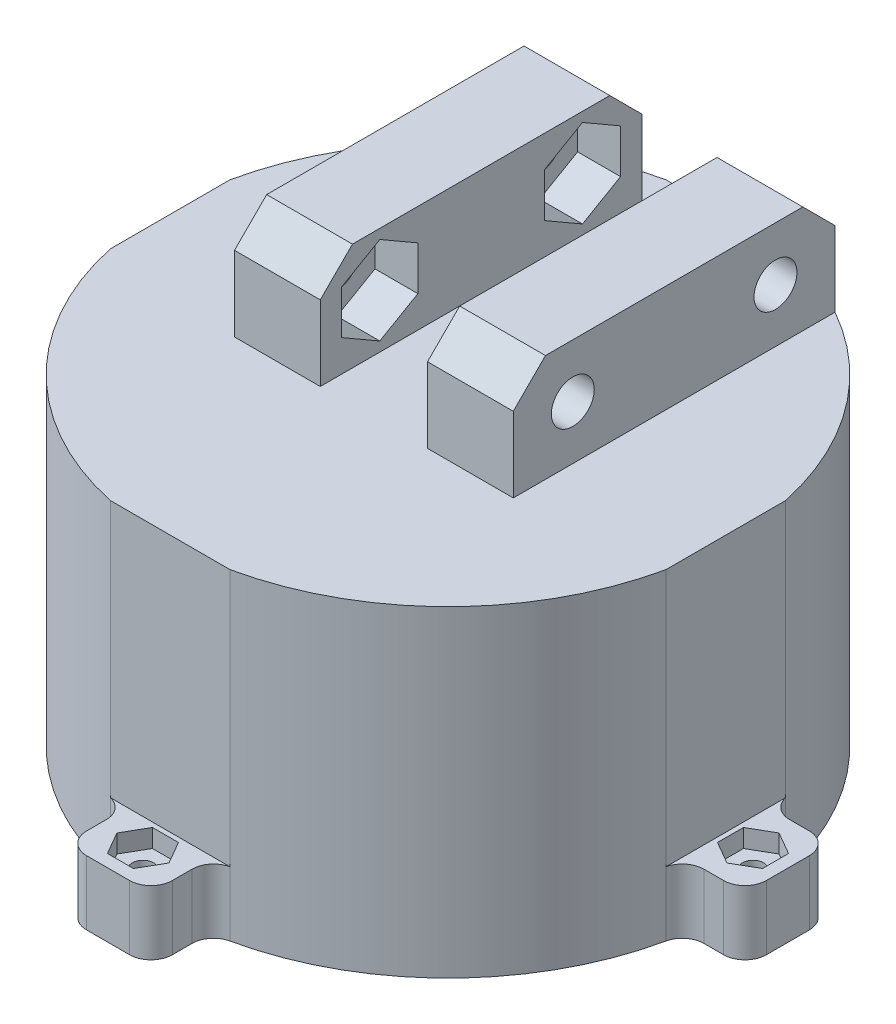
ISO-10303-21;
HEADER;
FILE_DESCRIPTION(('STEP AP214'),'2;1');
FILE_NAME('part.step','',(''),(''),'','','');
FILE_SCHEMA(('AUTOMOTIVE_DESIGN { 1 0 10303 214 1 1 1 1 }'));
ENDSEC;
DATA;
#1=APPLICATION_CONTEXT('core data for automotive mechanical design processes');
#2=APPLICATION_PROTOCOL_DEFINITION('international standard','automotive_design',2000,#1);
#3=PRODUCT_CONTEXT('',#1,'mechanical');
#4=PRODUCT('Part','Part','',(#3));
#5=PRODUCT_RELATED_PRODUCT_CATEGORY('part','',(#4));
#6=PRODUCT_DEFINITION_FORMATION('','',#4);
#7=PRODUCT_DEFINITION_CONTEXT('part definition',#1,'design');
#8=PRODUCT_DEFINITION('design','',#6,#7);
#9=PRODUCT_DEFINITION_SHAPE('','',#8);
#10=(LENGTH_UNIT() NAMED_UNIT(*) SI_UNIT(.MILLI.,.METRE.));
#11=(NAMED_UNIT(*) PLANE_ANGLE_UNIT() SI_UNIT($,.RADIAN.));
#12=(NAMED_UNIT(*) SI_UNIT($,.STERADIAN.) SOLID_ANGLE_UNIT());
#13=UNCERTAINTY_MEASURE_WITH_UNIT(LENGTH_MEASURE(1.E-05),#10,'distance_accuracy_value','');
#14=(GEOMETRIC_REPRESENTATION_CONTEXT(3) GLOBAL_UNCERTAINTY_ASSIGNED_CONTEXT((#13)) GLOBAL_UNIT_ASSIGNED_CONTEXT((#10,
#11,#12)) REPRESENTATION_CONTEXT('',''));
#15=CARTESIAN_POINT('',(0.,0.,0.));
#16=DIRECTION('',(0.,0.,1.));
#17=DIRECTION('',(1.,0.,0.));
#18=AXIS2_PLACEMENT_3D('',#15,#16,#17);
#19=CARTESIAN_POINT('',(5.,40.,-23.092206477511));
#20=DIRECTION('',(-1.,0.,0.));
#21=DIRECTION('',(0.,0.,1.));
#22=AXIS2_PLACEMENT_3D('',#19,#20,#21);
#23=PLANE('',#22);
#24=DIRECTION('',(0.,0.,-1.));
#25=VECTOR('',#24,1.);
#26=CARTESIAN_POINT('',(5.,40.,-23.092206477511));
#27=LINE('',#26,#25);
#28=CARTESIAN_POINT('',(5.,40.,3.90779352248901));
#29=VERTEX_POINT('',#28);
#30=CARTESIAN_POINT('',(5.,40.,-20.092206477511));
#31=VERTEX_POINT('',#30);
#32=EDGE_CURVE('E772',#29,#31,#27,.T.);
#33=ORIENTED_EDGE('',*,*,#32,.T.);
#34=DIRECTION('',(0.,0.707106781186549,0.707106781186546));
#35=VECTOR('',#34,1.);
#36=CARTESIAN_POINT('',(5.,38.5,-21.592206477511));
#37=LINE('',#36,#35);
#38=CARTESIAN_POINT('',(5.,37.,-23.092206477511));
#39=VERTEX_POINT('',#38);
#40=EDGE_CURVE('E51',#31,#39,#37,.F.);
#41=ORIENTED_EDGE('',*,*,#40,.T.);
#42=DIRECTION('',(0.,-1.,0.));
#43=VECTOR('',#42,1.);
#44=CARTESIAN_POINT('',(5.,40.,-23.092206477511));
#45=LINE('',#44,#43);
#46=CARTESIAN_POINT('',(5.,30.,-23.092206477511));
#47=VERTEX_POINT('',#46);
#48=EDGE_CURVE('E789',#39,#47,#45,.T.);
#49=ORIENTED_EDGE('',*,*,#48,.T.);
#50=DIRECTION('',(0.,0.,-1.));
#51=VECTOR('',#50,1.);
#52=CARTESIAN_POINT('',(5.,30.,-23.092206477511));
#53=LINE('',#52,#51);
#54=CARTESIAN_POINT('',(5.,30.,6.90779352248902));
#55=VERTEX_POINT('',#54);
#56=EDGE_CURVE('E781',#55,#47,#53,.T.);
#57=ORIENTED_EDGE('',*,*,#56,.F.);
#58=DIRECTION('',(0.,-1.,0.));
#59=VECTOR('',#58,1.);
#60=CARTESIAN_POINT('',(5.,40.,6.90779352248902));
#61=LINE('',#60,#59);
#62=CARTESIAN_POINT('',(5.,37.,6.90779352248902));
#63=VERTEX_POINT('',#62);
#64=EDGE_CURVE('E787',#63,#55,#61,.T.);
#65=ORIENTED_EDGE('',*,*,#64,.F.);
#66=DIRECTION('',(0.,-0.707106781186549,0.707106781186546));
#67=VECTOR('',#66,1.);
#68=CARTESIAN_POINT('',(5.,53.5,-9.59220647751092));
#69=LINE('',#68,#67);
#70=EDGE_CURVE('E58',#63,#29,#69,.F.);
#71=ORIENTED_EDGE('',*,*,#70,.T.);
#72=EDGE_LOOP('',(#33,#41,#49,#57,#65,#71));
#73=FACE_BOUND('',#72,.T.);
#74=DIRECTION('',(0.,-0.5,0.866025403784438));
#75=VECTOR('',#74,1.);
#76=CARTESIAN_POINT('',(5.,37.0495934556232,-13.992206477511));
#77=LINE('',#76,#75);
#78=CARTESIAN_POINT('',(5.,39.0991869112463,-17.542206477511));
#79=VERTEX_POINT('',#78);
#80=CARTESIAN_POINT('',(5.,37.0495934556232,-13.992206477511));
#81=VERTEX_POINT('',#80);
#82=EDGE_CURVE('E742',#79,#81,#77,.T.);
#83=ORIENTED_EDGE('',*,*,#82,.T.);
#84=DIRECTION('',(0.,-1.,0.));
#85=VECTOR('',#84,1.);
#86=CARTESIAN_POINT('',(5.,32.9504065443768,-13.992206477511));
#87=LINE('',#86,#85);
#88=CARTESIAN_POINT('',(5.,32.9504065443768,-13.992206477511));
#89=VERTEX_POINT('',#88);
#90=EDGE_CURVE('E739',#81,#89,#87,.T.);
#91=ORIENTED_EDGE('',*,*,#90,.T.);
#92=DIRECTION('',(0.,-0.499999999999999,-0.866025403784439));
#93=VECTOR('',#92,1.);
#94=CARTESIAN_POINT('',(5.,30.9008130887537,-17.542206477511));
#95=LINE('',#94,#93);
#96=CARTESIAN_POINT('',(5.,30.9008130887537,-17.542206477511));
#97=VERTEX_POINT('',#96);
#98=EDGE_CURVE('E728',#89,#97,#95,.T.);
#99=ORIENTED_EDGE('',*,*,#98,.T.);
#100=DIRECTION('',(0.,0.5,-0.866025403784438));
#101=VECTOR('',#100,1.);
#102=CARTESIAN_POINT('',(5.,32.9504065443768,-21.092206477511));
#103=LINE('',#102,#101);
#104=CARTESIAN_POINT('',(5.,32.9504065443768,-21.092206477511));
#105=VERTEX_POINT('',#104);
#106=EDGE_CURVE('E752',#97,#105,#103,.T.);
#107=ORIENTED_EDGE('',*,*,#106,.T.);
#108=DIRECTION('',(0.,1.,0.));
#109=VECTOR('',#108,1.);
#110=CARTESIAN_POINT('',(5.,37.0495934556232,-21.092206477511));
#111=LINE('',#110,#109);
#112=CARTESIAN_POINT('',(5.,37.0495934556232,-21.092206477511));
#113=VERTEX_POINT('',#112);
#114=EDGE_CURVE('E749',#105,#113,#111,.T.);
#115=ORIENTED_EDGE('',*,*,#114,.T.);
#116=DIRECTION('',(0.,0.499999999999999,0.866025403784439));
#117=VECTOR('',#116,1.);
#118=CARTESIAN_POINT('',(5.,39.0991869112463,-17.542206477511));
#119=LINE('',#118,#117);
#120=EDGE_CURVE('E746',#113,#79,#119,.T.);
#121=ORIENTED_EDGE('',*,*,#120,.T.);
#122=EDGE_LOOP('',(#83,#91,#99,#107,#115,#121));
#123=FACE_BOUND('',#122,.T.);
#124=DIRECTION('',(0.,1.,0.));
#125=VECTOR('',#124,1.);
#126=CARTESIAN_POINT('',(5.,32.9504065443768,-2.192206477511));
#127=LINE('',#126,#125);
#128=CARTESIAN_POINT('',(5.,32.9504065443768,-2.192206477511));
#129=VERTEX_POINT('',#128);
#130=CARTESIAN_POINT('',(5.,37.0495934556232,-2.192206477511));
#131=VERTEX_POINT('',#130);
#132=EDGE_CURVE('E703',#129,#131,#127,.T.);
#133=ORIENTED_EDGE('',*,*,#132,.T.);
#134=DIRECTION('',(0.,0.5,0.866025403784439));
#135=VECTOR('',#134,1.);
#136=CARTESIAN_POINT('',(5.,37.0495934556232,-2.192206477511));
#137=LINE('',#136,#135);
#138=CARTESIAN_POINT('',(5.,39.0991869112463,1.35779352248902));
#139=VERTEX_POINT('',#138);
#140=EDGE_CURVE('E682',#131,#139,#137,.T.);
#141=ORIENTED_EDGE('',*,*,#140,.T.);
#142=DIRECTION('',(0.,-0.499999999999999,0.866025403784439));
#143=VECTOR('',#142,1.);
#144=CARTESIAN_POINT('',(5.,39.0991869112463,1.35779352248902));
#145=LINE('',#144,#143);
#146=CARTESIAN_POINT('',(5.,37.0495934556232,4.90779352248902));
#147=VERTEX_POINT('',#146);
#148=EDGE_CURVE('E687',#139,#147,#145,.T.);
#149=ORIENTED_EDGE('',*,*,#148,.T.);
#150=DIRECTION('',(0.,-1.,0.));
#151=VECTOR('',#150,1.);
#152=CARTESIAN_POINT('',(5.,37.0495934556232,4.90779352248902));
#153=LINE('',#152,#151);
#154=CARTESIAN_POINT('',(5.,32.9504065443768,4.90779352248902));
#155=VERTEX_POINT('',#154);
#156=EDGE_CURVE('E690',#147,#155,#153,.T.);
#157=ORIENTED_EDGE('',*,*,#156,.T.);
#158=DIRECTION('',(0.,-0.500000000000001,-0.866025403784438));
#159=VECTOR('',#158,1.);
#160=CARTESIAN_POINT('',(5.,32.9504065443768,4.90779352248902));
#161=LINE('',#160,#159);
#162=CARTESIAN_POINT('',(5.,30.9008130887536,1.357793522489));
#163=VERTEX_POINT('',#162);
#164=EDGE_CURVE('E709',#155,#163,#161,.T.);
#165=ORIENTED_EDGE('',*,*,#164,.T.);
#166=DIRECTION('',(0.,0.5,-0.866025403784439));
#167=VECTOR('',#166,1.);
#168=CARTESIAN_POINT('',(5.,30.9008130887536,1.357793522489));
#169=LINE('',#168,#167);
#170=EDGE_CURVE('E706',#163,#129,#169,.T.);
#171=ORIENTED_EDGE('',*,*,#170,.T.);
#172=EDGE_LOOP('',(#133,#141,#149,#157,#165,#171));
#173=FACE_BOUND('',#172,.T.);
#174=ADVANCED_FACE('F42',(#73,#123,#173),#23,.T.);
#175=CARTESIAN_POINT('',(0.,30.,0.));
#176=DIRECTION('',(0.,-1.,0.));
#177=DIRECTION('',(0.,0.,-1.));
#178=AXIS2_PLACEMENT_3D('',#175,#176,#177);
#179=CYLINDRICAL_SURFACE('',#178,26.5);
#180=DIRECTION('',(0.,-1.,0.));
#181=VECTOR('',#180,1.);
#182=CARTESIAN_POINT('',(25.9060870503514,30.,5.57894736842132));
#183=LINE('',#182,#181);
#184=CARTESIAN_POINT('',(25.9060870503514,0.,5.57894736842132));
#185=VERTEX_POINT('',#184);
#186=CARTESIAN_POINT('',(25.9060870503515,6.,5.57894736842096));
#187=VERTEX_POINT('',#186);
#188=EDGE_CURVE('E1437',#185,#187,#183,.F.);
#189=ORIENTED_EDGE('',*,*,#188,.T.);
#190=DIRECTION('',(0.,1.,0.));
#191=VECTOR('',#190,1.);
#192=CARTESIAN_POINT('',(25.9060870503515,-5.20261643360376,5.57894736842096));
#193=LINE('',#192,#191);
#194=CARTESIAN_POINT('',(25.9060870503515,30.,5.57894736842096));
#195=VERTEX_POINT('',#194);
#196=EDGE_CURVE('E928',#187,#195,#193,.T.);
#197=ORIENTED_EDGE('',*,*,#196,.T.);
#198=CARTESIAN_POINT('',(0.,30.,0.));
#199=DIRECTION('',(0.,1.,0.));
#200=DIRECTION('',(0.,0.,1.));
#201=AXIS2_PLACEMENT_3D('',#198,#199,#200);
#202=CIRCLE('',#201,26.5);
#203=CARTESIAN_POINT('',(5.57894736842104,30.,25.9060870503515));
#204=VERTEX_POINT('',#203);
#205=EDGE_CURVE('E1296',#204,#195,#202,.T.);
#206=ORIENTED_EDGE('',*,*,#205,.F.);
#207=DIRECTION('',(0.,1.,0.));
#208=VECTOR('',#207,1.);
#209=CARTESIAN_POINT('',(5.57894736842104,-5.20261643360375,25.9060870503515));
#210=LINE('',#209,#208);
#211=CARTESIAN_POINT('',(5.57894736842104,6.,25.9060870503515));
#212=VERTEX_POINT('',#211);
#213=EDGE_CURVE('E963',#212,#204,#210,.T.);
#214=ORIENTED_EDGE('',*,*,#213,.F.);
#215=DIRECTION('',(0.,-1.,0.));
#216=VECTOR('',#215,1.);
#217=CARTESIAN_POINT('',(5.57894736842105,30.,25.9060870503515));
#218=LINE('',#217,#216);
#219=CARTESIAN_POINT('',(5.57894736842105,0.,25.9060870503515));
#220=VERTEX_POINT('',#219);
#221=EDGE_CURVE('E1313',#212,#220,#218,.T.);
#222=ORIENTED_EDGE('',*,*,#221,.T.);
#223=CARTESIAN_POINT('',(0.,0.,0.));
#224=DIRECTION('',(0.,1.,0.));
#225=DIRECTION('',(0.,0.,1.));
#226=AXIS2_PLACEMENT_3D('',#223,#224,#225);
#227=CIRCLE('',#226,26.5);
#228=EDGE_CURVE('E1302',#220,#185,#227,.T.);
#229=ORIENTED_EDGE('',*,*,#228,.T.);
#230=EDGE_LOOP('',(#189,#197,#206,#214,#222,#229));
#231=FACE_BOUND('',#230,.T.);
#232=ADVANCED_FACE('F1588',(#231),#179,.T.);
#233=CARTESIAN_POINT('',(25.9060870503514,30.,-5.57894736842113));
#234=VERTEX_POINT('',#233);
#235=CARTESIAN_POINT('',(13.,30.,-23.092206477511));
#236=VERTEX_POINT('',#235);
#237=EDGE_CURVE('E1300',#234,#236,#202,.T.);
#238=ORIENTED_EDGE('',*,*,#237,.F.);
#239=DIRECTION('',(0.,1.,0.));
#240=VECTOR('',#239,1.);
#241=CARTESIAN_POINT('',(25.9060870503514,-5.20261643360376,-5.57894736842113));
#242=LINE('',#241,#240);
#243=CARTESIAN_POINT('',(25.9060870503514,6.,-5.57894736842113));
#244=VERTEX_POINT('',#243);
#245=EDGE_CURVE('E931',#244,#234,#242,.T.);
#246=ORIENTED_EDGE('',*,*,#245,.F.);
#247=DIRECTION('',(0.,-1.,0.));
#248=VECTOR('',#247,1.);
#249=CARTESIAN_POINT('',(25.9060870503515,30.,-5.57894736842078));
#250=LINE('',#249,#248);
#251=CARTESIAN_POINT('',(25.9060870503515,0.,-5.57894736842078));
#252=VERTEX_POINT('',#251);
#253=EDGE_CURVE('E1434',#244,#252,#250,.T.);
#254=ORIENTED_EDGE('',*,*,#253,.T.);
#255=CARTESIAN_POINT('',(5.57894736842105,0.,-25.9060870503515));
#256=VERTEX_POINT('',#255);
#257=EDGE_CURVE('E1306',#252,#256,#227,.T.);
#258=ORIENTED_EDGE('',*,*,#257,.T.);
#259=DIRECTION('',(0.,-1.,0.));
#260=VECTOR('',#259,1.);
#261=CARTESIAN_POINT('',(5.57894736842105,30.,-25.9060870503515));
#262=LINE('',#261,#260);
#263=CARTESIAN_POINT('',(5.57894736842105,6.,-25.9060870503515));
#264=VERTEX_POINT('',#263);
#265=EDGE_CURVE('E1399',#256,#264,#262,.F.);
#266=ORIENTED_EDGE('',*,*,#265,.T.);
#267=DIRECTION('',(0.,1.,0.));
#268=VECTOR('',#267,1.);
#269=CARTESIAN_POINT('',(5.57894736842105,-5.20261643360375,-25.9060870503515));
#270=LINE('',#269,#268);
#271=CARTESIAN_POINT('',(5.57894736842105,30.,-25.9060870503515));
#272=VERTEX_POINT('',#271);
#273=EDGE_CURVE('E938',#264,#272,#270,.T.);
#274=ORIENTED_EDGE('',*,*,#273,.T.);
#275=EDGE_CURVE('E1301',#236,#272,#202,.T.);
#276=ORIENTED_EDGE('',*,*,#275,.F.);
#277=EDGE_LOOP('',(#238,#246,#254,#258,#266,#274,#276));
#278=FACE_BOUND('',#277,.T.);
#279=ADVANCED_FACE('F1596',(#278),#179,.T.);
#280=CARTESIAN_POINT('',(-5.57894736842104,30.,-25.9060870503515));
#281=VERTEX_POINT('',#280);
#282=CARTESIAN_POINT('',(-13.,30.,-23.092206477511));
#283=VERTEX_POINT('',#282);
#284=EDGE_CURVE('E1534',#281,#283,#202,.T.);
#285=ORIENTED_EDGE('',*,*,#284,.F.);
#286=DIRECTION('',(0.,1.,0.));
#287=VECTOR('',#286,1.);
#288=CARTESIAN_POINT('',(-5.57894736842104,-5.20261643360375,-25.9060870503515));
#289=LINE('',#288,#287);
#290=CARTESIAN_POINT('',(-5.57894736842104,6.,-25.9060870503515));
#291=VERTEX_POINT('',#290);
#292=EDGE_CURVE('E942',#291,#281,#289,.T.);
#293=ORIENTED_EDGE('',*,*,#292,.F.);
#294=DIRECTION('',(0.,-1.,0.));
#295=VECTOR('',#294,1.);
#296=CARTESIAN_POINT('',(-5.57894736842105,30.,-25.9060870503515));
#297=LINE('',#296,#295);
#298=CARTESIAN_POINT('',(-5.57894736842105,0.,-25.9060870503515));
#299=VERTEX_POINT('',#298);
#300=EDGE_CURVE('E1396',#291,#299,#297,.T.);
#301=ORIENTED_EDGE('',*,*,#300,.T.);
#302=CARTESIAN_POINT('',(-25.9060870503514,0.,-5.57894736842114));
#303=VERTEX_POINT('',#302);
#304=EDGE_CURVE('E1630',#299,#303,#227,.T.);
#305=ORIENTED_EDGE('',*,*,#304,.T.);
#306=DIRECTION('',(0.,-1.,0.));
#307=VECTOR('',#306,1.);
#308=CARTESIAN_POINT('',(-25.9060870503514,30.,-5.57894736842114));
#309=LINE('',#308,#307);
#310=CARTESIAN_POINT('',(-25.9060870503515,6.,-5.57894736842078));
#311=VERTEX_POINT('',#310);
#312=EDGE_CURVE('E1361',#303,#311,#309,.F.);
#313=ORIENTED_EDGE('',*,*,#312,.T.);
#314=DIRECTION('',(0.,1.,0.));
#315=VECTOR('',#314,1.);
#316=CARTESIAN_POINT('',(-25.9060870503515,-5.20261643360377,-5.57894736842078));
#317=LINE('',#316,#315);
#318=CARTESIAN_POINT('',(-25.9060870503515,30.,-5.57894736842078));
#319=VERTEX_POINT('',#318);
#320=EDGE_CURVE('E949',#311,#319,#317,.T.);
#321=ORIENTED_EDGE('',*,*,#320,.T.);
#322=EDGE_CURVE('E1535',#283,#319,#202,.T.);
#323=ORIENTED_EDGE('',*,*,#322,.F.);
#324=EDGE_LOOP('',(#285,#293,#301,#305,#313,#321,#323));
#325=FACE_BOUND('',#324,.T.);
#326=ADVANCED_FACE('F1671',(#325),#179,.T.);
#327=CARTESIAN_POINT('',(28.4463737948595,30.,2.97959949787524E-13));
#328=DIRECTION('',(0.,-1.,0.));
#329=DIRECTION('',(0.,0.,-1.));
#330=AXIS2_PLACEMENT_3D('',#327,#328,#329);
#331=CYLINDRICAL_SURFACE('',#330,1.);
#332=CARTESIAN_POINT('',(28.4463737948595,0.,2.97959949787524E-13));
#333=DIRECTION('',(0.,-1.,0.));
#334=DIRECTION('',(-1.,0.,0.));
#335=AXIS2_PLACEMENT_3D('',#332,#333,#334);
#336=CIRCLE('',#335,1.);
#337=CARTESIAN_POINT('',(27.4463737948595,0.,2.87485505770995E-13));
#338=VERTEX_POINT('',#337);
#339=EDGE_CURVE('E1165',#338,#338,#336,.T.);
#340=ORIENTED_EDGE('',*,*,#339,.T.);
#341=EDGE_LOOP('',(#340));
#342=FACE_BOUND('',#341,.T.);
#343=CARTESIAN_POINT('',(28.4463737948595,4.3,2.97959949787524E-13));
#344=DIRECTION('',(0.,1.,0.));
#345=DIRECTION('',(0.,0.,1.));
#346=AXIS2_PLACEMENT_3D('',#343,#344,#345);
#347=CIRCLE('',#346,1.);
#348=CARTESIAN_POINT('',(28.4463737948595,4.3,1.0000000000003));
#349=VERTEX_POINT('',#348);
#350=EDGE_CURVE('E1168',#349,#349,#347,.F.);
#351=ORIENTED_EDGE('',*,*,#350,.F.);
#352=EDGE_LOOP('',(#351));
#353=FACE_BOUND('',#352,.T.);
#354=ADVANCED_FACE('F1947',(#342,#353),#331,.F.);
#355=CARTESIAN_POINT('',(0.,30.,-28.4463737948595));
#356=DIRECTION('',(0.,-1.,0.));
#357=DIRECTION('',(0.,0.,-1.));
#358=AXIS2_PLACEMENT_3D('',#355,#356,#357);
#359=CYLINDRICAL_SURFACE('',#358,1.);
#360=CARTESIAN_POINT('',(0.,0.,-28.4463737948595));
#361=DIRECTION('',(0.,-1.,0.));
#362=DIRECTION('',(0.,0.,1.));
#363=AXIS2_PLACEMENT_3D('',#360,#361,#362);
#364=CIRCLE('',#363,1.);
#365=CARTESIAN_POINT('',(0.,0.,-27.4463737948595));
#366=VERTEX_POINT('',#365);
#367=EDGE_CURVE('E1162',#366,#366,#364,.T.);
#368=ORIENTED_EDGE('',*,*,#367,.T.);
#369=EDGE_LOOP('',(#368));
#370=FACE_BOUND('',#369,.T.);
#371=CARTESIAN_POINT('',(0.,4.3,-28.4463737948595));
#372=DIRECTION('',(0.,1.,0.));
#373=DIRECTION('',(0.,0.,1.));
#374=AXIS2_PLACEMENT_3D('',#371,#372,#373);
#375=CIRCLE('',#374,1.);
#376=CARTESIAN_POINT('',(0.,4.3,-27.4463737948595));
#377=VERTEX_POINT('',#376);
#378=EDGE_CURVE('E1349',#377,#377,#375,.F.);
#379=ORIENTED_EDGE('',*,*,#378,.F.);
#380=EDGE_LOOP('',(#379));
#381=FACE_BOUND('',#380,.T.);
#382=ADVANCED_FACE('F1943',(#370,#381),#359,.F.);
#383=CARTESIAN_POINT('',(-28.4463737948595,30.,0.));
#384=DIRECTION('',(0.,-1.,0.));
#385=DIRECTION('',(0.,0.,-1.));
#386=AXIS2_PLACEMENT_3D('',#383,#384,#385);
#387=CYLINDRICAL_SURFACE('',#386,1.);
#388=CARTESIAN_POINT('',(-28.4463737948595,0.,0.));
#389=DIRECTION('',(0.,-1.,0.));
#390=DIRECTION('',(1.,0.,0.));
#391=AXIS2_PLACEMENT_3D('',#388,#389,#390);
#392=CIRCLE('',#391,1.);
#393=CARTESIAN_POINT('',(-27.4463737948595,0.,0.));
#394=VERTEX_POINT('',#393);
#395=EDGE_CURVE('E1158',#394,#394,#392,.T.);
#396=ORIENTED_EDGE('',*,*,#395,.T.);
#397=EDGE_LOOP('',(#396));
#398=FACE_BOUND('',#397,.T.);
#399=CARTESIAN_POINT('',(-28.4463737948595,4.3,0.));
#400=DIRECTION('',(0.,1.,0.));
#401=DIRECTION('',(0.,0.,1.));
#402=AXIS2_PLACEMENT_3D('',#399,#400,#401);
#403=CIRCLE('',#402,1.);
#404=CARTESIAN_POINT('',(-28.4463737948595,4.3,0.999999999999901));
#405=VERTEX_POINT('',#404);
#406=EDGE_CURVE('E1045',#405,#405,#403,.F.);
#407=ORIENTED_EDGE('',*,*,#406,.F.);
#408=EDGE_LOOP('',(#407));
#409=FACE_BOUND('',#408,.T.);
#410=ADVANCED_FACE('F1939',(#398,#409),#387,.F.);
#411=CARTESIAN_POINT('',(0.,30.,28.4463737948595));
#412=DIRECTION('',(0.,-1.,0.));
#413=DIRECTION('',(0.,0.,-1.));
#414=AXIS2_PLACEMENT_3D('',#411,#412,#413);
#415=CYLINDRICAL_SURFACE('',#414,1.);
#416=CARTESIAN_POINT('',(0.,0.,28.4463737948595));
#417=DIRECTION('',(0.,-1.,0.));
#418=DIRECTION('',(0.,0.,-1.));
#419=AXIS2_PLACEMENT_3D('',#416,#417,#418);
#420=CIRCLE('',#419,1.);
#421=CARTESIAN_POINT('',(0.,0.,27.4463737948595));
#422=VERTEX_POINT('',#421);
#423=EDGE_CURVE('E1274',#422,#422,#420,.T.);
#424=ORIENTED_EDGE('',*,*,#423,.T.);
#425=EDGE_LOOP('',(#424));
#426=FACE_BOUND('',#425,.T.);
#427=CARTESIAN_POINT('',(0.,4.3,28.4463737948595));
#428=DIRECTION('',(0.,1.,0.));
#429=DIRECTION('',(0.,0.,1.));
#430=AXIS2_PLACEMENT_3D('',#427,#428,#429);
#431=CIRCLE('',#430,1.);
#432=CARTESIAN_POINT('',(0.,4.3,29.4463737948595));
#433=VERTEX_POINT('',#432);
#434=EDGE_CURVE('E1261',#433,#433,#431,.F.);
#435=ORIENTED_EDGE('',*,*,#434,.F.);
#436=EDGE_LOOP('',(#435));
#437=FACE_BOUND('',#436,.T.);
#438=ADVANCED_FACE('F1942',(#426,#437),#415,.F.);
#439=CARTESIAN_POINT('',(-25.9060870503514,30.,5.57894736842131));
#440=VERTEX_POINT('',#439);
#441=CARTESIAN_POINT('',(-5.57894736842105,30.,25.9060870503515));
#442=VERTEX_POINT('',#441);
#443=EDGE_CURVE('E1305',#440,#442,#202,.T.);
#444=ORIENTED_EDGE('',*,*,#443,.F.);
#445=DIRECTION('',(0.,1.,0.));
#446=VECTOR('',#445,1.);
#447=CARTESIAN_POINT('',(-25.9060870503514,-5.20261643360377,5.57894736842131));
#448=LINE('',#447,#446);
#449=CARTESIAN_POINT('',(-25.9060870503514,6.,5.57894736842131));
#450=VERTEX_POINT('',#449);
#451=EDGE_CURVE('E952',#450,#440,#448,.T.);
#452=ORIENTED_EDGE('',*,*,#451,.F.);
#453=DIRECTION('',(0.,-1.,0.));
#454=VECTOR('',#453,1.);
#455=CARTESIAN_POINT('',(-25.9060870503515,30.,5.57894736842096));
#456=LINE('',#455,#454);
#457=CARTESIAN_POINT('',(-25.9060870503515,0.,5.57894736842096));
#458=VERTEX_POINT('',#457);
#459=EDGE_CURVE('E1358',#450,#458,#456,.T.);
#460=ORIENTED_EDGE('',*,*,#459,.T.);
#461=CARTESIAN_POINT('',(-5.57894736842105,0.,25.9060870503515));
#462=VERTEX_POINT('',#461);
#463=EDGE_CURVE('E1288',#458,#462,#227,.T.);
#464=ORIENTED_EDGE('',*,*,#463,.T.);
#465=DIRECTION('',(0.,-1.,0.));
#466=VECTOR('',#465,1.);
#467=CARTESIAN_POINT('',(-5.57894736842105,30.,25.9060870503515));
#468=LINE('',#467,#466);
#469=CARTESIAN_POINT('',(-5.57894736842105,6.,25.9060870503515));
#470=VERTEX_POINT('',#469);
#471=EDGE_CURVE('E1316',#462,#470,#468,.F.);
#472=ORIENTED_EDGE('',*,*,#471,.T.);
#473=DIRECTION('',(0.,1.,0.));
#474=VECTOR('',#473,1.);
#475=CARTESIAN_POINT('',(-5.57894736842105,-5.20261643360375,25.9060870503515));
#476=LINE('',#475,#474);
#477=EDGE_CURVE('E960',#470,#442,#476,.T.);
#478=ORIENTED_EDGE('',*,*,#477,.T.);
#479=EDGE_LOOP('',(#444,#452,#460,#464,#472,#478));
#480=FACE_BOUND('',#479,.T.);
#481=ADVANCED_FACE('F1550',(#480),#179,.T.);
#482=CARTESIAN_POINT('',(0.,30.,0.));
#483=DIRECTION('',(0.,1.,0.));
#484=DIRECTION('',(0.,0.,1.));
#485=AXIS2_PLACEMENT_3D('',#482,#483,#484);
#486=PLANE('',#485);
#487=DIRECTION('',(0.,0.,1.));
#488=VECTOR('',#487,1.);
#489=CARTESIAN_POINT('',(13.,30.,-23.092206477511));
#490=LINE('',#489,#488);
#491=CARTESIAN_POINT('',(13.,30.,6.90779352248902));
#492=VERTEX_POINT('',#491);
#493=EDGE_CURVE('E716',#236,#492,#490,.T.);
#494=ORIENTED_EDGE('',*,*,#493,.T.);
#495=DIRECTION('',(-1.,0.,0.));
#496=VECTOR('',#495,1.);
#497=CARTESIAN_POINT('',(13.,30.,6.90779352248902));
#498=LINE('',#497,#496);
#499=EDGE_CURVE('E773',#492,#55,#498,.T.);
#500=ORIENTED_EDGE('',*,*,#499,.T.);
#501=ORIENTED_EDGE('',*,*,#56,.T.);
#502=DIRECTION('',(1.,0.,0.));
#503=VECTOR('',#502,1.);
#504=CARTESIAN_POINT('',(13.,30.,-23.092206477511));
#505=LINE('',#504,#503);
#506=EDGE_CURVE('E778',#47,#236,#505,.T.);
#507=ORIENTED_EDGE('',*,*,#506,.T.);
#508=ORIENTED_EDGE('',*,*,#275,.T.);
#509=DIRECTION('',(1.,0.,0.));
#510=VECTOR('',#509,1.);
#511=CARTESIAN_POINT('',(-5.57894736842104,30.,-25.9060870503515));
#512=LINE('',#511,#510);
#513=EDGE_CURVE('E939',#281,#272,#512,.T.);
#514=ORIENTED_EDGE('',*,*,#513,.F.);
#515=ORIENTED_EDGE('',*,*,#284,.T.);
#516=DIRECTION('',(-1.,0.,0.));
#517=VECTOR('',#516,1.);
#518=CARTESIAN_POINT('',(-13.,30.,-23.092206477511));
#519=LINE('',#518,#517);
#520=CARTESIAN_POINT('',(-5.,30.,-23.092206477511));
#521=VERTEX_POINT('',#520);
#522=EDGE_CURVE('E902',#521,#283,#519,.T.);
#523=ORIENTED_EDGE('',*,*,#522,.F.);
#524=DIRECTION('',(0.,0.,-1.));
#525=VECTOR('',#524,1.);
#526=CARTESIAN_POINT('',(-5.,30.,-23.092206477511));
#527=LINE('',#526,#525);
#528=CARTESIAN_POINT('',(-5.,30.,6.90779352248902));
#529=VERTEX_POINT('',#528);
#530=EDGE_CURVE('E911',#529,#521,#527,.T.);
#531=ORIENTED_EDGE('',*,*,#530,.F.);
#532=DIRECTION('',(1.,0.,0.));
#533=VECTOR('',#532,1.);
#534=CARTESIAN_POINT('',(-13.,30.,6.90779352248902));
#535=LINE('',#534,#533);
#536=CARTESIAN_POINT('',(-13.,30.,6.90779352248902));
#537=VERTEX_POINT('',#536);
#538=EDGE_CURVE('E908',#537,#529,#535,.T.);
#539=ORIENTED_EDGE('',*,*,#538,.F.);
#540=DIRECTION('',(0.,0.,1.));
#541=VECTOR('',#540,1.);
#542=CARTESIAN_POINT('',(-13.,30.,-23.092206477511));
#543=LINE('',#542,#541);
#544=EDGE_CURVE('E839',#283,#537,#543,.T.);
#545=ORIENTED_EDGE('',*,*,#544,.F.);
#546=ORIENTED_EDGE('',*,*,#322,.T.);
#547=DIRECTION('',(0.,0.,-1.));
#548=VECTOR('',#547,1.);
#549=CARTESIAN_POINT('',(-25.9060870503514,30.,5.57894736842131));
#550=LINE('',#549,#548);
#551=EDGE_CURVE('E923',#440,#319,#550,.T.);
#552=ORIENTED_EDGE('',*,*,#551,.F.);
#553=ORIENTED_EDGE('',*,*,#443,.T.);
#554=DIRECTION('',(-1.,0.,0.));
#555=VECTOR('',#554,1.);
#556=CARTESIAN_POINT('',(5.57894736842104,30.,25.9060870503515));
#557=LINE('',#556,#555);
#558=EDGE_CURVE('E927',#204,#442,#557,.T.);
#559=ORIENTED_EDGE('',*,*,#558,.F.);
#560=ORIENTED_EDGE('',*,*,#205,.T.);
#561=DIRECTION('',(0.,0.,1.));
#562=VECTOR('',#561,1.);
#563=CARTESIAN_POINT('',(25.9060870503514,30.,-5.57894736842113));
#564=LINE('',#563,#562);
#565=EDGE_CURVE('E929',#234,#195,#564,.T.);
#566=ORIENTED_EDGE('',*,*,#565,.F.);
#567=ORIENTED_EDGE('',*,*,#237,.T.);
#568=EDGE_LOOP('',(#494,#500,#501,#507,#508,#514,#515,#523,#531,#539,#545,#546,#552,#553,#559,
#560,#566,#567));
#569=FACE_BOUND('',#568,.T.);
#570=ADVANCED_FACE('F1527',(#569),#486,.T.);
#571=CARTESIAN_POINT('',(0.,0.,0.));
#572=DIRECTION('',(0.,1.,0.));
#573=DIRECTION('',(0.,0.,1.));
#574=AXIS2_PLACEMENT_3D('',#571,#572,#573);
#575=PLANE('',#574);
#576=CARTESIAN_POINT('',(19.,0.,0.));
#577=DIRECTION('',(0.,-1.,0.));
#578=DIRECTION('',(0.,0.,1.));
#579=AXIS2_PLACEMENT_3D('',#576,#577,#578);
#580=CIRCLE('',#579,4.5);
#581=CARTESIAN_POINT('',(19.,0.,4.5));
#582=VERTEX_POINT('',#581);
#583=EDGE_CURVE('E971',#582,#582,#580,.T.);
#584=ORIENTED_EDGE('',*,*,#583,.F.);
#585=EDGE_LOOP('',(#584));
#586=FACE_BOUND('',#585,.T.);
#587=DIRECTION('',(1.,0.,0.));
#588=VECTOR('',#587,1.);
#589=CARTESIAN_POINT('',(18.5663430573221,0.,6.1));
#590=LINE('',#589,#588);
#591=CARTESIAN_POINT('',(12.5663430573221,0.,6.1));
#592=VERTEX_POINT('',#591);
#593=CARTESIAN_POINT('',(18.5663430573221,0.,6.1));
#594=VERTEX_POINT('',#593);
#595=EDGE_CURVE('E990',#592,#594,#590,.T.);
#596=ORIENTED_EDGE('',*,*,#595,.F.);
#597=DIRECTION('',(0.,0.,-1.));
#598=VECTOR('',#597,1.);
#599=CARTESIAN_POINT('',(12.5663430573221,0.,17.1));
#600=LINE('',#599,#598);
#601=CARTESIAN_POINT('',(12.5663430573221,0.,17.1));
#602=VERTEX_POINT('',#601);
#603=EDGE_CURVE('E959',#602,#592,#600,.T.);
#604=ORIENTED_EDGE('',*,*,#603,.F.);
#605=DIRECTION('',(-1.,0.,0.));
#606=VECTOR('',#605,1.);
#607=CARTESIAN_POINT('',(18.5663430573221,0.,17.1));
#608=LINE('',#607,#606);
#609=CARTESIAN_POINT('',(18.5663430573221,0.,17.1));
#610=VERTEX_POINT('',#609);
#611=EDGE_CURVE('E979',#610,#602,#608,.T.);
#612=ORIENTED_EDGE('',*,*,#611,.F.);
#613=DIRECTION('',(0.,0.,1.));
#614=VECTOR('',#613,1.);
#615=CARTESIAN_POINT('',(18.5663430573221,0.,17.1));
#616=LINE('',#615,#614);
#617=EDGE_CURVE('E993',#594,#610,#616,.T.);
#618=ORIENTED_EDGE('',*,*,#617,.F.);
#619=EDGE_LOOP('',(#596,#604,#612,#618));
#620=FACE_BOUND('',#619,.T.);
#621=ORIENTED_EDGE('',*,*,#395,.F.);
#622=EDGE_LOOP('',(#621));
#623=FACE_BOUND('',#622,.T.);
#624=ORIENTED_EDGE('',*,*,#367,.F.);
#625=EDGE_LOOP('',(#624));
#626=FACE_BOUND('',#625,.T.);
#627=ORIENTED_EDGE('',*,*,#339,.F.);
#628=EDGE_LOOP('',(#627));
#629=FACE_BOUND('',#628,.T.);
#630=ORIENTED_EDGE('',*,*,#423,.F.);
#631=EDGE_LOOP('',(#630));
#632=FACE_BOUND('',#631,.T.);
#633=DIRECTION('',(0.,0.,1.));
#634=VECTOR('',#633,1.);
#635=CARTESIAN_POINT('',(31.6963737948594,0.,4.00000000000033));
#636=LINE('',#635,#634);
#637=CARTESIAN_POINT('',(31.6963737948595,0.,-1.99999999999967));
#638=VERTEX_POINT('',#637);
#639=CARTESIAN_POINT('',(31.6963737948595,0.,2.00000000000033));
#640=VERTEX_POINT('',#639);
#641=EDGE_CURVE('E1182',#638,#640,#636,.T.);
#642=ORIENTED_EDGE('',*,*,#641,.T.);
#643=CARTESIAN_POINT('',(29.6963737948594,0.,2.00000000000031));
#644=DIRECTION('',(0.,1.,0.));
#645=DIRECTION('',(0.,0.,1.));
#646=AXIS2_PLACEMENT_3D('',#643,#644,#645);
#647=CIRCLE('',#646,2.);
#648=CARTESIAN_POINT('',(29.6963737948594,0.,4.00000000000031));
#649=VERTEX_POINT('',#648);
#650=EDGE_CURVE('E1447',#640,#649,#647,.F.);
#651=ORIENTED_EDGE('',*,*,#650,.T.);
#652=DIRECTION('',(-1.,0.,0.));
#653=VECTOR('',#652,1.);
#654=CARTESIAN_POINT('',(26.1963737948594,0.,4.00000000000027));
#655=LINE('',#654,#653);
#656=CARTESIAN_POINT('',(27.86126343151,0.,4.00000000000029));
#657=VERTEX_POINT('',#656);
#658=EDGE_CURVE('E1173',#649,#657,#655,.T.);
#659=ORIENTED_EDGE('',*,*,#658,.T.);
#660=CARTESIAN_POINT('',(27.86126343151,0.,6.00000000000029));
#661=DIRECTION('',(0.,1.,0.));
#662=DIRECTION('',(0.,0.,1.));
#663=AXIS2_PLACEMENT_3D('',#660,#661,#662);
#664=CIRCLE('',#663,2.);
#665=EDGE_CURVE('E1458',#657,#185,#664,.T.);
#666=ORIENTED_EDGE('',*,*,#665,.T.);
#667=ORIENTED_EDGE('',*,*,#228,.F.);
#668=CARTESIAN_POINT('',(6.,0.,27.8612634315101));
#669=DIRECTION('',(0.,1.,0.));
#670=DIRECTION('',(0.,0.,1.));
#671=AXIS2_PLACEMENT_3D('',#668,#669,#670);
#672=CIRCLE('',#671,2.);
#673=CARTESIAN_POINT('',(4.,0.,27.8612634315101));
#674=VERTEX_POINT('',#673);
#675=EDGE_CURVE('E1342',#220,#674,#672,.T.);
#676=ORIENTED_EDGE('',*,*,#675,.T.);
#677=DIRECTION('',(0.,0.,1.));
#678=VECTOR('',#677,1.);
#679=CARTESIAN_POINT('',(4.,0.,26.1963737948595));
#680=LINE('',#679,#678);
#681=CARTESIAN_POINT('',(4.,0.,29.6963737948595));
#682=VERTEX_POINT('',#681);
#683=EDGE_CURVE('E1277',#674,#682,#680,.T.);
#684=ORIENTED_EDGE('',*,*,#683,.T.);
#685=CARTESIAN_POINT('',(2.,0.,29.6963737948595));
#686=DIRECTION('',(0.,1.,0.));
#687=DIRECTION('',(0.,0.,1.));
#688=AXIS2_PLACEMENT_3D('',#685,#686,#687);
#689=CIRCLE('',#688,2.);
#690=CARTESIAN_POINT('',(2.,0.,31.6963737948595));
#691=VERTEX_POINT('',#690);
#692=EDGE_CURVE('E1324',#682,#691,#689,.F.);
#693=ORIENTED_EDGE('',*,*,#692,.T.);
#694=DIRECTION('',(-1.,0.,0.));
#695=VECTOR('',#694,1.);
#696=CARTESIAN_POINT('',(-4.,0.,31.6963737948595));
#697=LINE('',#696,#695);
#698=CARTESIAN_POINT('',(-2.,0.,31.6963737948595));
#699=VERTEX_POINT('',#698);
#700=EDGE_CURVE('E1291',#691,#699,#697,.T.);
#701=ORIENTED_EDGE('',*,*,#700,.T.);
#702=CARTESIAN_POINT('',(-2.,0.,29.6963737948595));
#703=DIRECTION('',(0.,1.,0.));
#704=DIRECTION('',(0.,0.,1.));
#705=AXIS2_PLACEMENT_3D('',#702,#703,#704);
#706=CIRCLE('',#705,2.);
#707=CARTESIAN_POINT('',(-4.,0.,29.6963737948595));
#708=VERTEX_POINT('',#707);
#709=EDGE_CURVE('E1326',#699,#708,#706,.F.);
#710=ORIENTED_EDGE('',*,*,#709,.T.);
#711=DIRECTION('',(0.,0.,-1.));
#712=VECTOR('',#711,1.);
#713=CARTESIAN_POINT('',(-4.,0.,26.1963737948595));
#714=LINE('',#713,#712);
#715=CARTESIAN_POINT('',(-4.,0.,27.8612634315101));
#716=VERTEX_POINT('',#715);
#717=EDGE_CURVE('E1282',#708,#716,#714,.T.);
#718=ORIENTED_EDGE('',*,*,#717,.T.);
#719=CARTESIAN_POINT('',(-6.,0.,27.8612634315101));
#720=DIRECTION('',(0.,1.,0.));
#721=DIRECTION('',(0.,0.,1.));
#722=AXIS2_PLACEMENT_3D('',#719,#720,#721);
#723=CIRCLE('',#722,2.);
#724=EDGE_CURVE('E1337',#716,#462,#723,.T.);
#725=ORIENTED_EDGE('',*,*,#724,.T.);
#726=ORIENTED_EDGE('',*,*,#463,.F.);
#727=CARTESIAN_POINT('',(-27.8612634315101,0.,5.9999999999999));
#728=DIRECTION('',(0.,1.,0.));
#729=DIRECTION('',(0.,0.,1.));
#730=AXIS2_PLACEMENT_3D('',#727,#728,#729);
#731=CIRCLE('',#730,2.);
#732=CARTESIAN_POINT('',(-27.8612634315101,0.,3.9999999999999));
#733=VERTEX_POINT('',#732);
#734=EDGE_CURVE('E1387',#458,#733,#731,.T.);
#735=ORIENTED_EDGE('',*,*,#734,.T.);
#736=DIRECTION('',(-1.,0.,0.));
#737=VECTOR('',#736,1.);
#738=CARTESIAN_POINT('',(-26.1963737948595,0.,3.99999999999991));
#739=LINE('',#738,#737);
#740=CARTESIAN_POINT('',(-29.6963737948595,0.,3.9999999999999));
#741=VERTEX_POINT('',#740);
#742=EDGE_CURVE('E1197',#733,#741,#739,.T.);
#743=ORIENTED_EDGE('',*,*,#742,.T.);
#744=CARTESIAN_POINT('',(-29.6963737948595,0.,1.9999999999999));
#745=DIRECTION('',(0.,1.,0.));
#746=DIRECTION('',(0.,0.,1.));
#747=AXIS2_PLACEMENT_3D('',#744,#745,#746);
#748=CIRCLE('',#747,2.);
#749=CARTESIAN_POINT('',(-31.6963737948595,0.,1.99999999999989));
#750=VERTEX_POINT('',#749);
#751=EDGE_CURVE('E1369',#741,#750,#748,.F.);
#752=ORIENTED_EDGE('',*,*,#751,.T.);
#753=DIRECTION('',(0.,0.,-1.));
#754=VECTOR('',#753,1.);
#755=CARTESIAN_POINT('',(-31.6963737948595,0.,-4.00000000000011));
#756=LINE('',#755,#754);
#757=CARTESIAN_POINT('',(-31.6963737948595,0.,-2.00000000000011));
#758=VERTEX_POINT('',#757);
#759=EDGE_CURVE('E1218',#750,#758,#756,.T.);
#760=ORIENTED_EDGE('',*,*,#759,.T.);
#761=CARTESIAN_POINT('',(-29.6963737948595,0.,-2.0000000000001));
#762=DIRECTION('',(0.,1.,0.));
#763=DIRECTION('',(0.,0.,1.));
#764=AXIS2_PLACEMENT_3D('',#761,#762,#763);
#765=CIRCLE('',#764,2.);
#766=CARTESIAN_POINT('',(-29.6963737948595,0.,-4.0000000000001));
#767=VERTEX_POINT('',#766);
#768=EDGE_CURVE('E1371',#758,#767,#765,.F.);
#769=ORIENTED_EDGE('',*,*,#768,.T.);
#770=DIRECTION('',(1.,0.,0.));
#771=VECTOR('',#770,1.);
#772=CARTESIAN_POINT('',(-26.1963737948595,0.,-4.00000000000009));
#773=LINE('',#772,#771);
#774=CARTESIAN_POINT('',(-27.8612634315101,0.,-4.0000000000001));
#775=VERTEX_POINT('',#774);
#776=EDGE_CURVE('E1209',#767,#775,#773,.T.);
#777=ORIENTED_EDGE('',*,*,#776,.T.);
#778=CARTESIAN_POINT('',(-27.86126343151,0.,-6.0000000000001));
#779=DIRECTION('',(0.,1.,0.));
#780=DIRECTION('',(0.,0.,1.));
#781=AXIS2_PLACEMENT_3D('',#778,#779,#780);
#782=CIRCLE('',#781,2.);
#783=EDGE_CURVE('E1382',#775,#303,#782,.T.);
#784=ORIENTED_EDGE('',*,*,#783,.T.);
#785=ORIENTED_EDGE('',*,*,#304,.F.);
#786=CARTESIAN_POINT('',(-6.,0.,-27.8612634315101));
#787=DIRECTION('',(0.,1.,0.));
#788=DIRECTION('',(0.,0.,1.));
#789=AXIS2_PLACEMENT_3D('',#786,#787,#788);
#790=CIRCLE('',#789,2.);
#791=CARTESIAN_POINT('',(-4.,0.,-27.8612634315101));
#792=VERTEX_POINT('',#791);
#793=EDGE_CURVE('E1425',#299,#792,#790,.T.);
#794=ORIENTED_EDGE('',*,*,#793,.T.);
#795=DIRECTION('',(0.,0.,-1.));
#796=VECTOR('',#795,1.);
#797=CARTESIAN_POINT('',(-4.,0.,-26.1963737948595));
#798=LINE('',#797,#796);
#799=CARTESIAN_POINT('',(-4.,0.,-29.6963737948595));
#800=VERTEX_POINT('',#799);
#801=EDGE_CURVE('E1179',#792,#800,#798,.T.);
#802=ORIENTED_EDGE('',*,*,#801,.T.);
#803=CARTESIAN_POINT('',(-2.,0.,-29.6963737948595));
#804=DIRECTION('',(0.,1.,0.));
#805=DIRECTION('',(0.,0.,1.));
#806=AXIS2_PLACEMENT_3D('',#803,#804,#805);
#807=CIRCLE('',#806,2.);
#808=CARTESIAN_POINT('',(-2.,0.,-31.6963737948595));
#809=VERTEX_POINT('',#808);
#810=EDGE_CURVE('E1407',#800,#809,#807,.F.);
#811=ORIENTED_EDGE('',*,*,#810,.T.);
#812=DIRECTION('',(1.,0.,0.));
#813=VECTOR('',#812,1.);
#814=CARTESIAN_POINT('',(4.,0.,-31.6963737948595));
#815=LINE('',#814,#813);
#816=CARTESIAN_POINT('',(2.,0.,-31.6963737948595));
#817=VERTEX_POINT('',#816);
#818=EDGE_CURVE('E1200',#809,#817,#815,.T.);
#819=ORIENTED_EDGE('',*,*,#818,.T.);
#820=CARTESIAN_POINT('',(2.,0.,-29.6963737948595));
#821=DIRECTION('',(0.,1.,0.));
#822=DIRECTION('',(0.,0.,1.));
#823=AXIS2_PLACEMENT_3D('',#820,#821,#822);
#824=CIRCLE('',#823,2.);
#825=CARTESIAN_POINT('',(4.,0.,-29.6963737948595));
#826=VERTEX_POINT('',#825);
#827=EDGE_CURVE('E1409',#817,#826,#824,.F.);
#828=ORIENTED_EDGE('',*,*,#827,.T.);
#829=DIRECTION('',(0.,0.,1.));
#830=VECTOR('',#829,1.);
#831=CARTESIAN_POINT('',(4.,0.,-26.1963737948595));
#832=LINE('',#831,#830);
#833=CARTESIAN_POINT('',(4.,0.,-27.8612634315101));
#834=VERTEX_POINT('',#833);
#835=EDGE_CURVE('E1191',#826,#834,#832,.T.);
#836=ORIENTED_EDGE('',*,*,#835,.T.);
#837=CARTESIAN_POINT('',(6.,0.,-27.8612634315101));
#838=DIRECTION('',(0.,1.,0.));
#839=DIRECTION('',(0.,0.,1.));
#840=AXIS2_PLACEMENT_3D('',#837,#838,#839);
#841=CIRCLE('',#840,2.);
#842=EDGE_CURVE('E1420',#834,#256,#841,.T.);
#843=ORIENTED_EDGE('',*,*,#842,.T.);
#844=ORIENTED_EDGE('',*,*,#257,.F.);
#845=CARTESIAN_POINT('',(27.8612634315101,0.,-5.99999999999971));
#846=DIRECTION('',(0.,1.,0.));
#847=DIRECTION('',(0.,0.,1.));
#848=AXIS2_PLACEMENT_3D('',#845,#846,#847);
#849=CIRCLE('',#848,2.);
#850=CARTESIAN_POINT('',(27.8612634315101,0.,-3.99999999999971));
#851=VERTEX_POINT('',#850);
#852=EDGE_CURVE('E1462',#252,#851,#849,.T.);
#853=ORIENTED_EDGE('',*,*,#852,.T.);
#854=DIRECTION('',(1.,0.,0.));
#855=VECTOR('',#854,1.);
#856=CARTESIAN_POINT('',(26.1963737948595,0.,-3.99999999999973));
#857=LINE('',#856,#855);
#858=CARTESIAN_POINT('',(29.6963737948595,0.,-3.99999999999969));
#859=VERTEX_POINT('',#858);
#860=EDGE_CURVE('E1161',#851,#859,#857,.T.);
#861=ORIENTED_EDGE('',*,*,#860,.T.);
#862=CARTESIAN_POINT('',(29.6963737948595,0.,-1.99999999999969));
#863=DIRECTION('',(0.,1.,0.));
#864=DIRECTION('',(0.,0.,1.));
#865=AXIS2_PLACEMENT_3D('',#862,#863,#864);
#866=CIRCLE('',#865,2.);
#867=EDGE_CURVE('E1445',#859,#638,#866,.F.);
#868=ORIENTED_EDGE('',*,*,#867,.T.);
#869=EDGE_LOOP('',(#642,#651,#659,#666,#667,#676,#684,#693,#701,#710,#718,#725,#726,#735,#743,
#752,#760,#769,#777,#784,#785,#794,#802,#811,#819,#828,#836,#843,#844,#853,#861,#868));
#870=FACE_BOUND('',#869,.T.);
#871=ADVANCED_FACE('F1604',(#586,#620,#623,#626,#629,#632,#870),#575,.F.);
#872=CARTESIAN_POINT('',(4.,6.,26.1963737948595));
#873=DIRECTION('',(1.,0.,0.));
#874=DIRECTION('',(0.,0.,-1.));
#875=AXIS2_PLACEMENT_3D('',#872,#873,#874);
#876=PLANE('',#875);
#877=ORIENTED_EDGE('',*,*,#683,.F.);
#878=DIRECTION('',(0.,-1.,0.));
#879=VECTOR('',#878,1.);
#880=CARTESIAN_POINT('',(4.,6.,27.8612634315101));
#881=LINE('',#880,#879);
#882=CARTESIAN_POINT('',(4.,6.,27.8612634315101));
#883=VERTEX_POINT('',#882);
#884=EDGE_CURVE('E1335',#674,#883,#881,.F.);
#885=ORIENTED_EDGE('',*,*,#884,.T.);
#886=DIRECTION('',(0.,0.,1.));
#887=VECTOR('',#886,1.);
#888=CARTESIAN_POINT('',(4.,6.,26.1963737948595));
#889=LINE('',#888,#887);
#890=CARTESIAN_POINT('',(4.,6.,29.6963737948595));
#891=VERTEX_POINT('',#890);
#892=EDGE_CURVE('E1278',#883,#891,#889,.T.);
#893=ORIENTED_EDGE('',*,*,#892,.T.);
#894=DIRECTION('',(0.,-1.,0.));
#895=VECTOR('',#894,1.);
#896=CARTESIAN_POINT('',(4.,6.,29.6963737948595));
#897=LINE('',#896,#895);
#898=EDGE_CURVE('E1332',#891,#682,#897,.T.);
#899=ORIENTED_EDGE('',*,*,#898,.T.);
#900=EDGE_LOOP('',(#877,#885,#893,#899));
#901=FACE_BOUND('',#900,.T.);
#902=ADVANCED_FACE('F1582',(#901),#876,.T.);
#903=CARTESIAN_POINT('',(-4.,6.,26.1963737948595));
#904=DIRECTION('',(-1.,0.,0.));
#905=DIRECTION('',(0.,0.,1.));
#906=AXIS2_PLACEMENT_3D('',#903,#904,#905);
#907=PLANE('',#906);
#908=DIRECTION('',(0.,0.,-1.));
#909=VECTOR('',#908,1.);
#910=CARTESIAN_POINT('',(-4.,6.,26.1963737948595));
#911=LINE('',#910,#909);
#912=CARTESIAN_POINT('',(-4.,6.,29.6963737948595));
#913=VERTEX_POINT('',#912);
#914=CARTESIAN_POINT('',(-4.,6.,27.8612634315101));
#915=VERTEX_POINT('',#914);
#916=EDGE_CURVE('E1285',#913,#915,#911,.T.);
#917=ORIENTED_EDGE('',*,*,#916,.T.);
#918=DIRECTION('',(0.,-1.,0.));
#919=VECTOR('',#918,1.);
#920=CARTESIAN_POINT('',(-4.,6.,27.8612634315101));
#921=LINE('',#920,#919);
#922=EDGE_CURVE('E1310',#915,#716,#921,.T.);
#923=ORIENTED_EDGE('',*,*,#922,.T.);
#924=ORIENTED_EDGE('',*,*,#717,.F.);
#925=DIRECTION('',(0.,-1.,0.));
#926=VECTOR('',#925,1.);
#927=CARTESIAN_POINT('',(-4.,6.,29.6963737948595));
#928=LINE('',#927,#926);
#929=EDGE_CURVE('E1299',#708,#913,#928,.F.);
#930=ORIENTED_EDGE('',*,*,#929,.T.);
#931=EDGE_LOOP('',(#917,#923,#924,#930));
#932=FACE_BOUND('',#931,.T.);
#933=ADVANCED_FACE('F1563',(#932),#907,.T.);
#934=CARTESIAN_POINT('',(-4.,6.,31.6963737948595));
#935=DIRECTION('',(0.,0.,1.));
#936=DIRECTION('',(1.,0.,0.));
#937=AXIS2_PLACEMENT_3D('',#934,#935,#936);
#938=PLANE('',#937);
#939=DIRECTION('',(-1.,0.,0.));
#940=VECTOR('',#939,1.);
#941=CARTESIAN_POINT('',(-4.,6.,31.6963737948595));
#942=LINE('',#941,#940);
#943=CARTESIAN_POINT('',(2.,6.,31.6963737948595));
#944=VERTEX_POINT('',#943);
#945=CARTESIAN_POINT('',(-2.,6.,31.6963737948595));
#946=VERTEX_POINT('',#945);
#947=EDGE_CURVE('E1281',#944,#946,#942,.T.);
#948=ORIENTED_EDGE('',*,*,#947,.T.);
#949=DIRECTION('',(0.,-1.,0.));
#950=VECTOR('',#949,1.);
#951=CARTESIAN_POINT('',(-2.,6.,31.6963737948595));
#952=LINE('',#951,#950);
#953=EDGE_CURVE('E1321',#946,#699,#952,.T.);
#954=ORIENTED_EDGE('',*,*,#953,.T.);
#955=ORIENTED_EDGE('',*,*,#700,.F.);
#956=DIRECTION('',(0.,-1.,0.));
#957=VECTOR('',#956,1.);
#958=CARTESIAN_POINT('',(2.,6.,31.6963737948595));
#959=LINE('',#958,#957);
#960=EDGE_CURVE('E1319',#691,#944,#959,.F.);
#961=ORIENTED_EDGE('',*,*,#960,.T.);
#962=EDGE_LOOP('',(#948,#954,#955,#961));
#963=FACE_BOUND('',#962,.T.);
#964=ADVANCED_FACE('F1572',(#963),#938,.T.);
#965=CARTESIAN_POINT('',(0.,6.,0.));
#966=DIRECTION('',(0.,1.,0.));
#967=DIRECTION('',(0.,0.,1.));
#968=AXIS2_PLACEMENT_3D('',#965,#966,#967);
#969=PLANE('',#968);
#970=CARTESIAN_POINT('',(6.,6.,27.8612634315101));
#971=DIRECTION('',(0.,1.,0.));
#972=DIRECTION('',(0.,0.,1.));
#973=AXIS2_PLACEMENT_3D('',#970,#971,#972);
#974=CIRCLE('',#973,2.);
#975=EDGE_CURVE('E1344',#883,#212,#974,.F.);
#976=ORIENTED_EDGE('',*,*,#975,.T.);
#977=DIRECTION('',(1.,0.,0.));
#978=VECTOR('',#977,1.);
#979=CARTESIAN_POINT('',(5.57894736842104,6.,25.9060870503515));
#980=LINE('',#979,#978);
#981=EDGE_CURVE('E956',#470,#212,#980,.T.);
#982=ORIENTED_EDGE('',*,*,#981,.F.);
#983=CARTESIAN_POINT('',(-6.,6.,27.8612634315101));
#984=DIRECTION('',(0.,1.,0.));
#985=DIRECTION('',(0.,0.,1.));
#986=AXIS2_PLACEMENT_3D('',#983,#984,#985);
#987=CIRCLE('',#986,2.);
#988=EDGE_CURVE('E1340',#470,#915,#987,.F.);
#989=ORIENTED_EDGE('',*,*,#988,.T.);
#990=ORIENTED_EDGE('',*,*,#916,.F.);
#991=CARTESIAN_POINT('',(-2.,6.,29.6963737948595));
#992=DIRECTION('',(0.,1.,0.));
#993=DIRECTION('',(0.,0.,1.));
#994=AXIS2_PLACEMENT_3D('',#991,#992,#993);
#995=CIRCLE('',#994,2.);
#996=EDGE_CURVE('E1330',#913,#946,#995,.T.);
#997=ORIENTED_EDGE('',*,*,#996,.T.);
#998=ORIENTED_EDGE('',*,*,#947,.F.);
#999=CARTESIAN_POINT('',(2.,6.,29.6963737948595));
#1000=DIRECTION('',(0.,1.,0.));
#1001=DIRECTION('',(0.,0.,1.));
#1002=AXIS2_PLACEMENT_3D('',#999,#1000,#1001);
#1003=CIRCLE('',#1002,2.);
#1004=EDGE_CURVE('E1328',#944,#891,#1003,.T.);
#1005=ORIENTED_EDGE('',*,*,#1004,.T.);
#1006=ORIENTED_EDGE('',*,*,#892,.F.);
#1007=EDGE_LOOP('',(#976,#982,#989,#990,#997,#998,#1005,#1006));
#1008=FACE_BOUND('',#1007,.T.);
#1009=DIRECTION('',(0.5,0.,0.866025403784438));
#1010=VECTOR('',#1009,1.);
#1011=CARTESIAN_POINT('',(-2.42487113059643,6.,28.4463737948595));
#1012=LINE('',#1011,#1010);
#1013=CARTESIAN_POINT('',(-2.42487113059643,6.,28.4463737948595));
#1014=VERTEX_POINT('',#1013);
#1015=CARTESIAN_POINT('',(-1.21243556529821,6.,30.5463737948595));
#1016=VERTEX_POINT('',#1015);
#1017=EDGE_CURVE('E1250',#1014,#1016,#1012,.T.);
#1018=ORIENTED_EDGE('',*,*,#1017,.F.);
#1019=DIRECTION('',(-0.5,0.,0.866025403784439));
#1020=VECTOR('',#1019,1.);
#1021=CARTESIAN_POINT('',(-1.21243556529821,6.,26.3463737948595));
#1022=LINE('',#1021,#1020);
#1023=CARTESIAN_POINT('',(-1.21243556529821,6.,26.3463737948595));
#1024=VERTEX_POINT('',#1023);
#1025=EDGE_CURVE('E1248',#1024,#1014,#1022,.T.);
#1026=ORIENTED_EDGE('',*,*,#1025,.F.);
#1027=DIRECTION('',(-1.,0.,0.));
#1028=VECTOR('',#1027,1.);
#1029=CARTESIAN_POINT('',(1.21243556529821,6.,26.3463737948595));
#1030=LINE('',#1029,#1028);
#1031=CARTESIAN_POINT('',(1.21243556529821,6.,26.3463737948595));
#1032=VERTEX_POINT('',#1031);
#1033=EDGE_CURVE('E1245',#1032,#1024,#1030,.T.);
#1034=ORIENTED_EDGE('',*,*,#1033,.F.);
#1035=DIRECTION('',(-0.5,0.,-0.866025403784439));
#1036=VECTOR('',#1035,1.);
#1037=CARTESIAN_POINT('',(2.42487113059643,6.,28.4463737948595));
#1038=LINE('',#1037,#1036);
#1039=CARTESIAN_POINT('',(2.42487113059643,6.,28.4463737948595));
#1040=VERTEX_POINT('',#1039);
#1041=EDGE_CURVE('E1215',#1040,#1032,#1038,.T.);
#1042=ORIENTED_EDGE('',*,*,#1041,.F.);
#1043=DIRECTION('',(0.5,0.,-0.866025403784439));
#1044=VECTOR('',#1043,1.);
#1045=CARTESIAN_POINT('',(1.21243556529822,6.,30.5463737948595));
#1046=LINE('',#1045,#1044);
#1047=CARTESIAN_POINT('',(1.21243556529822,6.,30.5463737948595));
#1048=VERTEX_POINT('',#1047);
#1049=EDGE_CURVE('E1227',#1048,#1040,#1046,.T.);
#1050=ORIENTED_EDGE('',*,*,#1049,.F.);
#1051=DIRECTION('',(1.,0.,0.));
#1052=VECTOR('',#1051,1.);
#1053=CARTESIAN_POINT('',(-1.21243556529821,6.,30.5463737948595));
#1054=LINE('',#1053,#1052);
#1055=EDGE_CURVE('E1253',#1016,#1048,#1054,.T.);
#1056=ORIENTED_EDGE('',*,*,#1055,.F.);
#1057=EDGE_LOOP('',(#1018,#1026,#1034,#1042,#1050,#1056));
#1058=FACE_BOUND('',#1057,.T.);
#1059=ADVANCED_FACE('F1559',(#1008,#1058),#969,.T.);
#1060=CARTESIAN_POINT('',(0.,4.3,0.));
#1061=DIRECTION('',(0.,1.,0.));
#1062=DIRECTION('',(0.,0.,1.));
#1063=AXIS2_PLACEMENT_3D('',#1060,#1061,#1062);
#1064=PLANE('',#1063);
#1065=DIRECTION('',(-0.5,0.,-0.866025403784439));
#1066=VECTOR('',#1065,1.);
#1067=CARTESIAN_POINT('',(2.42487113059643,4.3,28.4463737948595));
#1068=LINE('',#1067,#1066);
#1069=CARTESIAN_POINT('',(2.42487113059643,4.3,28.4463737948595));
#1070=VERTEX_POINT('',#1069);
#1071=CARTESIAN_POINT('',(1.21243556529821,4.3,26.3463737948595));
#1072=VERTEX_POINT('',#1071);
#1073=EDGE_CURVE('E1223',#1070,#1072,#1068,.T.);
#1074=ORIENTED_EDGE('',*,*,#1073,.T.);
#1075=DIRECTION('',(-1.,0.,0.));
#1076=VECTOR('',#1075,1.);
#1077=CARTESIAN_POINT('',(1.21243556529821,4.3,26.3463737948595));
#1078=LINE('',#1077,#1076);
#1079=CARTESIAN_POINT('',(-1.21243556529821,4.3,26.3463737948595));
#1080=VERTEX_POINT('',#1079);
#1081=EDGE_CURVE('E1226',#1072,#1080,#1078,.T.);
#1082=ORIENTED_EDGE('',*,*,#1081,.T.);
#1083=DIRECTION('',(-0.5,0.,0.866025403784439));
#1084=VECTOR('',#1083,1.);
#1085=CARTESIAN_POINT('',(-1.21243556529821,4.3,26.3463737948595));
#1086=LINE('',#1085,#1084);
#1087=CARTESIAN_POINT('',(-2.42487113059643,4.3,28.4463737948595));
#1088=VERTEX_POINT('',#1087);
#1089=EDGE_CURVE('E1230',#1080,#1088,#1086,.T.);
#1090=ORIENTED_EDGE('',*,*,#1089,.T.);
#1091=DIRECTION('',(0.5,0.,0.866025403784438));
#1092=VECTOR('',#1091,1.);
#1093=CARTESIAN_POINT('',(-2.42487113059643,4.3,28.4463737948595));
#1094=LINE('',#1093,#1092);
#1095=CARTESIAN_POINT('',(-1.21243556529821,4.3,30.5463737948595));
#1096=VERTEX_POINT('',#1095);
#1097=EDGE_CURVE('E1233',#1088,#1096,#1094,.T.);
#1098=ORIENTED_EDGE('',*,*,#1097,.T.);
#1099=DIRECTION('',(1.,0.,0.));
#1100=VECTOR('',#1099,1.);
#1101=CARTESIAN_POINT('',(-1.21243556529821,4.3,30.5463737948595));
#1102=LINE('',#1101,#1100);
#1103=CARTESIAN_POINT('',(1.21243556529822,4.3,30.5463737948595));
#1104=VERTEX_POINT('',#1103);
#1105=EDGE_CURVE('E1236',#1096,#1104,#1102,.T.);
#1106=ORIENTED_EDGE('',*,*,#1105,.T.);
#1107=DIRECTION('',(0.5,0.,-0.866025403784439));
#1108=VECTOR('',#1107,1.);
#1109=CARTESIAN_POINT('',(1.21243556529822,4.3,30.5463737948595));
#1110=LINE('',#1109,#1108);
#1111=EDGE_CURVE('E1239',#1104,#1070,#1110,.T.);
#1112=ORIENTED_EDGE('',*,*,#1111,.T.);
#1113=EDGE_LOOP('',(#1074,#1082,#1090,#1098,#1106,#1112));
#1114=FACE_BOUND('',#1113,.T.);
#1115=ORIENTED_EDGE('',*,*,#434,.T.);
#1116=EDGE_LOOP('',(#1115));
#1117=FACE_BOUND('',#1116,.T.);
#1118=ADVANCED_FACE('F1979',(#1114,#1117),#1064,.T.);
#1119=CARTESIAN_POINT('',(2.42487113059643,4.3,28.4463737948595));
#1120=DIRECTION('',(0.866025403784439,0.,-0.5));
#1121=DIRECTION('',(-0.5,0.,-0.866025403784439));
#1122=AXIS2_PLACEMENT_3D('',#1119,#1120,#1121);
#1123=PLANE('',#1122);
#1124=DIRECTION('',(0.,1.,0.));
#1125=VECTOR('',#1124,1.);
#1126=CARTESIAN_POINT('',(2.42487113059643,4.3,28.4463737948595));
#1127=LINE('',#1126,#1125);
#1128=EDGE_CURVE('E1258',#1070,#1040,#1127,.T.);
#1129=ORIENTED_EDGE('',*,*,#1128,.T.);
#1130=ORIENTED_EDGE('',*,*,#1041,.T.);
#1131=DIRECTION('',(0.,1.,0.));
#1132=VECTOR('',#1131,1.);
#1133=CARTESIAN_POINT('',(1.21243556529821,4.3,26.3463737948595));
#1134=LINE('',#1133,#1132);
#1135=EDGE_CURVE('E1242',#1072,#1032,#1134,.T.);
#1136=ORIENTED_EDGE('',*,*,#1135,.F.);
#1137=ORIENTED_EDGE('',*,*,#1073,.F.);
#1138=EDGE_LOOP('',(#1129,#1130,#1136,#1137));
#1139=FACE_BOUND('',#1138,.T.);
#1140=ADVANCED_FACE('F1982',(#1139),#1123,.F.);
#1141=CARTESIAN_POINT('',(1.21243556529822,4.3,30.5463737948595));
#1142=DIRECTION('',(0.866025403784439,0.,0.5));
#1143=DIRECTION('',(0.5,0.,-0.866025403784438));
#1144=AXIS2_PLACEMENT_3D('',#1141,#1142,#1143);
#1145=PLANE('',#1144);
#1146=ORIENTED_EDGE('',*,*,#1049,.T.);
#1147=ORIENTED_EDGE('',*,*,#1128,.F.);
#1148=ORIENTED_EDGE('',*,*,#1111,.F.);
#1149=DIRECTION('',(0.,1.,0.));
#1150=VECTOR('',#1149,1.);
#1151=CARTESIAN_POINT('',(1.21243556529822,4.3,30.5463737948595));
#1152=LINE('',#1151,#1150);
#1153=EDGE_CURVE('E1262',#1104,#1048,#1152,.T.);
#1154=ORIENTED_EDGE('',*,*,#1153,.T.);
#1155=EDGE_LOOP('',(#1146,#1147,#1148,#1154));
#1156=FACE_BOUND('',#1155,.T.);
#1157=ADVANCED_FACE('F1984',(#1156),#1145,.F.);
#1158=CARTESIAN_POINT('',(-1.21243556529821,4.3,30.5463737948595));
#1159=DIRECTION('',(0.,0.,1.));
#1160=DIRECTION('',(1.,0.,0.));
#1161=AXIS2_PLACEMENT_3D('',#1158,#1159,#1160);
#1162=PLANE('',#1161);
#1163=ORIENTED_EDGE('',*,*,#1055,.T.);
#1164=ORIENTED_EDGE('',*,*,#1153,.F.);
#1165=ORIENTED_EDGE('',*,*,#1105,.F.);
#1166=DIRECTION('',(0.,1.,0.));
#1167=VECTOR('',#1166,1.);
#1168=CARTESIAN_POINT('',(-1.21243556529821,4.3,30.5463737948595));
#1169=LINE('',#1168,#1167);
#1170=EDGE_CURVE('E1264',#1096,#1016,#1169,.T.);
#1171=ORIENTED_EDGE('',*,*,#1170,.T.);
#1172=EDGE_LOOP('',(#1163,#1164,#1165,#1171));
#1173=FACE_BOUND('',#1172,.T.);
#1174=ADVANCED_FACE('F1987',(#1173),#1162,.F.);
#1175=CARTESIAN_POINT('',(-2.42487113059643,4.3,28.4463737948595));
#1176=DIRECTION('',(-0.866025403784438,0.,0.5));
#1177=DIRECTION('',(0.5,0.,0.866025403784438));
#1178=AXIS2_PLACEMENT_3D('',#1175,#1176,#1177);
#1179=PLANE('',#1178);
#1180=ORIENTED_EDGE('',*,*,#1017,.T.);
#1181=ORIENTED_EDGE('',*,*,#1170,.F.);
#1182=ORIENTED_EDGE('',*,*,#1097,.F.);
#1183=DIRECTION('',(0.,1.,0.));
#1184=VECTOR('',#1183,1.);
#1185=CARTESIAN_POINT('',(-2.42487113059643,4.3,28.4463737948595));
#1186=LINE('',#1185,#1184);
#1187=EDGE_CURVE('E1266',#1088,#1014,#1186,.T.);
#1188=ORIENTED_EDGE('',*,*,#1187,.T.);
#1189=EDGE_LOOP('',(#1180,#1181,#1182,#1188));
#1190=FACE_BOUND('',#1189,.T.);
#1191=ADVANCED_FACE('F1991',(#1190),#1179,.F.);
#1192=CARTESIAN_POINT('',(-1.21243556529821,4.3,26.3463737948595));
#1193=DIRECTION('',(-0.866025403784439,0.,-0.5));
#1194=DIRECTION('',(-0.5,0.,0.866025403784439));
#1195=AXIS2_PLACEMENT_3D('',#1192,#1193,#1194);
#1196=PLANE('',#1195);
#1197=ORIENTED_EDGE('',*,*,#1025,.T.);
#1198=ORIENTED_EDGE('',*,*,#1187,.F.);
#1199=ORIENTED_EDGE('',*,*,#1089,.F.);
#1200=DIRECTION('',(0.,1.,0.));
#1201=VECTOR('',#1200,1.);
#1202=CARTESIAN_POINT('',(-1.21243556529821,4.3,26.3463737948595));
#1203=LINE('',#1202,#1201);
#1204=EDGE_CURVE('E1269',#1080,#1024,#1203,.T.);
#1205=ORIENTED_EDGE('',*,*,#1204,.T.);
#1206=EDGE_LOOP('',(#1197,#1198,#1199,#1205));
#1207=FACE_BOUND('',#1206,.T.);
#1208=ADVANCED_FACE('F1995',(#1207),#1196,.F.);
#1209=CARTESIAN_POINT('',(1.21243556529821,4.3,26.3463737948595));
#1210=DIRECTION('',(0.,0.,-1.));
#1211=DIRECTION('',(-1.,0.,0.));
#1212=AXIS2_PLACEMENT_3D('',#1209,#1210,#1211);
#1213=PLANE('',#1212);
#1214=ORIENTED_EDGE('',*,*,#1033,.T.);
#1215=ORIENTED_EDGE('',*,*,#1204,.F.);
#1216=ORIENTED_EDGE('',*,*,#1081,.F.);
#1217=ORIENTED_EDGE('',*,*,#1135,.T.);
#1218=EDGE_LOOP('',(#1214,#1215,#1216,#1217));
#1219=FACE_BOUND('',#1218,.T.);
#1220=ADVANCED_FACE('F1999',(#1219),#1213,.F.);
#1221=CARTESIAN_POINT('',(-6.,30.,27.8612634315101));
#1222=DIRECTION('',(0.,-1.,0.));
#1223=DIRECTION('',(0.,0.,-1.));
#1224=AXIS2_PLACEMENT_3D('',#1221,#1222,#1223);
#1225=CYLINDRICAL_SURFACE('',#1224,2.);
#1226=ORIENTED_EDGE('',*,*,#988,.F.);
#1227=ORIENTED_EDGE('',*,*,#471,.F.);
#1228=ORIENTED_EDGE('',*,*,#724,.F.);
#1229=ORIENTED_EDGE('',*,*,#922,.F.);
#1230=EDGE_LOOP('',(#1226,#1227,#1228,#1229));
#1231=FACE_BOUND('',#1230,.T.);
#1232=ADVANCED_FACE('F1556',(#1231),#1225,.F.);
#1233=CARTESIAN_POINT('',(-2.,6.,29.6963737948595));
#1234=DIRECTION('',(0.,-1.,0.));
#1235=DIRECTION('',(0.,0.,-1.));
#1236=AXIS2_PLACEMENT_3D('',#1233,#1234,#1235);
#1237=CYLINDRICAL_SURFACE('',#1236,2.);
#1238=ORIENTED_EDGE('',*,*,#996,.F.);
#1239=ORIENTED_EDGE('',*,*,#929,.F.);
#1240=ORIENTED_EDGE('',*,*,#709,.F.);
#1241=ORIENTED_EDGE('',*,*,#953,.F.);
#1242=EDGE_LOOP('',(#1238,#1239,#1240,#1241));
#1243=FACE_BOUND('',#1242,.T.);
#1244=ADVANCED_FACE('F1567',(#1243),#1237,.T.);
#1245=CARTESIAN_POINT('',(6.,30.,27.8612634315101));
#1246=DIRECTION('',(0.,-1.,0.));
#1247=DIRECTION('',(0.,0.,-1.));
#1248=AXIS2_PLACEMENT_3D('',#1245,#1246,#1247);
#1249=CYLINDRICAL_SURFACE('',#1248,2.);
#1250=ORIENTED_EDGE('',*,*,#975,.F.);
#1251=ORIENTED_EDGE('',*,*,#884,.F.);
#1252=ORIENTED_EDGE('',*,*,#675,.F.);
#1253=ORIENTED_EDGE('',*,*,#221,.F.);
#1254=EDGE_LOOP('',(#1250,#1251,#1252,#1253));
#1255=FACE_BOUND('',#1254,.T.);
#1256=ADVANCED_FACE('F1585',(#1255),#1249,.F.);
#1257=CARTESIAN_POINT('',(2.,6.,29.6963737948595));
#1258=DIRECTION('',(0.,-1.,0.));
#1259=DIRECTION('',(0.,0.,-1.));
#1260=AXIS2_PLACEMENT_3D('',#1257,#1258,#1259);
#1261=CYLINDRICAL_SURFACE('',#1260,2.);
#1262=ORIENTED_EDGE('',*,*,#1004,.F.);
#1263=ORIENTED_EDGE('',*,*,#960,.F.);
#1264=ORIENTED_EDGE('',*,*,#692,.F.);
#1265=ORIENTED_EDGE('',*,*,#898,.F.);
#1266=EDGE_LOOP('',(#1262,#1263,#1264,#1265));
#1267=FACE_BOUND('',#1266,.T.);
#1268=ADVANCED_FACE('F1576',(#1267),#1261,.T.);
#1269=CARTESIAN_POINT('',(-26.1963737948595,6.,3.99999999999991));
#1270=DIRECTION('',(0.,0.,1.));
#1271=DIRECTION('',(1.,0.,0.));
#1272=AXIS2_PLACEMENT_3D('',#1269,#1270,#1271);
#1273=PLANE('',#1272);
#1274=ORIENTED_EDGE('',*,*,#742,.F.);
#1275=DIRECTION('',(0.,-1.,0.));
#1276=VECTOR('',#1275,1.);
#1277=CARTESIAN_POINT('',(-27.8612634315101,6.,3.9999999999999));
#1278=LINE('',#1277,#1276);
#1279=CARTESIAN_POINT('',(-27.8612634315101,6.,3.9999999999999));
#1280=VERTEX_POINT('',#1279);
#1281=EDGE_CURVE('E1380',#733,#1280,#1278,.F.);
#1282=ORIENTED_EDGE('',*,*,#1281,.T.);
#1283=DIRECTION('',(-1.,0.,0.));
#1284=VECTOR('',#1283,1.);
#1285=CARTESIAN_POINT('',(-26.1963737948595,6.,3.99999999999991));
#1286=LINE('',#1285,#1284);
#1287=CARTESIAN_POINT('',(-29.6963737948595,6.,3.9999999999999));
#1288=VERTEX_POINT('',#1287);
#1289=EDGE_CURVE('E1205',#1280,#1288,#1286,.T.);
#1290=ORIENTED_EDGE('',*,*,#1289,.T.);
#1291=DIRECTION('',(0.,-1.,0.));
#1292=VECTOR('',#1291,1.);
#1293=CARTESIAN_POINT('',(-29.6963737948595,6.,3.9999999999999));
#1294=LINE('',#1293,#1292);
#1295=EDGE_CURVE('E1377',#1288,#741,#1294,.T.);
#1296=ORIENTED_EDGE('',*,*,#1295,.T.);
#1297=EDGE_LOOP('',(#1274,#1282,#1290,#1296));
#1298=FACE_BOUND('',#1297,.T.);
#1299=ADVANCED_FACE('F1685',(#1298),#1273,.T.);
#1300=CARTESIAN_POINT('',(-26.1963737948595,6.,-4.00000000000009));
#1301=DIRECTION('',(0.,0.,-1.));
#1302=DIRECTION('',(-1.,0.,0.));
#1303=AXIS2_PLACEMENT_3D('',#1300,#1301,#1302);
#1304=PLANE('',#1303);
#1305=DIRECTION('',(1.,0.,0.));
#1306=VECTOR('',#1305,1.);
#1307=CARTESIAN_POINT('',(-26.1963737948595,6.,-4.00000000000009));
#1308=LINE('',#1307,#1306);
#1309=CARTESIAN_POINT('',(-29.6963737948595,6.,-4.0000000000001));
#1310=VERTEX_POINT('',#1309);
#1311=CARTESIAN_POINT('',(-27.8612634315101,6.,-4.0000000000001));
#1312=VERTEX_POINT('',#1311);
#1313=EDGE_CURVE('E1212',#1310,#1312,#1308,.T.);
#1314=ORIENTED_EDGE('',*,*,#1313,.T.);
#1315=DIRECTION('',(0.,-1.,0.));
#1316=VECTOR('',#1315,1.);
#1317=CARTESIAN_POINT('',(-27.8612634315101,6.,-4.0000000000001));
#1318=LINE('',#1317,#1316);
#1319=EDGE_CURVE('E1355',#1312,#775,#1318,.T.);
#1320=ORIENTED_EDGE('',*,*,#1319,.T.);
#1321=ORIENTED_EDGE('',*,*,#776,.F.);
#1322=DIRECTION('',(0.,-1.,0.));
#1323=VECTOR('',#1322,1.);
#1324=CARTESIAN_POINT('',(-29.6963737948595,6.,-4.0000000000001));
#1325=LINE('',#1324,#1323);
#1326=EDGE_CURVE('E1346',#767,#1310,#1325,.F.);
#1327=ORIENTED_EDGE('',*,*,#1326,.T.);
#1328=EDGE_LOOP('',(#1314,#1320,#1321,#1327));
#1329=FACE_BOUND('',#1328,.T.);
#1330=ADVANCED_FACE('F1704',(#1329),#1304,.T.);
#1331=CARTESIAN_POINT('',(-31.6963737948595,6.,-4.00000000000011));
#1332=DIRECTION('',(-1.,0.,0.));
#1333=DIRECTION('',(0.,0.,1.));
#1334=AXIS2_PLACEMENT_3D('',#1331,#1332,#1333);
#1335=PLANE('',#1334);
#1336=DIRECTION('',(0.,0.,-1.));
#1337=VECTOR('',#1336,1.);
#1338=CARTESIAN_POINT('',(-31.6963737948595,6.,-4.00000000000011));
#1339=LINE('',#1338,#1337);
#1340=CARTESIAN_POINT('',(-31.6963737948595,6.,1.99999999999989));
#1341=VERTEX_POINT('',#1340);
#1342=CARTESIAN_POINT('',(-31.6963737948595,6.,-2.00000000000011));
#1343=VERTEX_POINT('',#1342);
#1344=EDGE_CURVE('E1208',#1341,#1343,#1339,.T.);
#1345=ORIENTED_EDGE('',*,*,#1344,.T.);
#1346=DIRECTION('',(0.,-1.,0.));
#1347=VECTOR('',#1346,1.);
#1348=CARTESIAN_POINT('',(-31.6963737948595,6.,-2.00000000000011));
#1349=LINE('',#1348,#1347);
#1350=EDGE_CURVE('E1366',#1343,#758,#1349,.T.);
#1351=ORIENTED_EDGE('',*,*,#1350,.T.);
#1352=ORIENTED_EDGE('',*,*,#759,.F.);
#1353=DIRECTION('',(0.,-1.,0.));
#1354=VECTOR('',#1353,1.);
#1355=CARTESIAN_POINT('',(-31.6963737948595,6.,1.99999999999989));
#1356=LINE('',#1355,#1354);
#1357=EDGE_CURVE('E1364',#750,#1341,#1356,.F.);
#1358=ORIENTED_EDGE('',*,*,#1357,.T.);
#1359=EDGE_LOOP('',(#1345,#1351,#1352,#1358));
#1360=FACE_BOUND('',#1359,.T.);
#1361=ADVANCED_FACE('F1696',(#1360),#1335,.T.);
#1362=CARTESIAN_POINT('',(0.,6.,0.));
#1363=DIRECTION('',(0.,1.,0.));
#1364=DIRECTION('',(-1.,0.,0.));
#1365=AXIS2_PLACEMENT_3D('',#1362,#1363,#1364);
#1366=PLANE('',#1365);
#1367=DIRECTION('',(-0.86602540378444,0.,0.499999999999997));
#1368=VECTOR('',#1367,1.);
#1369=CARTESIAN_POINT('',(-28.4463737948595,6.,-2.42487113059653));
#1370=LINE('',#1369,#1368);
#1371=CARTESIAN_POINT('',(-28.4463737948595,6.,-2.42487113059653));
#1372=VERTEX_POINT('',#1371);
#1373=CARTESIAN_POINT('',(-30.5463737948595,6.,-1.21243556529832));
#1374=VERTEX_POINT('',#1373);
#1375=EDGE_CURVE('E1034',#1372,#1374,#1370,.T.);
#1376=ORIENTED_EDGE('',*,*,#1375,.F.);
#1377=DIRECTION('',(-0.866025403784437,0.,-0.500000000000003));
#1378=VECTOR('',#1377,1.);
#1379=CARTESIAN_POINT('',(-26.3463737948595,6.,-1.21243556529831));
#1380=LINE('',#1379,#1378);
#1381=CARTESIAN_POINT('',(-26.3463737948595,6.,-1.21243556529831));
#1382=VERTEX_POINT('',#1381);
#1383=EDGE_CURVE('E1032',#1382,#1372,#1380,.T.);
#1384=ORIENTED_EDGE('',*,*,#1383,.F.);
#1385=DIRECTION('',(0.,0.,-1.));
#1386=VECTOR('',#1385,1.);
#1387=CARTESIAN_POINT('',(-26.3463737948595,6.,1.21243556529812));
#1388=LINE('',#1387,#1386);
#1389=CARTESIAN_POINT('',(-26.3463737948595,6.,1.21243556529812));
#1390=VERTEX_POINT('',#1389);
#1391=EDGE_CURVE('E1028',#1390,#1382,#1388,.T.);
#1392=ORIENTED_EDGE('',*,*,#1391,.F.);
#1393=DIRECTION('',(0.86602540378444,0.,-0.499999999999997));
#1394=VECTOR('',#1393,1.);
#1395=CARTESIAN_POINT('',(-28.4463737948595,6.,2.42487113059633));
#1396=LINE('',#1395,#1394);
#1397=CARTESIAN_POINT('',(-28.4463737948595,6.,2.42487113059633));
#1398=VERTEX_POINT('',#1397);
#1399=EDGE_CURVE('E1025',#1398,#1390,#1396,.T.);
#1400=ORIENTED_EDGE('',*,*,#1399,.F.);
#1401=DIRECTION('',(0.866025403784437,0.,0.500000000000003));
#1402=VECTOR('',#1401,1.);
#1403=CARTESIAN_POINT('',(-30.5463737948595,6.,1.21243556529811));
#1404=LINE('',#1403,#1402);
#1405=CARTESIAN_POINT('',(-30.5463737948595,6.,1.21243556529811));
#1406=VERTEX_POINT('',#1405);
#1407=EDGE_CURVE('E1009',#1406,#1398,#1404,.T.);
#1408=ORIENTED_EDGE('',*,*,#1407,.F.);
#1409=DIRECTION('',(0.,0.,1.));
#1410=VECTOR('',#1409,1.);
#1411=CARTESIAN_POINT('',(-30.5463737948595,6.,-1.21243556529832));
#1412=LINE('',#1411,#1410);
#1413=EDGE_CURVE('E1037',#1374,#1406,#1412,.T.);
#1414=ORIENTED_EDGE('',*,*,#1413,.F.);
#1415=EDGE_LOOP('',(#1376,#1384,#1392,#1400,#1408,#1414));
#1416=FACE_BOUND('',#1415,.T.);
#1417=DIRECTION('',(0.,0.,1.));
#1418=VECTOR('',#1417,1.);
#1419=CARTESIAN_POINT('',(-25.9060870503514,6.,5.57894736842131));
#1420=LINE('',#1419,#1418);
#1421=EDGE_CURVE('E943',#311,#450,#1420,.T.);
#1422=ORIENTED_EDGE('',*,*,#1421,.F.);
#1423=CARTESIAN_POINT('',(-27.86126343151,6.,-6.0000000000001));
#1424=DIRECTION('',(0.,1.,0.));
#1425=DIRECTION('',(0.,0.,1.));
#1426=AXIS2_PLACEMENT_3D('',#1423,#1424,#1425);
#1427=CIRCLE('',#1426,2.);
#1428=EDGE_CURVE('E1385',#311,#1312,#1427,.F.);
#1429=ORIENTED_EDGE('',*,*,#1428,.T.);
#1430=ORIENTED_EDGE('',*,*,#1313,.F.);
#1431=CARTESIAN_POINT('',(-29.6963737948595,6.,-2.0000000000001));
#1432=DIRECTION('',(0.,1.,0.));
#1433=DIRECTION('',(0.,0.,1.));
#1434=AXIS2_PLACEMENT_3D('',#1431,#1432,#1433);
#1435=CIRCLE('',#1434,2.);
#1436=EDGE_CURVE('E1375',#1310,#1343,#1435,.T.);
#1437=ORIENTED_EDGE('',*,*,#1436,.T.);
#1438=ORIENTED_EDGE('',*,*,#1344,.F.);
#1439=CARTESIAN_POINT('',(-29.6963737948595,6.,1.9999999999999));
#1440=DIRECTION('',(0.,1.,0.));
#1441=DIRECTION('',(0.,0.,1.));
#1442=AXIS2_PLACEMENT_3D('',#1439,#1440,#1441);
#1443=CIRCLE('',#1442,2.);
#1444=EDGE_CURVE('E1373',#1341,#1288,#1443,.T.);
#1445=ORIENTED_EDGE('',*,*,#1444,.T.);
#1446=ORIENTED_EDGE('',*,*,#1289,.F.);
#1447=CARTESIAN_POINT('',(-27.8612634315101,6.,5.9999999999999));
#1448=DIRECTION('',(0.,1.,0.));
#1449=DIRECTION('',(0.,0.,1.));
#1450=AXIS2_PLACEMENT_3D('',#1447,#1448,#1449);
#1451=CIRCLE('',#1450,2.);
#1452=EDGE_CURVE('E1389',#1280,#450,#1451,.F.);
#1453=ORIENTED_EDGE('',*,*,#1452,.T.);
#1454=EDGE_LOOP('',(#1422,#1429,#1430,#1437,#1438,#1445,#1446,#1453));
#1455=FACE_BOUND('',#1454,.T.);
#1456=ADVANCED_FACE('F1688',(#1416,#1455),#1366,.T.);
#1457=CARTESIAN_POINT('',(-4.,6.,-26.1963737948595));
#1458=DIRECTION('',(-1.,0.,0.));
#1459=DIRECTION('',(0.,0.,1.));
#1460=AXIS2_PLACEMENT_3D('',#1457,#1458,#1459);
#1461=PLANE('',#1460);
#1462=ORIENTED_EDGE('',*,*,#801,.F.);
#1463=DIRECTION('',(0.,-1.,0.));
#1464=VECTOR('',#1463,1.);
#1465=CARTESIAN_POINT('',(-4.,6.,-27.8612634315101));
#1466=LINE('',#1465,#1464);
#1467=CARTESIAN_POINT('',(-4.,6.,-27.8612634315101));
#1468=VERTEX_POINT('',#1467);
#1469=EDGE_CURVE('E1418',#792,#1468,#1466,.F.);
#1470=ORIENTED_EDGE('',*,*,#1469,.T.);
#1471=DIRECTION('',(0.,0.,-1.));
#1472=VECTOR('',#1471,1.);
#1473=CARTESIAN_POINT('',(-4.,6.,-26.1963737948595));
#1474=LINE('',#1473,#1472);
#1475=CARTESIAN_POINT('',(-4.,6.,-29.6963737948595));
#1476=VERTEX_POINT('',#1475);
#1477=EDGE_CURVE('E1187',#1468,#1476,#1474,.T.);
#1478=ORIENTED_EDGE('',*,*,#1477,.T.);
#1479=DIRECTION('',(0.,-1.,0.));
#1480=VECTOR('',#1479,1.);
#1481=CARTESIAN_POINT('',(-4.,6.,-29.6963737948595));
#1482=LINE('',#1481,#1480);
#1483=EDGE_CURVE('E1415',#1476,#800,#1482,.T.);
#1484=ORIENTED_EDGE('',*,*,#1483,.T.);
#1485=EDGE_LOOP('',(#1462,#1470,#1478,#1484));
#1486=FACE_BOUND('',#1485,.T.);
#1487=ADVANCED_FACE('F1663',(#1486),#1461,.T.);
#1488=CARTESIAN_POINT('',(4.,6.,-26.1963737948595));
#1489=DIRECTION('',(1.,0.,0.));
#1490=DIRECTION('',(0.,0.,-1.));
#1491=AXIS2_PLACEMENT_3D('',#1488,#1489,#1490);
#1492=PLANE('',#1491);
#1493=DIRECTION('',(0.,0.,1.));
#1494=VECTOR('',#1493,1.);
#1495=CARTESIAN_POINT('',(4.,6.,-26.1963737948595));
#1496=LINE('',#1495,#1494);
#1497=CARTESIAN_POINT('',(4.,6.,-29.6963737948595));
#1498=VERTEX_POINT('',#1497);
#1499=CARTESIAN_POINT('',(4.,6.,-27.8612634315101));
#1500=VERTEX_POINT('',#1499);
#1501=EDGE_CURVE('E1194',#1498,#1500,#1496,.T.);
#1502=ORIENTED_EDGE('',*,*,#1501,.T.);
#1503=DIRECTION('',(0.,-1.,0.));
#1504=VECTOR('',#1503,1.);
#1505=CARTESIAN_POINT('',(4.,6.,-27.8612634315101));
#1506=LINE('',#1505,#1504);
#1507=EDGE_CURVE('E1393',#1500,#834,#1506,.T.);
#1508=ORIENTED_EDGE('',*,*,#1507,.T.);
#1509=ORIENTED_EDGE('',*,*,#835,.F.);
#1510=DIRECTION('',(0.,-1.,0.));
#1511=VECTOR('',#1510,1.);
#1512=CARTESIAN_POINT('',(4.,6.,-29.6963737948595));
#1513=LINE('',#1512,#1511);
#1514=EDGE_CURVE('E1391',#826,#1498,#1513,.F.);
#1515=ORIENTED_EDGE('',*,*,#1514,.T.);
#1516=EDGE_LOOP('',(#1502,#1508,#1509,#1515));
#1517=FACE_BOUND('',#1516,.T.);
#1518=ADVANCED_FACE('F1645',(#1517),#1492,.T.);
#1519=CARTESIAN_POINT('',(4.,6.,-31.6963737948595));
#1520=DIRECTION('',(0.,0.,-1.));
#1521=DIRECTION('',(-1.,0.,0.));
#1522=AXIS2_PLACEMENT_3D('',#1519,#1520,#1521);
#1523=PLANE('',#1522);
#1524=DIRECTION('',(1.,0.,0.));
#1525=VECTOR('',#1524,1.);
#1526=CARTESIAN_POINT('',(4.,6.,-31.6963737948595));
#1527=LINE('',#1526,#1525);
#1528=CARTESIAN_POINT('',(-2.,6.,-31.6963737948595));
#1529=VERTEX_POINT('',#1528);
#1530=CARTESIAN_POINT('',(2.,6.,-31.6963737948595));
#1531=VERTEX_POINT('',#1530);
#1532=EDGE_CURVE('E1190',#1529,#1531,#1527,.T.);
#1533=ORIENTED_EDGE('',*,*,#1532,.T.);
#1534=DIRECTION('',(0.,-1.,0.));
#1535=VECTOR('',#1534,1.);
#1536=CARTESIAN_POINT('',(2.,6.,-31.6963737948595));
#1537=LINE('',#1536,#1535);
#1538=EDGE_CURVE('E1404',#1531,#817,#1537,.T.);
#1539=ORIENTED_EDGE('',*,*,#1538,.T.);
#1540=ORIENTED_EDGE('',*,*,#818,.F.);
#1541=DIRECTION('',(0.,-1.,0.));
#1542=VECTOR('',#1541,1.);
#1543=CARTESIAN_POINT('',(-2.,6.,-31.6963737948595));
#1544=LINE('',#1543,#1542);
#1545=EDGE_CURVE('E1402',#809,#1529,#1544,.F.);
#1546=ORIENTED_EDGE('',*,*,#1545,.T.);
#1547=EDGE_LOOP('',(#1533,#1539,#1540,#1546));
#1548=FACE_BOUND('',#1547,.T.);
#1549=ADVANCED_FACE('F1653',(#1548),#1523,.T.);
#1550=CARTESIAN_POINT('',(0.,6.,0.));
#1551=DIRECTION('',(0.,1.,0.));
#1552=DIRECTION('',(0.,0.,-1.));
#1553=AXIS2_PLACEMENT_3D('',#1550,#1551,#1552);
#1554=PLANE('',#1553);
#1555=DIRECTION('',(-0.5,0.,-0.866025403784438));
#1556=VECTOR('',#1555,1.);
#1557=CARTESIAN_POINT('',(2.42487113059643,6.,-28.4463737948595));
#1558=LINE('',#1557,#1556);
#1559=CARTESIAN_POINT('',(2.42487113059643,6.,-28.4463737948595));
#1560=VERTEX_POINT('',#1559);
#1561=CARTESIAN_POINT('',(1.21243556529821,6.,-30.5463737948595));
#1562=VERTEX_POINT('',#1561);
#1563=EDGE_CURVE('E1087',#1560,#1562,#1558,.T.);
#1564=ORIENTED_EDGE('',*,*,#1563,.F.);
#1565=DIRECTION('',(0.5,0.,-0.866025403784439));
#1566=VECTOR('',#1565,1.);
#1567=CARTESIAN_POINT('',(1.21243556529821,6.,-26.3463737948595));
#1568=LINE('',#1567,#1566);
#1569=CARTESIAN_POINT('',(1.21243556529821,6.,-26.3463737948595));
#1570=VERTEX_POINT('',#1569);
#1571=EDGE_CURVE('E1085',#1570,#1560,#1568,.T.);
#1572=ORIENTED_EDGE('',*,*,#1571,.F.);
#1573=DIRECTION('',(1.,0.,0.));
#1574=VECTOR('',#1573,1.);
#1575=CARTESIAN_POINT('',(-1.21243556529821,6.,-26.3463737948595));
#1576=LINE('',#1575,#1574);
#1577=CARTESIAN_POINT('',(-1.21243556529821,6.,-26.3463737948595));
#1578=VERTEX_POINT('',#1577);
#1579=EDGE_CURVE('E1081',#1578,#1570,#1576,.T.);
#1580=ORIENTED_EDGE('',*,*,#1579,.F.);
#1581=DIRECTION('',(0.5,0.,0.866025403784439));
#1582=VECTOR('',#1581,1.);
#1583=CARTESIAN_POINT('',(-2.42487113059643,6.,-28.4463737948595));
#1584=LINE('',#1583,#1582);
#1585=CARTESIAN_POINT('',(-2.42487113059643,6.,-28.4463737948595));
#1586=VERTEX_POINT('',#1585);
#1587=EDGE_CURVE('E1078',#1586,#1578,#1584,.T.);
#1588=ORIENTED_EDGE('',*,*,#1587,.F.);
#1589=DIRECTION('',(-0.5,0.,0.866025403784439));
#1590=VECTOR('',#1589,1.);
#1591=CARTESIAN_POINT('',(-1.21243556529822,6.,-30.5463737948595));
#1592=LINE('',#1591,#1590);
#1593=CARTESIAN_POINT('',(-1.21243556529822,6.,-30.5463737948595));
#1594=VERTEX_POINT('',#1593);
#1595=EDGE_CURVE('E1062',#1594,#1586,#1592,.T.);
#1596=ORIENTED_EDGE('',*,*,#1595,.F.);
#1597=DIRECTION('',(-1.,0.,0.));
#1598=VECTOR('',#1597,1.);
#1599=CARTESIAN_POINT('',(1.21243556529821,6.,-30.5463737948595));
#1600=LINE('',#1599,#1598);
#1601=EDGE_CURVE('E1090',#1562,#1594,#1600,.T.);
#1602=ORIENTED_EDGE('',*,*,#1601,.F.);
#1603=EDGE_LOOP('',(#1564,#1572,#1580,#1588,#1596,#1602));
#1604=FACE_BOUND('',#1603,.T.);
#1605=DIRECTION('',(-1.,0.,0.));
#1606=VECTOR('',#1605,1.);
#1607=CARTESIAN_POINT('',(-5.57894736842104,6.,-25.9060870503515));
#1608=LINE('',#1607,#1606);
#1609=EDGE_CURVE('E932',#264,#291,#1608,.T.);
#1610=ORIENTED_EDGE('',*,*,#1609,.F.);
#1611=CARTESIAN_POINT('',(6.,6.,-27.8612634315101));
#1612=DIRECTION('',(0.,1.,0.));
#1613=DIRECTION('',(0.,0.,1.));
#1614=AXIS2_PLACEMENT_3D('',#1611,#1612,#1613);
#1615=CIRCLE('',#1614,2.);
#1616=EDGE_CURVE('E1423',#264,#1500,#1615,.F.);
#1617=ORIENTED_EDGE('',*,*,#1616,.T.);
#1618=ORIENTED_EDGE('',*,*,#1501,.F.);
#1619=CARTESIAN_POINT('',(2.,6.,-29.6963737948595));
#1620=DIRECTION('',(0.,1.,0.));
#1621=DIRECTION('',(0.,0.,1.));
#1622=AXIS2_PLACEMENT_3D('',#1619,#1620,#1621);
#1623=CIRCLE('',#1622,2.);
#1624=EDGE_CURVE('E1413',#1498,#1531,#1623,.T.);
#1625=ORIENTED_EDGE('',*,*,#1624,.T.);
#1626=ORIENTED_EDGE('',*,*,#1532,.F.);
#1627=CARTESIAN_POINT('',(-2.,6.,-29.6963737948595));
#1628=DIRECTION('',(0.,1.,0.));
#1629=DIRECTION('',(0.,0.,1.));
#1630=AXIS2_PLACEMENT_3D('',#1627,#1628,#1629);
#1631=CIRCLE('',#1630,2.);
#1632=EDGE_CURVE('E1411',#1529,#1476,#1631,.T.);
#1633=ORIENTED_EDGE('',*,*,#1632,.T.);
#1634=ORIENTED_EDGE('',*,*,#1477,.F.);
#1635=CARTESIAN_POINT('',(-6.,6.,-27.8612634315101));
#1636=DIRECTION('',(0.,1.,0.));
#1637=DIRECTION('',(0.,0.,1.));
#1638=AXIS2_PLACEMENT_3D('',#1635,#1636,#1637);
#1639=CIRCLE('',#1638,2.);
#1640=EDGE_CURVE('E1427',#1468,#291,#1639,.F.);
#1641=ORIENTED_EDGE('',*,*,#1640,.T.);
#1642=EDGE_LOOP('',(#1610,#1617,#1618,#1625,#1626,#1633,#1634,#1641));
#1643=FACE_BOUND('',#1642,.T.);
#1644=ADVANCED_FACE('F1641',(#1604,#1643),#1554,.T.);
#1645=CARTESIAN_POINT('',(26.1963737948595,6.,-3.99999999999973));
#1646=DIRECTION('',(0.,0.,-1.));
#1647=DIRECTION('',(-1.,0.,0.));
#1648=AXIS2_PLACEMENT_3D('',#1645,#1646,#1647);
#1649=PLANE('',#1648);
#1650=ORIENTED_EDGE('',*,*,#860,.F.);
#1651=DIRECTION('',(0.,-1.,0.));
#1652=VECTOR('',#1651,1.);
#1653=CARTESIAN_POINT('',(27.8612634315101,6.,-3.99999999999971));
#1654=LINE('',#1653,#1652);
#1655=CARTESIAN_POINT('',(27.8612634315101,6.,-3.99999999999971));
#1656=VERTEX_POINT('',#1655);
#1657=EDGE_CURVE('E1456',#851,#1656,#1654,.F.);
#1658=ORIENTED_EDGE('',*,*,#1657,.T.);
#1659=DIRECTION('',(1.,0.,0.));
#1660=VECTOR('',#1659,1.);
#1661=CARTESIAN_POINT('',(26.1963737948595,6.,-3.99999999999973));
#1662=LINE('',#1661,#1660);
#1663=CARTESIAN_POINT('',(29.6963737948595,6.,-3.99999999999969));
#1664=VERTEX_POINT('',#1663);
#1665=EDGE_CURVE('E1169',#1656,#1664,#1662,.T.);
#1666=ORIENTED_EDGE('',*,*,#1665,.T.);
#1667=DIRECTION('',(0.,-1.,0.));
#1668=VECTOR('',#1667,1.);
#1669=CARTESIAN_POINT('',(29.6963737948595,6.,-3.99999999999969));
#1670=LINE('',#1669,#1668);
#1671=EDGE_CURVE('E1453',#1664,#859,#1670,.T.);
#1672=ORIENTED_EDGE('',*,*,#1671,.T.);
#1673=EDGE_LOOP('',(#1650,#1658,#1666,#1672));
#1674=FACE_BOUND('',#1673,.T.);
#1675=ADVANCED_FACE('F1606',(#1674),#1649,.T.);
#1676=CARTESIAN_POINT('',(26.1963737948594,6.,4.00000000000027));
#1677=DIRECTION('',(0.,0.,1.));
#1678=DIRECTION('',(1.,0.,0.));
#1679=AXIS2_PLACEMENT_3D('',#1676,#1677,#1678);
#1680=PLANE('',#1679);
#1681=DIRECTION('',(-1.,0.,0.));
#1682=VECTOR('',#1681,1.);
#1683=CARTESIAN_POINT('',(26.1963737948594,6.,4.00000000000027));
#1684=LINE('',#1683,#1682);
#1685=CARTESIAN_POINT('',(29.6963737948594,6.,4.00000000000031));
#1686=VERTEX_POINT('',#1685);
#1687=CARTESIAN_POINT('',(27.86126343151,6.,4.00000000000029));
#1688=VERTEX_POINT('',#1687);
#1689=EDGE_CURVE('E1176',#1686,#1688,#1684,.T.);
#1690=ORIENTED_EDGE('',*,*,#1689,.T.);
#1691=DIRECTION('',(0.,-1.,0.));
#1692=VECTOR('',#1691,1.);
#1693=CARTESIAN_POINT('',(27.86126343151,6.,4.00000000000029));
#1694=LINE('',#1693,#1692);
#1695=EDGE_CURVE('E1431',#1688,#657,#1694,.T.);
#1696=ORIENTED_EDGE('',*,*,#1695,.T.);
#1697=ORIENTED_EDGE('',*,*,#658,.F.);
#1698=DIRECTION('',(0.,-1.,0.));
#1699=VECTOR('',#1698,1.);
#1700=CARTESIAN_POINT('',(29.6963737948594,6.,4.00000000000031));
#1701=LINE('',#1700,#1699);
#1702=EDGE_CURVE('E1429',#649,#1686,#1701,.F.);
#1703=ORIENTED_EDGE('',*,*,#1702,.T.);
#1704=EDGE_LOOP('',(#1690,#1696,#1697,#1703));
#1705=FACE_BOUND('',#1704,.T.);
#1706=ADVANCED_FACE('F1624',(#1705),#1680,.T.);
#1707=CARTESIAN_POINT('',(31.6963737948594,6.,4.00000000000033));
#1708=DIRECTION('',(1.,0.,0.));
#1709=DIRECTION('',(0.,0.,-1.));
#1710=AXIS2_PLACEMENT_3D('',#1707,#1708,#1709);
#1711=PLANE('',#1710);
#1712=DIRECTION('',(0.,0.,1.));
#1713=VECTOR('',#1712,1.);
#1714=CARTESIAN_POINT('',(31.6963737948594,6.,4.00000000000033));
#1715=LINE('',#1714,#1713);
#1716=CARTESIAN_POINT('',(31.6963737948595,6.,-1.99999999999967));
#1717=VERTEX_POINT('',#1716);
#1718=CARTESIAN_POINT('',(31.6963737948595,6.,2.00000000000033));
#1719=VERTEX_POINT('',#1718);
#1720=EDGE_CURVE('E1172',#1717,#1719,#1715,.T.);
#1721=ORIENTED_EDGE('',*,*,#1720,.T.);
#1722=DIRECTION('',(0.,-1.,0.));
#1723=VECTOR('',#1722,1.);
#1724=CARTESIAN_POINT('',(31.6963737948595,6.,2.00000000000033));
#1725=LINE('',#1724,#1723);
#1726=EDGE_CURVE('E1442',#1719,#640,#1725,.T.);
#1727=ORIENTED_EDGE('',*,*,#1726,.T.);
#1728=ORIENTED_EDGE('',*,*,#641,.F.);
#1729=DIRECTION('',(0.,-1.,0.));
#1730=VECTOR('',#1729,1.);
#1731=CARTESIAN_POINT('',(31.6963737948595,6.,-1.99999999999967));
#1732=LINE('',#1731,#1730);
#1733=EDGE_CURVE('E1440',#638,#1717,#1732,.F.);
#1734=ORIENTED_EDGE('',*,*,#1733,.T.);
#1735=EDGE_LOOP('',(#1721,#1727,#1728,#1734));
#1736=FACE_BOUND('',#1735,.T.);
#1737=ADVANCED_FACE('F1615',(#1736),#1711,.T.);
#1738=CARTESIAN_POINT('',(0.,6.,0.));
#1739=DIRECTION('',(0.,1.,0.));
#1740=DIRECTION('',(1.,0.,0.));
#1741=AXIS2_PLACEMENT_3D('',#1738,#1739,#1740);
#1742=PLANE('',#1741);
#1743=DIRECTION('',(0.866025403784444,0.,-0.499999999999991));
#1744=VECTOR('',#1743,1.);
#1745=CARTESIAN_POINT('',(28.4463737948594,6.,2.42487113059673));
#1746=LINE('',#1745,#1744);
#1747=CARTESIAN_POINT('',(28.4463737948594,6.,2.42487113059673));
#1748=VERTEX_POINT('',#1747);
#1749=CARTESIAN_POINT('',(30.5463737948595,6.,1.21243556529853));
#1750=VERTEX_POINT('',#1749);
#1751=EDGE_CURVE('E1136',#1748,#1750,#1746,.T.);
#1752=ORIENTED_EDGE('',*,*,#1751,.F.);
#1753=DIRECTION('',(0.866025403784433,0.,0.500000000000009));
#1754=VECTOR('',#1753,1.);
#1755=CARTESIAN_POINT('',(26.3463737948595,6.,1.21243556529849));
#1756=LINE('',#1755,#1754);
#1757=CARTESIAN_POINT('',(26.3463737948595,6.,1.21243556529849));
#1758=VERTEX_POINT('',#1757);
#1759=EDGE_CURVE('E1134',#1758,#1748,#1756,.T.);
#1760=ORIENTED_EDGE('',*,*,#1759,.F.);
#1761=DIRECTION('',(0.,0.,1.));
#1762=VECTOR('',#1761,1.);
#1763=CARTESIAN_POINT('',(26.3463737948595,6.,-1.21243556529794));
#1764=LINE('',#1763,#1762);
#1765=CARTESIAN_POINT('',(26.3463737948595,6.,-1.21243556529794));
#1766=VERTEX_POINT('',#1765);
#1767=EDGE_CURVE('E1131',#1766,#1758,#1764,.T.);
#1768=ORIENTED_EDGE('',*,*,#1767,.F.);
#1769=DIRECTION('',(-0.866025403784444,0.,0.499999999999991));
#1770=VECTOR('',#1769,1.);
#1771=CARTESIAN_POINT('',(28.4463737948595,6.,-2.42487113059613));
#1772=LINE('',#1771,#1770);
#1773=CARTESIAN_POINT('',(28.4463737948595,6.,-2.42487113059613));
#1774=VERTEX_POINT('',#1773);
#1775=EDGE_CURVE('E970',#1774,#1766,#1772,.T.);
#1776=ORIENTED_EDGE('',*,*,#1775,.F.);
#1777=DIRECTION('',(-0.866025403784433,0.,-0.500000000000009));
#1778=VECTOR('',#1777,1.);
#1779=CARTESIAN_POINT('',(30.5463737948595,6.,-1.2124355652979));
#1780=LINE('',#1779,#1778);
#1781=CARTESIAN_POINT('',(30.5463737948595,6.,-1.2124355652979));
#1782=VERTEX_POINT('',#1781);
#1783=EDGE_CURVE('E1113',#1782,#1774,#1780,.T.);
#1784=ORIENTED_EDGE('',*,*,#1783,.F.);
#1785=DIRECTION('',(0.,0.,-1.));
#1786=VECTOR('',#1785,1.);
#1787=CARTESIAN_POINT('',(30.5463737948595,6.,1.21243556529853));
#1788=LINE('',#1787,#1786);
#1789=EDGE_CURVE('E1139',#1750,#1782,#1788,.T.);
#1790=ORIENTED_EDGE('',*,*,#1789,.F.);
#1791=EDGE_LOOP('',(#1752,#1760,#1768,#1776,#1784,#1790));
#1792=FACE_BOUND('',#1791,.T.);
#1793=DIRECTION('',(0.,0.,-1.));
#1794=VECTOR('',#1793,1.);
#1795=CARTESIAN_POINT('',(25.9060870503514,6.,-5.57894736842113));
#1796=LINE('',#1795,#1794);
#1797=EDGE_CURVE('E924',#187,#244,#1796,.T.);
#1798=ORIENTED_EDGE('',*,*,#1797,.F.);
#1799=CARTESIAN_POINT('',(27.86126343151,6.,6.00000000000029));
#1800=DIRECTION('',(0.,1.,0.));
#1801=DIRECTION('',(0.,0.,1.));
#1802=AXIS2_PLACEMENT_3D('',#1799,#1800,#1801);
#1803=CIRCLE('',#1802,2.);
#1804=EDGE_CURVE('E1460',#187,#1688,#1803,.F.);
#1805=ORIENTED_EDGE('',*,*,#1804,.T.);
#1806=ORIENTED_EDGE('',*,*,#1689,.F.);
#1807=CARTESIAN_POINT('',(29.6963737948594,6.,2.00000000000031));
#1808=DIRECTION('',(0.,1.,0.));
#1809=DIRECTION('',(0.,0.,1.));
#1810=AXIS2_PLACEMENT_3D('',#1807,#1808,#1809);
#1811=CIRCLE('',#1810,2.);
#1812=EDGE_CURVE('E1451',#1686,#1719,#1811,.T.);
#1813=ORIENTED_EDGE('',*,*,#1812,.T.);
#1814=ORIENTED_EDGE('',*,*,#1720,.F.);
#1815=CARTESIAN_POINT('',(29.6963737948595,6.,-1.99999999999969));
#1816=DIRECTION('',(0.,1.,0.));
#1817=DIRECTION('',(0.,0.,1.));
#1818=AXIS2_PLACEMENT_3D('',#1815,#1816,#1817);
#1819=CIRCLE('',#1818,2.);
#1820=EDGE_CURVE('E1449',#1717,#1664,#1819,.T.);
#1821=ORIENTED_EDGE('',*,*,#1820,.T.);
#1822=ORIENTED_EDGE('',*,*,#1665,.F.);
#1823=CARTESIAN_POINT('',(27.8612634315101,6.,-5.99999999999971));
#1824=DIRECTION('',(0.,1.,0.));
#1825=DIRECTION('',(0.,0.,1.));
#1826=AXIS2_PLACEMENT_3D('',#1823,#1824,#1825);
#1827=CIRCLE('',#1826,2.);
#1828=EDGE_CURVE('E1464',#1656,#244,#1827,.F.);
#1829=ORIENTED_EDGE('',*,*,#1828,.T.);
#1830=EDGE_LOOP('',(#1798,#1805,#1806,#1813,#1814,#1821,#1822,#1829));
#1831=FACE_BOUND('',#1830,.T.);
#1832=ADVANCED_FACE('F1863',(#1792,#1831),#1742,.T.);
#1833=CARTESIAN_POINT('',(0.,4.3,0.));
#1834=DIRECTION('',(0.,1.,0.));
#1835=DIRECTION('',(-1.,0.,0.));
#1836=AXIS2_PLACEMENT_3D('',#1833,#1834,#1835);
#1837=PLANE('',#1836);
#1838=DIRECTION('',(0.86602540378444,0.,-0.499999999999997));
#1839=VECTOR('',#1838,1.);
#1840=CARTESIAN_POINT('',(-28.4463737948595,4.3,2.42487113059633));
#1841=LINE('',#1840,#1839);
#1842=CARTESIAN_POINT('',(-28.4463737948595,4.3,2.42487113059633));
#1843=VERTEX_POINT('',#1842);
#1844=CARTESIAN_POINT('',(-26.3463737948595,4.3,1.21243556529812));
#1845=VERTEX_POINT('',#1844);
#1846=EDGE_CURVE('E1005',#1843,#1845,#1841,.T.);
#1847=ORIENTED_EDGE('',*,*,#1846,.T.);
#1848=DIRECTION('',(0.,0.,-1.));
#1849=VECTOR('',#1848,1.);
#1850=CARTESIAN_POINT('',(-26.3463737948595,4.3,1.21243556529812));
#1851=LINE('',#1850,#1849);
#1852=CARTESIAN_POINT('',(-26.3463737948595,4.3,-1.21243556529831));
#1853=VERTEX_POINT('',#1852);
#1854=EDGE_CURVE('E1008',#1845,#1853,#1851,.T.);
#1855=ORIENTED_EDGE('',*,*,#1854,.T.);
#1856=DIRECTION('',(-0.866025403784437,0.,-0.500000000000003));
#1857=VECTOR('',#1856,1.);
#1858=CARTESIAN_POINT('',(-26.3463737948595,4.3,-1.21243556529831));
#1859=LINE('',#1858,#1857);
#1860=CARTESIAN_POINT('',(-28.4463737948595,4.3,-2.42487113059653));
#1861=VERTEX_POINT('',#1860);
#1862=EDGE_CURVE('E1012',#1853,#1861,#1859,.T.);
#1863=ORIENTED_EDGE('',*,*,#1862,.T.);
#1864=DIRECTION('',(-0.86602540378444,0.,0.499999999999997));
#1865=VECTOR('',#1864,1.);
#1866=CARTESIAN_POINT('',(-28.4463737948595,4.3,-2.42487113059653));
#1867=LINE('',#1866,#1865);
#1868=CARTESIAN_POINT('',(-30.5463737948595,4.3,-1.21243556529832));
#1869=VERTEX_POINT('',#1868);
#1870=EDGE_CURVE('E1015',#1861,#1869,#1867,.T.);
#1871=ORIENTED_EDGE('',*,*,#1870,.T.);
#1872=DIRECTION('',(0.,0.,1.));
#1873=VECTOR('',#1872,1.);
#1874=CARTESIAN_POINT('',(-30.5463737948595,4.3,-1.21243556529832));
#1875=LINE('',#1874,#1873);
#1876=CARTESIAN_POINT('',(-30.5463737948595,4.3,1.21243556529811));
#1877=VERTEX_POINT('',#1876);
#1878=EDGE_CURVE('E1018',#1869,#1877,#1875,.T.);
#1879=ORIENTED_EDGE('',*,*,#1878,.T.);
#1880=DIRECTION('',(0.866025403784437,0.,0.500000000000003));
#1881=VECTOR('',#1880,1.);
#1882=CARTESIAN_POINT('',(-30.5463737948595,4.3,1.21243556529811));
#1883=LINE('',#1882,#1881);
#1884=EDGE_CURVE('E1021',#1877,#1843,#1883,.T.);
#1885=ORIENTED_EDGE('',*,*,#1884,.T.);
#1886=EDGE_LOOP('',(#1847,#1855,#1863,#1871,#1879,#1885));
#1887=FACE_BOUND('',#1886,.T.);
#1888=ORIENTED_EDGE('',*,*,#406,.T.);
#1889=EDGE_LOOP('',(#1888));
#1890=FACE_BOUND('',#1889,.T.);
#1891=ADVANCED_FACE('F1859',(#1887,#1890),#1837,.T.);
#1892=CARTESIAN_POINT('',(-28.4463737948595,4.3,2.42487113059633));
#1893=DIRECTION('',(0.499999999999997,0.,0.86602540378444));
#1894=DIRECTION('',(0.86602540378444,0.,-0.499999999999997));
#1895=AXIS2_PLACEMENT_3D('',#1892,#1893,#1894);
#1896=PLANE('',#1895);
#1897=DIRECTION('',(0.,1.,0.));
#1898=VECTOR('',#1897,1.);
#1899=CARTESIAN_POINT('',(-28.4463737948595,4.3,2.42487113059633));
#1900=LINE('',#1899,#1898);
#1901=EDGE_CURVE('E1042',#1843,#1398,#1900,.T.);
#1902=ORIENTED_EDGE('',*,*,#1901,.T.);
#1903=ORIENTED_EDGE('',*,*,#1399,.T.);
#1904=DIRECTION('',(0.,1.,0.));
#1905=VECTOR('',#1904,1.);
#1906=CARTESIAN_POINT('',(-26.3463737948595,4.3,1.21243556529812));
#1907=LINE('',#1906,#1905);
#1908=EDGE_CURVE('E1024',#1845,#1390,#1907,.T.);
#1909=ORIENTED_EDGE('',*,*,#1908,.F.);
#1910=ORIENTED_EDGE('',*,*,#1846,.F.);
#1911=EDGE_LOOP('',(#1902,#1903,#1909,#1910));
#1912=FACE_BOUND('',#1911,.T.);
#1913=ADVANCED_FACE('F1862',(#1912),#1896,.F.);
#1914=CARTESIAN_POINT('',(-30.5463737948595,4.3,1.21243556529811));
#1915=DIRECTION('',(-0.500000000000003,0.,0.866025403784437));
#1916=DIRECTION('',(0.866025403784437,0.,0.500000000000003));
#1917=AXIS2_PLACEMENT_3D('',#1914,#1915,#1916);
#1918=PLANE('',#1917);
#1919=ORIENTED_EDGE('',*,*,#1407,.T.);
#1920=ORIENTED_EDGE('',*,*,#1901,.F.);
#1921=ORIENTED_EDGE('',*,*,#1884,.F.);
#1922=DIRECTION('',(0.,1.,0.));
#1923=VECTOR('',#1922,1.);
#1924=CARTESIAN_POINT('',(-30.5463737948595,4.3,1.21243556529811));
#1925=LINE('',#1924,#1923);
#1926=EDGE_CURVE('E1046',#1877,#1406,#1925,.T.);
#1927=ORIENTED_EDGE('',*,*,#1926,.T.);
#1928=EDGE_LOOP('',(#1919,#1920,#1921,#1927));
#1929=FACE_BOUND('',#1928,.T.);
#1930=ADVANCED_FACE('F1865',(#1929),#1918,.F.);
#1931=CARTESIAN_POINT('',(-30.5463737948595,4.3,-1.21243556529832));
#1932=DIRECTION('',(-1.,0.,0.));
#1933=DIRECTION('',(0.,0.,1.));
#1934=AXIS2_PLACEMENT_3D('',#1931,#1932,#1933);
#1935=PLANE('',#1934);
#1936=ORIENTED_EDGE('',*,*,#1413,.T.);
#1937=ORIENTED_EDGE('',*,*,#1926,.F.);
#1938=ORIENTED_EDGE('',*,*,#1878,.F.);
#1939=DIRECTION('',(0.,1.,0.));
#1940=VECTOR('',#1939,1.);
#1941=CARTESIAN_POINT('',(-30.5463737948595,4.3,-1.21243556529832));
#1942=LINE('',#1941,#1940);
#1943=EDGE_CURVE('E1048',#1869,#1374,#1942,.T.);
#1944=ORIENTED_EDGE('',*,*,#1943,.T.);
#1945=EDGE_LOOP('',(#1936,#1937,#1938,#1944));
#1946=FACE_BOUND('',#1945,.T.);
#1947=ADVANCED_FACE('F1868',(#1946),#1935,.F.);
#1948=CARTESIAN_POINT('',(-28.4463737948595,4.3,-2.42487113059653));
#1949=DIRECTION('',(-0.499999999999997,0.,-0.86602540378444));
#1950=DIRECTION('',(-0.86602540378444,0.,0.499999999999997));
#1951=AXIS2_PLACEMENT_3D('',#1948,#1949,#1950);
#1952=PLANE('',#1951);
#1953=ORIENTED_EDGE('',*,*,#1375,.T.);
#1954=ORIENTED_EDGE('',*,*,#1943,.F.);
#1955=ORIENTED_EDGE('',*,*,#1870,.F.);
#1956=DIRECTION('',(0.,1.,0.));
#1957=VECTOR('',#1956,1.);
#1958=CARTESIAN_POINT('',(-28.4463737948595,4.3,-2.42487113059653));
#1959=LINE('',#1958,#1957);
#1960=EDGE_CURVE('E1050',#1861,#1372,#1959,.T.);
#1961=ORIENTED_EDGE('',*,*,#1960,.T.);
#1962=EDGE_LOOP('',(#1953,#1954,#1955,#1961));
#1963=FACE_BOUND('',#1962,.T.);
#1964=ADVANCED_FACE('F1872',(#1963),#1952,.F.);
#1965=CARTESIAN_POINT('',(-26.3463737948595,4.3,-1.21243556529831));
#1966=DIRECTION('',(0.500000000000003,0.,-0.866025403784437));
#1967=DIRECTION('',(-0.866025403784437,0.,-0.500000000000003));
#1968=AXIS2_PLACEMENT_3D('',#1965,#1966,#1967);
#1969=PLANE('',#1968);
#1970=ORIENTED_EDGE('',*,*,#1383,.T.);
#1971=ORIENTED_EDGE('',*,*,#1960,.F.);
#1972=ORIENTED_EDGE('',*,*,#1862,.F.);
#1973=DIRECTION('',(0.,1.,0.));
#1974=VECTOR('',#1973,1.);
#1975=CARTESIAN_POINT('',(-26.3463737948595,4.3,-1.21243556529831));
#1976=LINE('',#1975,#1974);
#1977=EDGE_CURVE('E1053',#1853,#1382,#1976,.T.);
#1978=ORIENTED_EDGE('',*,*,#1977,.T.);
#1979=EDGE_LOOP('',(#1970,#1971,#1972,#1978));
#1980=FACE_BOUND('',#1979,.T.);
#1981=ADVANCED_FACE('F1876',(#1980),#1969,.F.);
#1982=CARTESIAN_POINT('',(-26.3463737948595,4.3,1.21243556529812));
#1983=DIRECTION('',(1.,0.,0.));
#1984=DIRECTION('',(0.,0.,-1.));
#1985=AXIS2_PLACEMENT_3D('',#1982,#1983,#1984);
#1986=PLANE('',#1985);
#1987=ORIENTED_EDGE('',*,*,#1391,.T.);
#1988=ORIENTED_EDGE('',*,*,#1977,.F.);
#1989=ORIENTED_EDGE('',*,*,#1854,.F.);
#1990=ORIENTED_EDGE('',*,*,#1908,.T.);
#1991=EDGE_LOOP('',(#1987,#1988,#1989,#1990));
#1992=FACE_BOUND('',#1991,.T.);
#1993=ADVANCED_FACE('F1880',(#1992),#1986,.F.);
#1994=CARTESIAN_POINT('',(0.,4.3,0.));
#1995=DIRECTION('',(0.,1.,0.));
#1996=DIRECTION('',(0.,0.,-1.));
#1997=AXIS2_PLACEMENT_3D('',#1994,#1995,#1996);
#1998=PLANE('',#1997);
#1999=DIRECTION('',(0.5,0.,0.866025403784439));
#2000=VECTOR('',#1999,1.);
#2001=CARTESIAN_POINT('',(-2.42487113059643,4.3,-28.4463737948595));
#2002=LINE('',#2001,#2000);
#2003=CARTESIAN_POINT('',(-2.42487113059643,4.3,-28.4463737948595));
#2004=VERTEX_POINT('',#2003);
#2005=CARTESIAN_POINT('',(-1.21243556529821,4.3,-26.3463737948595));
#2006=VERTEX_POINT('',#2005);
#2007=EDGE_CURVE('E1058',#2004,#2006,#2002,.T.);
#2008=ORIENTED_EDGE('',*,*,#2007,.T.);
#2009=DIRECTION('',(1.,0.,0.));
#2010=VECTOR('',#2009,1.);
#2011=CARTESIAN_POINT('',(-1.21243556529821,4.3,-26.3463737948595));
#2012=LINE('',#2011,#2010);
#2013=CARTESIAN_POINT('',(1.21243556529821,4.3,-26.3463737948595));
#2014=VERTEX_POINT('',#2013);
#2015=EDGE_CURVE('E1061',#2006,#2014,#2012,.T.);
#2016=ORIENTED_EDGE('',*,*,#2015,.T.);
#2017=DIRECTION('',(0.5,0.,-0.866025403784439));
#2018=VECTOR('',#2017,1.);
#2019=CARTESIAN_POINT('',(1.21243556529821,4.3,-26.3463737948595));
#2020=LINE('',#2019,#2018);
#2021=CARTESIAN_POINT('',(2.42487113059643,4.3,-28.4463737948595));
#2022=VERTEX_POINT('',#2021);
#2023=EDGE_CURVE('E1065',#2014,#2022,#2020,.T.);
#2024=ORIENTED_EDGE('',*,*,#2023,.T.);
#2025=DIRECTION('',(-0.5,0.,-0.866025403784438));
#2026=VECTOR('',#2025,1.);
#2027=CARTESIAN_POINT('',(2.42487113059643,4.3,-28.4463737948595));
#2028=LINE('',#2027,#2026);
#2029=CARTESIAN_POINT('',(1.21243556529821,4.3,-30.5463737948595));
#2030=VERTEX_POINT('',#2029);
#2031=EDGE_CURVE('E1068',#2022,#2030,#2028,.T.);
#2032=ORIENTED_EDGE('',*,*,#2031,.T.);
#2033=DIRECTION('',(-1.,0.,0.));
#2034=VECTOR('',#2033,1.);
#2035=CARTESIAN_POINT('',(1.21243556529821,4.3,-30.5463737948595));
#2036=LINE('',#2035,#2034);
#2037=CARTESIAN_POINT('',(-1.21243556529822,4.3,-30.5463737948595));
#2038=VERTEX_POINT('',#2037);
#2039=EDGE_CURVE('E1071',#2030,#2038,#2036,.T.);
#2040=ORIENTED_EDGE('',*,*,#2039,.T.);
#2041=DIRECTION('',(-0.5,0.,0.866025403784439));
#2042=VECTOR('',#2041,1.);
#2043=CARTESIAN_POINT('',(-1.21243556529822,4.3,-30.5463737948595));
#2044=LINE('',#2043,#2042);
#2045=EDGE_CURVE('E1074',#2038,#2004,#2044,.T.);
#2046=ORIENTED_EDGE('',*,*,#2045,.T.);
#2047=EDGE_LOOP('',(#2008,#2016,#2024,#2032,#2040,#2046));
#2048=FACE_BOUND('',#2047,.T.);
#2049=ORIENTED_EDGE('',*,*,#378,.T.);
#2050=EDGE_LOOP('',(#2049));
#2051=FACE_BOUND('',#2050,.T.);
#2052=ADVANCED_FACE('F1884',(#2048,#2051),#1998,.T.);
#2053=CARTESIAN_POINT('',(-2.42487113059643,4.3,-28.4463737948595));
#2054=DIRECTION('',(-0.866025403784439,0.,0.5));
#2055=DIRECTION('',(0.5,0.,0.866025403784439));
#2056=AXIS2_PLACEMENT_3D('',#2053,#2054,#2055);
#2057=PLANE('',#2056);
#2058=DIRECTION('',(0.,1.,0.));
#2059=VECTOR('',#2058,1.);
#2060=CARTESIAN_POINT('',(-2.42487113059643,4.3,-28.4463737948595));
#2061=LINE('',#2060,#2059);
#2062=EDGE_CURVE('E1029',#2004,#1586,#2061,.T.);
#2063=ORIENTED_EDGE('',*,*,#2062,.T.);
#2064=ORIENTED_EDGE('',*,*,#1587,.T.);
#2065=DIRECTION('',(0.,1.,0.));
#2066=VECTOR('',#2065,1.);
#2067=CARTESIAN_POINT('',(-1.21243556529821,4.3,-26.3463737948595));
#2068=LINE('',#2067,#2066);
#2069=EDGE_CURVE('E1077',#2006,#1578,#2068,.T.);
#2070=ORIENTED_EDGE('',*,*,#2069,.F.);
#2071=ORIENTED_EDGE('',*,*,#2007,.F.);
#2072=EDGE_LOOP('',(#2063,#2064,#2070,#2071));
#2073=FACE_BOUND('',#2072,.T.);
#2074=ADVANCED_FACE('F1891',(#2073),#2057,.F.);
#2075=CARTESIAN_POINT('',(-1.21243556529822,4.3,-30.5463737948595));
#2076=DIRECTION('',(-0.866025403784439,0.,-0.5));
#2077=DIRECTION('',(-0.5,0.,0.866025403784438));
#2078=AXIS2_PLACEMENT_3D('',#2075,#2076,#2077);
#2079=PLANE('',#2078);
#2080=ORIENTED_EDGE('',*,*,#1595,.T.);
#2081=ORIENTED_EDGE('',*,*,#2062,.F.);
#2082=ORIENTED_EDGE('',*,*,#2045,.F.);
#2083=DIRECTION('',(0.,1.,0.));
#2084=VECTOR('',#2083,1.);
#2085=CARTESIAN_POINT('',(-1.21243556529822,4.3,-30.5463737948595));
#2086=LINE('',#2085,#2084);
#2087=EDGE_CURVE('E1097',#2038,#1594,#2086,.T.);
#2088=ORIENTED_EDGE('',*,*,#2087,.T.);
#2089=EDGE_LOOP('',(#2080,#2081,#2082,#2088));
#2090=FACE_BOUND('',#2089,.T.);
#2091=ADVANCED_FACE('F1893',(#2090),#2079,.F.);
#2092=CARTESIAN_POINT('',(1.21243556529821,4.3,-30.5463737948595));
#2093=DIRECTION('',(0.,0.,-1.));
#2094=DIRECTION('',(-1.,0.,0.));
#2095=AXIS2_PLACEMENT_3D('',#2092,#2093,#2094);
#2096=PLANE('',#2095);
#2097=ORIENTED_EDGE('',*,*,#1601,.T.);
#2098=ORIENTED_EDGE('',*,*,#2087,.F.);
#2099=ORIENTED_EDGE('',*,*,#2039,.F.);
#2100=DIRECTION('',(0.,1.,0.));
#2101=VECTOR('',#2100,1.);
#2102=CARTESIAN_POINT('',(1.21243556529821,4.3,-30.5463737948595));
#2103=LINE('',#2102,#2101);
#2104=EDGE_CURVE('E1099',#2030,#1562,#2103,.T.);
#2105=ORIENTED_EDGE('',*,*,#2104,.T.);
#2106=EDGE_LOOP('',(#2097,#2098,#2099,#2105));
#2107=FACE_BOUND('',#2106,.T.);
#2108=ADVANCED_FACE('F1896',(#2107),#2096,.F.);
#2109=CARTESIAN_POINT('',(2.42487113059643,4.3,-28.4463737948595));
#2110=DIRECTION('',(0.866025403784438,0.,-0.5));
#2111=DIRECTION('',(-0.5,0.,-0.866025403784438));
#2112=AXIS2_PLACEMENT_3D('',#2109,#2110,#2111);
#2113=PLANE('',#2112);
#2114=ORIENTED_EDGE('',*,*,#1563,.T.);
#2115=ORIENTED_EDGE('',*,*,#2104,.F.);
#2116=ORIENTED_EDGE('',*,*,#2031,.F.);
#2117=DIRECTION('',(0.,1.,0.));
#2118=VECTOR('',#2117,1.);
#2119=CARTESIAN_POINT('',(2.42487113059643,4.3,-28.4463737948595));
#2120=LINE('',#2119,#2118);
#2121=EDGE_CURVE('E1101',#2022,#1560,#2120,.T.);
#2122=ORIENTED_EDGE('',*,*,#2121,.T.);
#2123=EDGE_LOOP('',(#2114,#2115,#2116,#2122));
#2124=FACE_BOUND('',#2123,.T.);
#2125=ADVANCED_FACE('F1900',(#2124),#2113,.F.);
#2126=CARTESIAN_POINT('',(1.21243556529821,4.3,-26.3463737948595));
#2127=DIRECTION('',(0.866025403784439,0.,0.5));
#2128=DIRECTION('',(0.5,0.,-0.866025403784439));
#2129=AXIS2_PLACEMENT_3D('',#2126,#2127,#2128);
#2130=PLANE('',#2129);
#2131=ORIENTED_EDGE('',*,*,#1571,.T.);
#2132=ORIENTED_EDGE('',*,*,#2121,.F.);
#2133=ORIENTED_EDGE('',*,*,#2023,.F.);
#2134=DIRECTION('',(0.,1.,0.));
#2135=VECTOR('',#2134,1.);
#2136=CARTESIAN_POINT('',(1.21243556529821,4.3,-26.3463737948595));
#2137=LINE('',#2136,#2135);
#2138=EDGE_CURVE('E1104',#2014,#1570,#2137,.T.);
#2139=ORIENTED_EDGE('',*,*,#2138,.T.);
#2140=EDGE_LOOP('',(#2131,#2132,#2133,#2139));
#2141=FACE_BOUND('',#2140,.T.);
#2142=ADVANCED_FACE('F1904',(#2141),#2130,.F.);
#2143=CARTESIAN_POINT('',(-1.21243556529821,4.3,-26.3463737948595));
#2144=DIRECTION('',(0.,0.,1.));
#2145=DIRECTION('',(1.,0.,0.));
#2146=AXIS2_PLACEMENT_3D('',#2143,#2144,#2145);
#2147=PLANE('',#2146);
#2148=ORIENTED_EDGE('',*,*,#1579,.T.);
#2149=ORIENTED_EDGE('',*,*,#2138,.F.);
#2150=ORIENTED_EDGE('',*,*,#2015,.F.);
#2151=ORIENTED_EDGE('',*,*,#2069,.T.);
#2152=EDGE_LOOP('',(#2148,#2149,#2150,#2151));
#2153=FACE_BOUND('',#2152,.T.);
#2154=ADVANCED_FACE('F1908',(#2153),#2147,.F.);
#2155=CARTESIAN_POINT('',(0.,4.3,0.));
#2156=DIRECTION('',(0.,1.,0.));
#2157=DIRECTION('',(1.,0.,0.));
#2158=AXIS2_PLACEMENT_3D('',#2155,#2156,#2157);
#2159=PLANE('',#2158);
#2160=DIRECTION('',(-0.866025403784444,0.,0.499999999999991));
#2161=VECTOR('',#2160,1.);
#2162=CARTESIAN_POINT('',(28.4463737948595,4.3,-2.42487113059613));
#2163=LINE('',#2162,#2161);
#2164=CARTESIAN_POINT('',(28.4463737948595,4.3,-2.42487113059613));
#2165=VERTEX_POINT('',#2164);
#2166=CARTESIAN_POINT('',(26.3463737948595,4.3,-1.21243556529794));
#2167=VERTEX_POINT('',#2166);
#2168=EDGE_CURVE('E1109',#2165,#2167,#2163,.T.);
#2169=ORIENTED_EDGE('',*,*,#2168,.T.);
#2170=DIRECTION('',(0.,0.,1.));
#2171=VECTOR('',#2170,1.);
#2172=CARTESIAN_POINT('',(26.3463737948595,4.3,-1.21243556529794));
#2173=LINE('',#2172,#2171);
#2174=CARTESIAN_POINT('',(26.3463737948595,4.3,1.21243556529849));
#2175=VERTEX_POINT('',#2174);
#2176=EDGE_CURVE('E1112',#2167,#2175,#2173,.T.);
#2177=ORIENTED_EDGE('',*,*,#2176,.T.);
#2178=DIRECTION('',(0.866025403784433,0.,0.500000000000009));
#2179=VECTOR('',#2178,1.);
#2180=CARTESIAN_POINT('',(26.3463737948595,4.3,1.21243556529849));
#2181=LINE('',#2180,#2179);
#2182=CARTESIAN_POINT('',(28.4463737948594,4.3,2.42487113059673));
#2183=VERTEX_POINT('',#2182);
#2184=EDGE_CURVE('E1116',#2175,#2183,#2181,.T.);
#2185=ORIENTED_EDGE('',*,*,#2184,.T.);
#2186=DIRECTION('',(0.866025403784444,0.,-0.499999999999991));
#2187=VECTOR('',#2186,1.);
#2188=CARTESIAN_POINT('',(28.4463737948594,4.3,2.42487113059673));
#2189=LINE('',#2188,#2187);
#2190=CARTESIAN_POINT('',(30.5463737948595,4.3,1.21243556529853));
#2191=VERTEX_POINT('',#2190);
#2192=EDGE_CURVE('E1119',#2183,#2191,#2189,.T.);
#2193=ORIENTED_EDGE('',*,*,#2192,.T.);
#2194=DIRECTION('',(0.,0.,-1.));
#2195=VECTOR('',#2194,1.);
#2196=CARTESIAN_POINT('',(30.5463737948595,4.3,1.21243556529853));
#2197=LINE('',#2196,#2195);
#2198=CARTESIAN_POINT('',(30.5463737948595,4.3,-1.2124355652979));
#2199=VERTEX_POINT('',#2198);
#2200=EDGE_CURVE('E1122',#2191,#2199,#2197,.T.);
#2201=ORIENTED_EDGE('',*,*,#2200,.T.);
#2202=DIRECTION('',(-0.866025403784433,0.,-0.500000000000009));
#2203=VECTOR('',#2202,1.);
#2204=CARTESIAN_POINT('',(30.5463737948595,4.3,-1.2124355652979));
#2205=LINE('',#2204,#2203);
#2206=EDGE_CURVE('E1125',#2199,#2165,#2205,.T.);
#2207=ORIENTED_EDGE('',*,*,#2206,.T.);
#2208=EDGE_LOOP('',(#2169,#2177,#2185,#2193,#2201,#2207));
#2209=FACE_BOUND('',#2208,.T.);
#2210=ORIENTED_EDGE('',*,*,#350,.T.);
#2211=EDGE_LOOP('',(#2210));
#2212=FACE_BOUND('',#2211,.T.);
#2213=ADVANCED_FACE('F1912',(#2209,#2212),#2159,.T.);
#2214=CARTESIAN_POINT('',(28.4463737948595,4.3,-2.42487113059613));
#2215=DIRECTION('',(-0.499999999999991,0.,-0.866025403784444));
#2216=DIRECTION('',(-0.866025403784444,0.,0.499999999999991));
#2217=AXIS2_PLACEMENT_3D('',#2214,#2215,#2216);
#2218=PLANE('',#2217);
#2219=DIRECTION('',(0.,1.,0.));
#2220=VECTOR('',#2219,1.);
#2221=CARTESIAN_POINT('',(28.4463737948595,4.3,-2.42487113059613));
#2222=LINE('',#2221,#2220);
#2223=EDGE_CURVE('E1082',#2165,#1774,#2222,.T.);
#2224=ORIENTED_EDGE('',*,*,#2223,.T.);
#2225=ORIENTED_EDGE('',*,*,#1775,.T.);
#2226=DIRECTION('',(0.,1.,0.));
#2227=VECTOR('',#2226,1.);
#2228=CARTESIAN_POINT('',(26.3463737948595,4.3,-1.21243556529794));
#2229=LINE('',#2228,#2227);
#2230=EDGE_CURVE('E1128',#2167,#1766,#2229,.T.);
#2231=ORIENTED_EDGE('',*,*,#2230,.F.);
#2232=ORIENTED_EDGE('',*,*,#2168,.F.);
#2233=EDGE_LOOP('',(#2224,#2225,#2231,#2232));
#2234=FACE_BOUND('',#2233,.T.);
#2235=ADVANCED_FACE('F1919',(#2234),#2218,.F.);
#2236=CARTESIAN_POINT('',(30.5463737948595,4.3,-1.2124355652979));
#2237=DIRECTION('',(0.500000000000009,0.,-0.866025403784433));
#2238=DIRECTION('',(-0.866025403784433,0.,-0.500000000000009));
#2239=AXIS2_PLACEMENT_3D('',#2236,#2237,#2238);
#2240=PLANE('',#2239);
#2241=ORIENTED_EDGE('',*,*,#1783,.T.);
#2242=ORIENTED_EDGE('',*,*,#2223,.F.);
#2243=ORIENTED_EDGE('',*,*,#2206,.F.);
#2244=DIRECTION('',(0.,1.,0.));
#2245=VECTOR('',#2244,1.);
#2246=CARTESIAN_POINT('',(30.5463737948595,4.3,-1.2124355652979));
#2247=LINE('',#2246,#2245);
#2248=EDGE_CURVE('E1146',#2199,#1782,#2247,.T.);
#2249=ORIENTED_EDGE('',*,*,#2248,.T.);
#2250=EDGE_LOOP('',(#2241,#2242,#2243,#2249));
#2251=FACE_BOUND('',#2250,.T.);
#2252=ADVANCED_FACE('F1921',(#2251),#2240,.F.);
#2253=CARTESIAN_POINT('',(30.5463737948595,4.3,1.21243556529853));
#2254=DIRECTION('',(1.,0.,0.));
#2255=DIRECTION('',(0.,0.,-1.));
#2256=AXIS2_PLACEMENT_3D('',#2253,#2254,#2255);
#2257=PLANE('',#2256);
#2258=ORIENTED_EDGE('',*,*,#1789,.T.);
#2259=ORIENTED_EDGE('',*,*,#2248,.F.);
#2260=ORIENTED_EDGE('',*,*,#2200,.F.);
#2261=DIRECTION('',(0.,1.,0.));
#2262=VECTOR('',#2261,1.);
#2263=CARTESIAN_POINT('',(30.5463737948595,4.3,1.21243556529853));
#2264=LINE('',#2263,#2262);
#2265=EDGE_CURVE('E1148',#2191,#1750,#2264,.T.);
#2266=ORIENTED_EDGE('',*,*,#2265,.T.);
#2267=EDGE_LOOP('',(#2258,#2259,#2260,#2266));
#2268=FACE_BOUND('',#2267,.T.);
#2269=ADVANCED_FACE('F1924',(#2268),#2257,.F.);
#2270=CARTESIAN_POINT('',(28.4463737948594,4.3,2.42487113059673));
#2271=DIRECTION('',(0.499999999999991,0.,0.866025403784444));
#2272=DIRECTION('',(0.866025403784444,0.,-0.499999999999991));
#2273=AXIS2_PLACEMENT_3D('',#2270,#2271,#2272);
#2274=PLANE('',#2273);
#2275=ORIENTED_EDGE('',*,*,#1751,.T.);
#2276=ORIENTED_EDGE('',*,*,#2265,.F.);
#2277=ORIENTED_EDGE('',*,*,#2192,.F.);
#2278=DIRECTION('',(0.,1.,0.));
#2279=VECTOR('',#2278,1.);
#2280=CARTESIAN_POINT('',(28.4463737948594,4.3,2.42487113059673));
#2281=LINE('',#2280,#2279);
#2282=EDGE_CURVE('E1150',#2183,#1748,#2281,.T.);
#2283=ORIENTED_EDGE('',*,*,#2282,.T.);
#2284=EDGE_LOOP('',(#2275,#2276,#2277,#2283));
#2285=FACE_BOUND('',#2284,.T.);
#2286=ADVANCED_FACE('F1928',(#2285),#2274,.F.);
#2287=CARTESIAN_POINT('',(26.3463737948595,4.3,1.21243556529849));
#2288=DIRECTION('',(-0.500000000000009,0.,0.866025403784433));
#2289=DIRECTION('',(0.866025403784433,0.,0.500000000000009));
#2290=AXIS2_PLACEMENT_3D('',#2287,#2288,#2289);
#2291=PLANE('',#2290);
#2292=ORIENTED_EDGE('',*,*,#1759,.T.);
#2293=ORIENTED_EDGE('',*,*,#2282,.F.);
#2294=ORIENTED_EDGE('',*,*,#2184,.F.);
#2295=DIRECTION('',(0.,1.,0.));
#2296=VECTOR('',#2295,1.);
#2297=CARTESIAN_POINT('',(26.3463737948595,4.3,1.21243556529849));
#2298=LINE('',#2297,#2296);
#2299=EDGE_CURVE('E1153',#2175,#1758,#2298,.T.);
#2300=ORIENTED_EDGE('',*,*,#2299,.T.);
#2301=EDGE_LOOP('',(#2292,#2293,#2294,#2300));
#2302=FACE_BOUND('',#2301,.T.);
#2303=ADVANCED_FACE('F1719',(#2302),#2291,.F.);
#2304=CARTESIAN_POINT('',(26.3463737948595,4.3,-1.21243556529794));
#2305=DIRECTION('',(-1.,0.,0.));
#2306=DIRECTION('',(0.,0.,1.));
#2307=AXIS2_PLACEMENT_3D('',#2304,#2305,#2306);
#2308=PLANE('',#2307);
#2309=ORIENTED_EDGE('',*,*,#1767,.T.);
#2310=ORIENTED_EDGE('',*,*,#2299,.F.);
#2311=ORIENTED_EDGE('',*,*,#2176,.F.);
#2312=ORIENTED_EDGE('',*,*,#2230,.T.);
#2313=EDGE_LOOP('',(#2309,#2310,#2311,#2312));
#2314=FACE_BOUND('',#2313,.T.);
#2315=ADVANCED_FACE('F1712',(#2314),#2308,.F.);
#2316=CARTESIAN_POINT('',(-27.86126343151,30.,-6.0000000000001));
#2317=DIRECTION('',(0.,-1.,0.));
#2318=DIRECTION('',(0.,0.,-1.));
#2319=AXIS2_PLACEMENT_3D('',#2316,#2317,#2318);
#2320=CYLINDRICAL_SURFACE('',#2319,2.);
#2321=ORIENTED_EDGE('',*,*,#1428,.F.);
#2322=ORIENTED_EDGE('',*,*,#312,.F.);
#2323=ORIENTED_EDGE('',*,*,#783,.F.);
#2324=ORIENTED_EDGE('',*,*,#1319,.F.);
#2325=EDGE_LOOP('',(#2321,#2322,#2323,#2324));
#2326=FACE_BOUND('',#2325,.T.);
#2327=ADVANCED_FACE('F1709',(#2326),#2320,.F.);
#2328=CARTESIAN_POINT('',(-29.6963737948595,6.,-2.0000000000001));
#2329=DIRECTION('',(0.,-1.,0.));
#2330=DIRECTION('',(0.,0.,-1.));
#2331=AXIS2_PLACEMENT_3D('',#2328,#2329,#2330);
#2332=CYLINDRICAL_SURFACE('',#2331,2.);
#2333=ORIENTED_EDGE('',*,*,#1436,.F.);
#2334=ORIENTED_EDGE('',*,*,#1326,.F.);
#2335=ORIENTED_EDGE('',*,*,#768,.F.);
#2336=ORIENTED_EDGE('',*,*,#1350,.F.);
#2337=EDGE_LOOP('',(#2333,#2334,#2335,#2336));
#2338=FACE_BOUND('',#2337,.T.);
#2339=ADVANCED_FACE('F1700',(#2338),#2332,.T.);
#2340=CARTESIAN_POINT('',(-27.8612634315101,30.,5.9999999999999));
#2341=DIRECTION('',(0.,-1.,0.));
#2342=DIRECTION('',(0.,0.,-1.));
#2343=AXIS2_PLACEMENT_3D('',#2340,#2341,#2342);
#2344=CYLINDRICAL_SURFACE('',#2343,2.);
#2345=ORIENTED_EDGE('',*,*,#1452,.F.);
#2346=ORIENTED_EDGE('',*,*,#1281,.F.);
#2347=ORIENTED_EDGE('',*,*,#734,.F.);
#2348=ORIENTED_EDGE('',*,*,#459,.F.);
#2349=EDGE_LOOP('',(#2345,#2346,#2347,#2348));
#2350=FACE_BOUND('',#2349,.T.);
#2351=ADVANCED_FACE('F1681',(#2350),#2344,.F.);
#2352=CARTESIAN_POINT('',(-29.6963737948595,6.,1.9999999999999));
#2353=DIRECTION('',(0.,-1.,0.));
#2354=DIRECTION('',(0.,0.,-1.));
#2355=AXIS2_PLACEMENT_3D('',#2352,#2353,#2354);
#2356=CYLINDRICAL_SURFACE('',#2355,2.);
#2357=ORIENTED_EDGE('',*,*,#1444,.F.);
#2358=ORIENTED_EDGE('',*,*,#1357,.F.);
#2359=ORIENTED_EDGE('',*,*,#751,.F.);
#2360=ORIENTED_EDGE('',*,*,#1295,.F.);
#2361=EDGE_LOOP('',(#2357,#2358,#2359,#2360));
#2362=FACE_BOUND('',#2361,.T.);
#2363=ADVANCED_FACE('F1693',(#2362),#2356,.T.);
#2364=CARTESIAN_POINT('',(6.,30.,-27.8612634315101));
#2365=DIRECTION('',(0.,-1.,0.));
#2366=DIRECTION('',(0.,0.,-1.));
#2367=AXIS2_PLACEMENT_3D('',#2364,#2365,#2366);
#2368=CYLINDRICAL_SURFACE('',#2367,2.);
#2369=ORIENTED_EDGE('',*,*,#1616,.F.);
#2370=ORIENTED_EDGE('',*,*,#265,.F.);
#2371=ORIENTED_EDGE('',*,*,#842,.F.);
#2372=ORIENTED_EDGE('',*,*,#1507,.F.);
#2373=EDGE_LOOP('',(#2369,#2370,#2371,#2372));
#2374=FACE_BOUND('',#2373,.T.);
#2375=ADVANCED_FACE('F1638',(#2374),#2368,.F.);
#2376=CARTESIAN_POINT('',(2.,6.,-29.6963737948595));
#2377=DIRECTION('',(0.,-1.,0.));
#2378=DIRECTION('',(0.,0.,-1.));
#2379=AXIS2_PLACEMENT_3D('',#2376,#2377,#2378);
#2380=CYLINDRICAL_SURFACE('',#2379,2.);
#2381=ORIENTED_EDGE('',*,*,#1624,.F.);
#2382=ORIENTED_EDGE('',*,*,#1514,.F.);
#2383=ORIENTED_EDGE('',*,*,#827,.F.);
#2384=ORIENTED_EDGE('',*,*,#1538,.F.);
#2385=EDGE_LOOP('',(#2381,#2382,#2383,#2384));
#2386=FACE_BOUND('',#2385,.T.);
#2387=ADVANCED_FACE('F1648',(#2386),#2380,.T.);
#2388=CARTESIAN_POINT('',(-6.,30.,-27.8612634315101));
#2389=DIRECTION('',(0.,-1.,0.));
#2390=DIRECTION('',(0.,0.,-1.));
#2391=AXIS2_PLACEMENT_3D('',#2388,#2389,#2390);
#2392=CYLINDRICAL_SURFACE('',#2391,2.);
#2393=ORIENTED_EDGE('',*,*,#1640,.F.);
#2394=ORIENTED_EDGE('',*,*,#1469,.F.);
#2395=ORIENTED_EDGE('',*,*,#793,.F.);
#2396=ORIENTED_EDGE('',*,*,#300,.F.);
#2397=EDGE_LOOP('',(#2393,#2394,#2395,#2396));
#2398=FACE_BOUND('',#2397,.T.);
#2399=ADVANCED_FACE('F1666',(#2398),#2392,.F.);
#2400=CARTESIAN_POINT('',(-2.,6.,-29.6963737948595));
#2401=DIRECTION('',(0.,-1.,0.));
#2402=DIRECTION('',(0.,0.,-1.));
#2403=AXIS2_PLACEMENT_3D('',#2400,#2401,#2402);
#2404=CYLINDRICAL_SURFACE('',#2403,2.);
#2405=ORIENTED_EDGE('',*,*,#1632,.F.);
#2406=ORIENTED_EDGE('',*,*,#1545,.F.);
#2407=ORIENTED_EDGE('',*,*,#810,.F.);
#2408=ORIENTED_EDGE('',*,*,#1483,.F.);
#2409=EDGE_LOOP('',(#2405,#2406,#2407,#2408));
#2410=FACE_BOUND('',#2409,.T.);
#2411=ADVANCED_FACE('F1657',(#2410),#2404,.T.);
#2412=CARTESIAN_POINT('',(27.86126343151,30.,6.00000000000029));
#2413=DIRECTION('',(0.,-1.,0.));
#2414=DIRECTION('',(0.,0.,-1.));
#2415=AXIS2_PLACEMENT_3D('',#2412,#2413,#2414);
#2416=CYLINDRICAL_SURFACE('',#2415,2.);
#2417=ORIENTED_EDGE('',*,*,#1804,.F.);
#2418=ORIENTED_EDGE('',*,*,#188,.F.);
#2419=ORIENTED_EDGE('',*,*,#665,.F.);
#2420=ORIENTED_EDGE('',*,*,#1695,.F.);
#2421=EDGE_LOOP('',(#2417,#2418,#2419,#2420));
#2422=FACE_BOUND('',#2421,.T.);
#2423=ADVANCED_FACE('F1628',(#2422),#2416,.F.);
#2424=CARTESIAN_POINT('',(29.6963737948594,6.,2.00000000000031));
#2425=DIRECTION('',(0.,-1.,0.));
#2426=DIRECTION('',(0.,0.,-1.));
#2427=AXIS2_PLACEMENT_3D('',#2424,#2425,#2426);
#2428=CYLINDRICAL_SURFACE('',#2427,2.);
#2429=ORIENTED_EDGE('',*,*,#1812,.F.);
#2430=ORIENTED_EDGE('',*,*,#1702,.F.);
#2431=ORIENTED_EDGE('',*,*,#650,.F.);
#2432=ORIENTED_EDGE('',*,*,#1726,.F.);
#2433=EDGE_LOOP('',(#2429,#2430,#2431,#2432));
#2434=FACE_BOUND('',#2433,.T.);
#2435=ADVANCED_FACE('F1620',(#2434),#2428,.T.);
#2436=CARTESIAN_POINT('',(27.8612634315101,30.,-5.99999999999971));
#2437=DIRECTION('',(0.,-1.,0.));
#2438=DIRECTION('',(0.,0.,-1.));
#2439=AXIS2_PLACEMENT_3D('',#2436,#2437,#2438);
#2440=CYLINDRICAL_SURFACE('',#2439,2.);
#2441=ORIENTED_EDGE('',*,*,#1828,.F.);
#2442=ORIENTED_EDGE('',*,*,#1657,.F.);
#2443=ORIENTED_EDGE('',*,*,#852,.F.);
#2444=ORIENTED_EDGE('',*,*,#253,.F.);
#2445=EDGE_LOOP('',(#2441,#2442,#2443,#2444));
#2446=FACE_BOUND('',#2445,.T.);
#2447=ADVANCED_FACE('F1600',(#2446),#2440,.F.);
#2448=CARTESIAN_POINT('',(29.6963737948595,6.,-1.99999999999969));
#2449=DIRECTION('',(0.,-1.,0.));
#2450=DIRECTION('',(0.,0.,-1.));
#2451=AXIS2_PLACEMENT_3D('',#2448,#2449,#2450);
#2452=CYLINDRICAL_SURFACE('',#2451,2.);
#2453=ORIENTED_EDGE('',*,*,#1820,.F.);
#2454=ORIENTED_EDGE('',*,*,#1733,.F.);
#2455=ORIENTED_EDGE('',*,*,#867,.F.);
#2456=ORIENTED_EDGE('',*,*,#1671,.F.);
#2457=EDGE_LOOP('',(#2453,#2454,#2455,#2456));
#2458=FACE_BOUND('',#2457,.T.);
#2459=ADVANCED_FACE('F1611',(#2458),#2452,.T.);
#2460=CARTESIAN_POINT('',(12.5663430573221,10.,17.1));
#2461=DIRECTION('',(-1.,0.,0.));
#2462=DIRECTION('',(0.,0.,1.));
#2463=AXIS2_PLACEMENT_3D('',#2460,#2461,#2462);
#2464=PLANE('',#2463);
#2465=ORIENTED_EDGE('',*,*,#603,.T.);
#2466=DIRECTION('',(0.,-1.,0.));
#2467=VECTOR('',#2466,1.);
#2468=CARTESIAN_POINT('',(12.5663430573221,10.,6.1));
#2469=LINE('',#2468,#2467);
#2470=CARTESIAN_POINT('',(12.5663430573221,10.,6.1));
#2471=VERTEX_POINT('',#2470);
#2472=EDGE_CURVE('E988',#2471,#592,#2469,.T.);
#2473=ORIENTED_EDGE('',*,*,#2472,.F.);
#2474=DIRECTION('',(0.,0.,-1.));
#2475=VECTOR('',#2474,1.);
#2476=CARTESIAN_POINT('',(12.5663430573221,10.,17.1));
#2477=LINE('',#2476,#2475);
#2478=CARTESIAN_POINT('',(12.5663430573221,10.,17.1));
#2479=VERTEX_POINT('',#2478);
#2480=EDGE_CURVE('E975',#2479,#2471,#2477,.T.);
#2481=ORIENTED_EDGE('',*,*,#2480,.F.);
#2482=DIRECTION('',(0.,-1.,0.));
#2483=VECTOR('',#2482,1.);
#2484=CARTESIAN_POINT('',(12.5663430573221,10.,17.1));
#2485=LINE('',#2484,#2483);
#2486=EDGE_CURVE('E974',#2479,#602,#2485,.T.);
#2487=ORIENTED_EDGE('',*,*,#2486,.T.);
#2488=EDGE_LOOP('',(#2465,#2473,#2481,#2487));
#2489=FACE_BOUND('',#2488,.T.);
#2490=ADVANCED_FACE('F1848',(#2489),#2464,.F.);
#2491=CARTESIAN_POINT('',(18.5663430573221,10.,17.1));
#2492=DIRECTION('',(0.,0.,1.));
#2493=DIRECTION('',(1.,0.,0.));
#2494=AXIS2_PLACEMENT_3D('',#2491,#2492,#2493);
#2495=PLANE('',#2494);
#2496=ORIENTED_EDGE('',*,*,#611,.T.);
#2497=ORIENTED_EDGE('',*,*,#2486,.F.);
#2498=DIRECTION('',(-1.,0.,0.));
#2499=VECTOR('',#2498,1.);
#2500=CARTESIAN_POINT('',(18.5663430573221,10.,17.1));
#2501=LINE('',#2500,#2499);
#2502=CARTESIAN_POINT('',(18.5663430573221,10.,17.1));
#2503=VERTEX_POINT('',#2502);
#2504=EDGE_CURVE('E985',#2503,#2479,#2501,.T.);
#2505=ORIENTED_EDGE('',*,*,#2504,.F.);
#2506=DIRECTION('',(0.,-1.,0.));
#2507=VECTOR('',#2506,1.);
#2508=CARTESIAN_POINT('',(18.5663430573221,10.,17.1));
#2509=LINE('',#2508,#2507);
#2510=EDGE_CURVE('E999',#2503,#610,#2509,.T.);
#2511=ORIENTED_EDGE('',*,*,#2510,.T.);
#2512=EDGE_LOOP('',(#2496,#2497,#2505,#2511));
#2513=FACE_BOUND('',#2512,.T.);
#2514=ADVANCED_FACE('F1844',(#2513),#2495,.F.);
#2515=CARTESIAN_POINT('',(18.5663430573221,10.,17.1));
#2516=DIRECTION('',(1.,0.,0.));
#2517=DIRECTION('',(0.,0.,-1.));
#2518=AXIS2_PLACEMENT_3D('',#2515,#2516,#2517);
#2519=PLANE('',#2518);
#2520=ORIENTED_EDGE('',*,*,#617,.T.);
#2521=ORIENTED_EDGE('',*,*,#2510,.F.);
#2522=DIRECTION('',(0.,0.,1.));
#2523=VECTOR('',#2522,1.);
#2524=CARTESIAN_POINT('',(18.5663430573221,10.,17.1));
#2525=LINE('',#2524,#2523);
#2526=CARTESIAN_POINT('',(18.5663430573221,10.,6.1));
#2527=VERTEX_POINT('',#2526);
#2528=EDGE_CURVE('E982',#2527,#2503,#2525,.T.);
#2529=ORIENTED_EDGE('',*,*,#2528,.F.);
#2530=DIRECTION('',(0.,-1.,0.));
#2531=VECTOR('',#2530,1.);
#2532=CARTESIAN_POINT('',(18.5663430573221,10.,6.1));
#2533=LINE('',#2532,#2531);
#2534=EDGE_CURVE('E1001',#2527,#594,#2533,.T.);
#2535=ORIENTED_EDGE('',*,*,#2534,.T.);
#2536=EDGE_LOOP('',(#2520,#2521,#2529,#2535));
#2537=FACE_BOUND('',#2536,.T.);
#2538=ADVANCED_FACE('F1847',(#2537),#2519,.F.);
#2539=CARTESIAN_POINT('',(18.5663430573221,10.,6.1));
#2540=DIRECTION('',(0.,0.,-1.));
#2541=DIRECTION('',(-1.,0.,0.));
#2542=AXIS2_PLACEMENT_3D('',#2539,#2540,#2541);
#2543=PLANE('',#2542);
#2544=ORIENTED_EDGE('',*,*,#595,.T.);
#2545=ORIENTED_EDGE('',*,*,#2534,.F.);
#2546=DIRECTION('',(1.,0.,0.));
#2547=VECTOR('',#2546,1.);
#2548=CARTESIAN_POINT('',(18.5663430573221,10.,6.1));
#2549=LINE('',#2548,#2547);
#2550=EDGE_CURVE('E978',#2471,#2527,#2549,.T.);
#2551=ORIENTED_EDGE('',*,*,#2550,.F.);
#2552=ORIENTED_EDGE('',*,*,#2472,.T.);
#2553=EDGE_LOOP('',(#2544,#2545,#2551,#2552));
#2554=FACE_BOUND('',#2553,.T.);
#2555=ADVANCED_FACE('F1842',(#2554),#2543,.F.);
#2556=CARTESIAN_POINT('',(0.,10.,0.));
#2557=DIRECTION('',(0.,1.,0.));
#2558=DIRECTION('',(0.,0.,-1.));
#2559=AXIS2_PLACEMENT_3D('',#2556,#2557,#2558);
#2560=PLANE('',#2559);
#2561=ORIENTED_EDGE('',*,*,#2480,.T.);
#2562=ORIENTED_EDGE('',*,*,#2550,.T.);
#2563=ORIENTED_EDGE('',*,*,#2528,.T.);
#2564=ORIENTED_EDGE('',*,*,#2504,.T.);
#2565=EDGE_LOOP('',(#2561,#2562,#2563,#2564));
#2566=FACE_BOUND('',#2565,.T.);
#2567=ADVANCED_FACE('F1838',(#2566),#2560,.F.);
#2568=CARTESIAN_POINT('',(19.,10.,0.));
#2569=DIRECTION('',(0.,-1.,0.));
#2570=DIRECTION('',(0.,0.,-1.));
#2571=AXIS2_PLACEMENT_3D('',#2568,#2569,#2570);
#2572=CYLINDRICAL_SURFACE('',#2571,4.5);
#2573=CARTESIAN_POINT('',(19.,10.,0.));
#2574=DIRECTION('',(0.,-1.,0.));
#2575=DIRECTION('',(0.,0.,1.));
#2576=AXIS2_PLACEMENT_3D('',#2573,#2574,#2575);
#2577=CIRCLE('',#2576,4.5);
#2578=CARTESIAN_POINT('',(19.,10.,4.5));
#2579=VERTEX_POINT('',#2578);
#2580=EDGE_CURVE('E967',#2579,#2579,#2577,.T.);
#2581=ORIENTED_EDGE('',*,*,#2580,.F.);
#2582=EDGE_LOOP('',(#2581));
#2583=FACE_BOUND('',#2582,.T.);
#2584=ORIENTED_EDGE('',*,*,#583,.T.);
#2585=EDGE_LOOP('',(#2584));
#2586=FACE_BOUND('',#2585,.T.);
#2587=ADVANCED_FACE('F1834',(#2583,#2586),#2572,.F.);
#2588=CARTESIAN_POINT('',(19.,10.,0.));
#2589=DIRECTION('',(0.,-1.,0.));
#2590=DIRECTION('',(0.,0.,1.));
#2591=AXIS2_PLACEMENT_3D('',#2588,#2589,#2590);
#2592=PLANE('',#2591);
#2593=ORIENTED_EDGE('',*,*,#2580,.T.);
#2594=EDGE_LOOP('',(#2593));
#2595=FACE_BOUND('',#2594,.T.);
#2596=ADVANCED_FACE('F1831',(#2595),#2592,.T.);
#2597=CARTESIAN_POINT('',(5.57894736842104,-5.20261643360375,25.9060870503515));
#2598=DIRECTION('',(0.,0.,-1.));
#2599=DIRECTION('',(-1.,0.,0.));
#2600=AXIS2_PLACEMENT_3D('',#2597,#2598,#2599);
#2601=PLANE('',#2600);
#2602=ORIENTED_EDGE('',*,*,#981,.T.);
#2603=ORIENTED_EDGE('',*,*,#213,.T.);
#2604=ORIENTED_EDGE('',*,*,#558,.T.);
#2605=ORIENTED_EDGE('',*,*,#477,.F.);
#2606=EDGE_LOOP('',(#2602,#2603,#2604,#2605));
#2607=FACE_BOUND('',#2606,.T.);
#2608=ADVANCED_FACE('F1548',(#2607),#2601,.F.);
#2609=CARTESIAN_POINT('',(25.9060870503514,-5.20261643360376,-5.57894736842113));
#2610=DIRECTION('',(-1.,0.,0.));
#2611=DIRECTION('',(0.,0.,1.));
#2612=AXIS2_PLACEMENT_3D('',#2609,#2610,#2611);
#2613=PLANE('',#2612);
#2614=ORIENTED_EDGE('',*,*,#1797,.T.);
#2615=ORIENTED_EDGE('',*,*,#245,.T.);
#2616=ORIENTED_EDGE('',*,*,#565,.T.);
#2617=ORIENTED_EDGE('',*,*,#196,.F.);
#2618=EDGE_LOOP('',(#2614,#2615,#2616,#2617));
#2619=FACE_BOUND('',#2618,.T.);
#2620=ADVANCED_FACE('F1594',(#2619),#2613,.F.);
#2621=CARTESIAN_POINT('',(-5.57894736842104,-5.20261643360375,-25.9060870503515));
#2622=DIRECTION('',(0.,0.,1.));
#2623=DIRECTION('',(1.,0.,0.));
#2624=AXIS2_PLACEMENT_3D('',#2621,#2622,#2623);
#2625=PLANE('',#2624);
#2626=ORIENTED_EDGE('',*,*,#1609,.T.);
#2627=ORIENTED_EDGE('',*,*,#292,.T.);
#2628=ORIENTED_EDGE('',*,*,#513,.T.);
#2629=ORIENTED_EDGE('',*,*,#273,.F.);
#2630=EDGE_LOOP('',(#2626,#2627,#2628,#2629));
#2631=FACE_BOUND('',#2630,.T.);
#2632=ADVANCED_FACE('F1670',(#2631),#2625,.F.);
#2633=CARTESIAN_POINT('',(-25.9060870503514,-5.20261643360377,5.57894736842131));
#2634=DIRECTION('',(1.,0.,0.));
#2635=DIRECTION('',(0.,0.,-1.));
#2636=AXIS2_PLACEMENT_3D('',#2633,#2634,#2635);
#2637=PLANE('',#2636);
#2638=ORIENTED_EDGE('',*,*,#1421,.T.);
#2639=ORIENTED_EDGE('',*,*,#451,.T.);
#2640=ORIENTED_EDGE('',*,*,#551,.T.);
#2641=ORIENTED_EDGE('',*,*,#320,.F.);
#2642=EDGE_LOOP('',(#2638,#2639,#2640,#2641));
#2643=FACE_BOUND('',#2642,.T.);
#2644=ADVANCED_FACE('F1677',(#2643),#2637,.F.);
#2645=CARTESIAN_POINT('',(-13.,40.,-23.092206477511));
#2646=DIRECTION('',(1.,0.,0.));
#2647=DIRECTION('',(0.,0.,-1.));
#2648=AXIS2_PLACEMENT_3D('',#2645,#2646,#2647);
#2649=PLANE('',#2648);
#2650=CARTESIAN_POINT('',(-13.,35.,1.35779352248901));
#2651=DIRECTION('',(1.,0.,0.));
#2652=DIRECTION('',(0.,0.,-1.));
#2653=AXIS2_PLACEMENT_3D('',#2650,#2651,#2652);
#2654=CIRCLE('',#2653,2.);
#2655=CARTESIAN_POINT('',(-13.,35.,-0.642206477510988));
#2656=VERTEX_POINT('',#2655);
#2657=EDGE_CURVE('E864',#2656,#2656,#2654,.T.);
#2658=ORIENTED_EDGE('',*,*,#2657,.T.);
#2659=EDGE_LOOP('',(#2658));
#2660=FACE_BOUND('',#2659,.T.);
#2661=CARTESIAN_POINT('',(-13.,35.,-17.542206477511));
#2662=DIRECTION('',(1.,0.,0.));
#2663=DIRECTION('',(0.,0.,-1.));
#2664=AXIS2_PLACEMENT_3D('',#2661,#2662,#2663);
#2665=CIRCLE('',#2664,2.);
#2666=CARTESIAN_POINT('',(-13.,35.,-19.542206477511));
#2667=VERTEX_POINT('',#2666);
#2668=EDGE_CURVE('E797',#2667,#2667,#2665,.T.);
#2669=ORIENTED_EDGE('',*,*,#2668,.T.);
#2670=EDGE_LOOP('',(#2669));
#2671=FACE_BOUND('',#2670,.T.);
#2672=DIRECTION('',(0.,0.,1.));
#2673=VECTOR('',#2672,1.);
#2674=CARTESIAN_POINT('',(-13.,40.,-23.092206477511));
#2675=LINE('',#2674,#2673);
#2676=CARTESIAN_POINT('',(-13.,40.,-20.092206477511));
#2677=VERTEX_POINT('',#2676);
#2678=CARTESIAN_POINT('',(-13.,40.,3.90779352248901));
#2679=VERTEX_POINT('',#2678);
#2680=EDGE_CURVE('E898',#2677,#2679,#2675,.T.);
#2681=ORIENTED_EDGE('',*,*,#2680,.F.);
#2682=DIRECTION('',(0.,-0.707106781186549,-0.707106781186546));
#2683=VECTOR('',#2682,1.);
#2684=CARTESIAN_POINT('',(-13.,40.,-20.092206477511));
#2685=LINE('',#2684,#2683);
#2686=CARTESIAN_POINT('',(-13.,37.,-23.092206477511));
#2687=VERTEX_POINT('',#2686);
#2688=EDGE_CURVE('E1478',#2677,#2687,#2685,.T.);
#2689=ORIENTED_EDGE('',*,*,#2688,.T.);
#2690=DIRECTION('',(0.,-1.,0.));
#2691=VECTOR('',#2690,1.);
#2692=CARTESIAN_POINT('',(-13.,40.,-23.092206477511));
#2693=LINE('',#2692,#2691);
#2694=EDGE_CURVE('E905',#2687,#283,#2693,.T.);
#2695=ORIENTED_EDGE('',*,*,#2694,.T.);
#2696=ORIENTED_EDGE('',*,*,#544,.T.);
#2697=DIRECTION('',(0.,-1.,0.));
#2698=VECTOR('',#2697,1.);
#2699=CARTESIAN_POINT('',(-13.,40.,6.90779352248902));
#2700=LINE('',#2699,#2698);
#2701=CARTESIAN_POINT('',(-13.,37.,6.90779352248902));
#2702=VERTEX_POINT('',#2701);
#2703=EDGE_CURVE('E921',#2702,#537,#2700,.T.);
#2704=ORIENTED_EDGE('',*,*,#2703,.F.);
#2705=DIRECTION('',(0.,0.707106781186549,-0.707106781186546));
#2706=VECTOR('',#2705,1.);
#2707=CARTESIAN_POINT('',(-13.,40.,3.90779352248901));
#2708=LINE('',#2707,#2706);
#2709=EDGE_CURVE('E1476',#2702,#2679,#2708,.T.);
#2710=ORIENTED_EDGE('',*,*,#2709,.T.);
#2711=EDGE_LOOP('',(#2681,#2689,#2695,#2696,#2704,#2710));
#2712=FACE_BOUND('',#2711,.T.);
#2713=ADVANCED_FACE('F1818',(#2660,#2671,#2712),#2649,.F.);
#2714=CARTESIAN_POINT('',(-13.,40.,6.90779352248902));
#2715=DIRECTION('',(0.,0.,-1.));
#2716=DIRECTION('',(-1.,0.,0.));
#2717=AXIS2_PLACEMENT_3D('',#2714,#2715,#2716);
#2718=PLANE('',#2717);
#2719=DIRECTION('',(0.,-1.,0.));
#2720=VECTOR('',#2719,1.);
#2721=CARTESIAN_POINT('',(-5.,40.,6.90779352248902));
#2722=LINE('',#2721,#2720);
#2723=CARTESIAN_POINT('',(-5.,37.,6.90779352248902));
#2724=VERTEX_POINT('',#2723);
#2725=EDGE_CURVE('E919',#2724,#529,#2722,.T.);
#2726=ORIENTED_EDGE('',*,*,#2725,.F.);
#2727=DIRECTION('',(-1.,0.,0.));
#2728=VECTOR('',#2727,1.);
#2729=CARTESIAN_POINT('',(-13.,37.,6.90779352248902));
#2730=LINE('',#2729,#2728);
#2731=EDGE_CURVE('E1486',#2724,#2702,#2730,.T.);
#2732=ORIENTED_EDGE('',*,*,#2731,.T.);
#2733=ORIENTED_EDGE('',*,*,#2703,.T.);
#2734=ORIENTED_EDGE('',*,*,#538,.T.);
#2735=EDGE_LOOP('',(#2726,#2732,#2733,#2734));
#2736=FACE_BOUND('',#2735,.T.);
#2737=ADVANCED_FACE('F1814',(#2736),#2718,.F.);
#2738=CARTESIAN_POINT('',(-5.,40.,-23.092206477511));
#2739=DIRECTION('',(-1.,0.,0.));
#2740=DIRECTION('',(0.,0.,1.));
#2741=AXIS2_PLACEMENT_3D('',#2738,#2739,#2740);
#2742=PLANE('',#2741);
#2743=DIRECTION('',(0.,-0.499999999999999,0.866025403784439));
#2744=VECTOR('',#2743,1.);
#2745=CARTESIAN_POINT('',(-5.,39.0991869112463,1.35779352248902));
#2746=LINE('',#2745,#2744);
#2747=CARTESIAN_POINT('',(-5.,39.0991869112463,1.35779352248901));
#2748=VERTEX_POINT('',#2747);
#2749=CARTESIAN_POINT('',(-5.,37.0495934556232,4.90779352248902));
#2750=VERTEX_POINT('',#2749);
#2751=EDGE_CURVE('E822',#2748,#2750,#2746,.T.);
#2752=ORIENTED_EDGE('',*,*,#2751,.F.);
#2753=DIRECTION('',(0.,0.5,0.866025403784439));
#2754=VECTOR('',#2753,1.);
#2755=CARTESIAN_POINT('',(-5.,37.0495934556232,-2.192206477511));
#2756=LINE('',#2755,#2754);
#2757=CARTESIAN_POINT('',(-5.,37.0495934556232,-2.192206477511));
#2758=VERTEX_POINT('',#2757);
#2759=EDGE_CURVE('E820',#2758,#2748,#2756,.T.);
#2760=ORIENTED_EDGE('',*,*,#2759,.F.);
#2761=DIRECTION('',(0.,1.,0.));
#2762=VECTOR('',#2761,1.);
#2763=CARTESIAN_POINT('',(-5.,32.9504065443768,-2.192206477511));
#2764=LINE('',#2763,#2762);
#2765=CARTESIAN_POINT('',(-5.,32.9504065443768,-2.192206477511));
#2766=VERTEX_POINT('',#2765);
#2767=EDGE_CURVE('E804',#2766,#2758,#2764,.T.);
#2768=ORIENTED_EDGE('',*,*,#2767,.F.);
#2769=DIRECTION('',(0.,0.5,-0.866025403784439));
#2770=VECTOR('',#2769,1.);
#2771=CARTESIAN_POINT('',(-5.,30.9008130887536,1.357793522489));
#2772=LINE('',#2771,#2770);
#2773=CARTESIAN_POINT('',(-5.,30.9008130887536,1.357793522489));
#2774=VERTEX_POINT('',#2773);
#2775=EDGE_CURVE('E832',#2774,#2766,#2772,.T.);
#2776=ORIENTED_EDGE('',*,*,#2775,.F.);
#2777=DIRECTION('',(0.,-0.500000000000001,-0.866025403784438));
#2778=VECTOR('',#2777,1.);
#2779=CARTESIAN_POINT('',(-5.,32.9504065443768,4.90779352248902));
#2780=LINE('',#2779,#2778);
#2781=CARTESIAN_POINT('',(-5.,32.9504065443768,4.90779352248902));
#2782=VERTEX_POINT('',#2781);
#2783=EDGE_CURVE('E829',#2782,#2774,#2780,.T.);
#2784=ORIENTED_EDGE('',*,*,#2783,.F.);
#2785=DIRECTION('',(0.,-1.,0.));
#2786=VECTOR('',#2785,1.);
#2787=CARTESIAN_POINT('',(-5.,37.0495934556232,4.90779352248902));
#2788=LINE('',#2787,#2786);
#2789=EDGE_CURVE('E826',#2750,#2782,#2788,.T.);
#2790=ORIENTED_EDGE('',*,*,#2789,.F.);
#2791=EDGE_LOOP('',(#2752,#2760,#2768,#2776,#2784,#2790));
#2792=FACE_BOUND('',#2791,.T.);
#2793=DIRECTION('',(0.,-0.499999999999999,-0.866025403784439));
#2794=VECTOR('',#2793,1.);
#2795=CARTESIAN_POINT('',(-5.,30.9008130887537,-17.542206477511));
#2796=LINE('',#2795,#2794);
#2797=CARTESIAN_POINT('',(-5.,32.9504065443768,-13.992206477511));
#2798=VERTEX_POINT('',#2797);
#2799=CARTESIAN_POINT('',(-5.,30.9008130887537,-17.542206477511));
#2800=VERTEX_POINT('',#2799);
#2801=EDGE_CURVE('E878',#2798,#2800,#2796,.T.);
#2802=ORIENTED_EDGE('',*,*,#2801,.F.);
#2803=DIRECTION('',(0.,-1.,0.));
#2804=VECTOR('',#2803,1.);
#2805=CARTESIAN_POINT('',(-5.,32.9504065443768,-13.992206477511));
#2806=LINE('',#2805,#2804);
#2807=CARTESIAN_POINT('',(-5.,37.0495934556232,-13.992206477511));
#2808=VERTEX_POINT('',#2807);
#2809=EDGE_CURVE('E823',#2808,#2798,#2806,.T.);
#2810=ORIENTED_EDGE('',*,*,#2809,.F.);
#2811=DIRECTION('',(0.,-0.5,0.866025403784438));
#2812=VECTOR('',#2811,1.);
#2813=CARTESIAN_POINT('',(-5.,37.0495934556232,-13.992206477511));
#2814=LINE('',#2813,#2812);
#2815=CARTESIAN_POINT('',(-5.,39.0991869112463,-17.542206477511));
#2816=VERTEX_POINT('',#2815);
#2817=EDGE_CURVE('E865',#2816,#2808,#2814,.T.);
#2818=ORIENTED_EDGE('',*,*,#2817,.F.);
#2819=DIRECTION('',(0.,0.499999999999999,0.866025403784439));
#2820=VECTOR('',#2819,1.);
#2821=CARTESIAN_POINT('',(-5.,39.0991869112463,-17.542206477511));
#2822=LINE('',#2821,#2820);
#2823=CARTESIAN_POINT('',(-5.,37.0495934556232,-21.092206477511));
#2824=VERTEX_POINT('',#2823);
#2825=EDGE_CURVE('E868',#2824,#2816,#2822,.T.);
#2826=ORIENTED_EDGE('',*,*,#2825,.F.);
#2827=DIRECTION('',(0.,1.,0.));
#2828=VECTOR('',#2827,1.);
#2829=CARTESIAN_POINT('',(-5.,37.0495934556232,-21.092206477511));
#2830=LINE('',#2829,#2828);
#2831=CARTESIAN_POINT('',(-5.,32.9504065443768,-21.092206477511));
#2832=VERTEX_POINT('',#2831);
#2833=EDGE_CURVE('E872',#2832,#2824,#2830,.T.);
#2834=ORIENTED_EDGE('',*,*,#2833,.F.);
#2835=DIRECTION('',(0.,0.5,-0.866025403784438));
#2836=VECTOR('',#2835,1.);
#2837=CARTESIAN_POINT('',(-5.,32.9504065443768,-21.092206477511));
#2838=LINE('',#2837,#2836);
#2839=EDGE_CURVE('E875',#2800,#2832,#2838,.T.);
#2840=ORIENTED_EDGE('',*,*,#2839,.F.);
#2841=EDGE_LOOP('',(#2802,#2810,#2818,#2826,#2834,#2840));
#2842=FACE_BOUND('',#2841,.T.);
#2843=DIRECTION('',(0.,-1.,0.));
#2844=VECTOR('',#2843,1.);
#2845=CARTESIAN_POINT('',(-5.,40.,-23.092206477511));
#2846=LINE('',#2845,#2844);
#2847=CARTESIAN_POINT('',(-5.,37.,-23.092206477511));
#2848=VERTEX_POINT('',#2847);
#2849=EDGE_CURVE('E917',#2848,#521,#2846,.T.);
#2850=ORIENTED_EDGE('',*,*,#2849,.F.);
#2851=DIRECTION('',(0.,0.707106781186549,0.707106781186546));
#2852=VECTOR('',#2851,1.);
#2853=CARTESIAN_POINT('',(-5.,40.,-20.092206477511));
#2854=LINE('',#2853,#2852);
#2855=CARTESIAN_POINT('',(-5.,40.,-20.092206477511));
#2856=VERTEX_POINT('',#2855);
#2857=EDGE_CURVE('E1484',#2848,#2856,#2854,.T.);
#2858=ORIENTED_EDGE('',*,*,#2857,.T.);
#2859=DIRECTION('',(0.,0.,-1.));
#2860=VECTOR('',#2859,1.);
#2861=CARTESIAN_POINT('',(-5.,40.,-23.092206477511));
#2862=LINE('',#2861,#2860);
#2863=CARTESIAN_POINT('',(-5.,40.,3.90779352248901));
#2864=VERTEX_POINT('',#2863);
#2865=EDGE_CURVE('E901',#2864,#2856,#2862,.T.);
#2866=ORIENTED_EDGE('',*,*,#2865,.F.);
#2867=DIRECTION('',(0.,-0.707106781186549,0.707106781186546));
#2868=VECTOR('',#2867,1.);
#2869=CARTESIAN_POINT('',(-5.,40.,3.90779352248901));
#2870=LINE('',#2869,#2868);
#2871=EDGE_CURVE('E1482',#2864,#2724,#2870,.T.);
#2872=ORIENTED_EDGE('',*,*,#2871,.T.);
#2873=ORIENTED_EDGE('',*,*,#2725,.T.);
#2874=ORIENTED_EDGE('',*,*,#530,.T.);
#2875=EDGE_LOOP('',(#2850,#2858,#2866,#2872,#2873,#2874));
#2876=FACE_BOUND('',#2875,.T.);
#2877=ADVANCED_FACE('F1810',(#2792,#2842,#2876),#2742,.F.);
#2878=CARTESIAN_POINT('',(-13.,40.,-23.092206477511));
#2879=DIRECTION('',(0.,0.,1.));
#2880=DIRECTION('',(1.,0.,0.));
#2881=AXIS2_PLACEMENT_3D('',#2878,#2879,#2880);
#2882=PLANE('',#2881);
#2883=ORIENTED_EDGE('',*,*,#2694,.F.);
#2884=DIRECTION('',(1.,0.,0.));
#2885=VECTOR('',#2884,1.);
#2886=CARTESIAN_POINT('',(-5.,37.,-23.092206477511));
#2887=LINE('',#2886,#2885);
#2888=EDGE_CURVE('E1480',#2687,#2848,#2887,.T.);
#2889=ORIENTED_EDGE('',*,*,#2888,.T.);
#2890=ORIENTED_EDGE('',*,*,#2849,.T.);
#2891=ORIENTED_EDGE('',*,*,#522,.T.);
#2892=EDGE_LOOP('',(#2883,#2889,#2890,#2891));
#2893=FACE_BOUND('',#2892,.T.);
#2894=ADVANCED_FACE('F1806',(#2893),#2882,.F.);
#2895=CARTESIAN_POINT('',(0.,40.,0.));
#2896=DIRECTION('',(0.,1.,0.));
#2897=DIRECTION('',(0.,0.,1.));
#2898=AXIS2_PLACEMENT_3D('',#2895,#2896,#2897);
#2899=PLANE('',#2898);
#2900=ORIENTED_EDGE('',*,*,#2865,.T.);
#2901=DIRECTION('',(-1.,0.,0.));
#2902=VECTOR('',#2901,1.);
#2903=CARTESIAN_POINT('',(-13.,40.,-20.092206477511));
#2904=LINE('',#2903,#2902);
#2905=EDGE_CURVE('E1473',#2856,#2677,#2904,.T.);
#2906=ORIENTED_EDGE('',*,*,#2905,.T.);
#2907=ORIENTED_EDGE('',*,*,#2680,.T.);
#2908=DIRECTION('',(1.,0.,0.));
#2909=VECTOR('',#2908,1.);
#2910=CARTESIAN_POINT('',(-5.,40.,3.90779352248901));
#2911=LINE('',#2910,#2909);
#2912=EDGE_CURVE('E1466',#2679,#2864,#2911,.T.);
#2913=ORIENTED_EDGE('',*,*,#2912,.T.);
#2914=EDGE_LOOP('',(#2900,#2906,#2907,#2913));
#2915=FACE_BOUND('',#2914,.T.);
#2916=ADVANCED_FACE('F1780',(#2915),#2899,.T.);
#2917=CARTESIAN_POINT('',(-9.,32.9504065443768,-13.992206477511));
#2918=DIRECTION('',(0.,0.,1.));
#2919=DIRECTION('',(0.,-1.,0.));
#2920=AXIS2_PLACEMENT_3D('',#2917,#2918,#2919);
#2921=PLANE('',#2920);
#2922=ORIENTED_EDGE('',*,*,#2809,.T.);
#2923=DIRECTION('',(1.,0.,0.));
#2924=VECTOR('',#2923,1.);
#2925=CARTESIAN_POINT('',(-9.,32.9504065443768,-13.992206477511));
#2926=LINE('',#2925,#2924);
#2927=CARTESIAN_POINT('',(-9.,32.9504065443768,-13.992206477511));
#2928=VERTEX_POINT('',#2927);
#2929=EDGE_CURVE('E850',#2928,#2798,#2926,.T.);
#2930=ORIENTED_EDGE('',*,*,#2929,.F.);
#2931=DIRECTION('',(0.,-1.,0.));
#2932=VECTOR('',#2931,1.);
#2933=CARTESIAN_POINT('',(-9.,32.9504065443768,-13.992206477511));
#2934=LINE('',#2933,#2932);
#2935=CARTESIAN_POINT('',(-9.,37.0495934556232,-13.992206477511));
#2936=VERTEX_POINT('',#2935);
#2937=EDGE_CURVE('E869',#2936,#2928,#2934,.T.);
#2938=ORIENTED_EDGE('',*,*,#2937,.F.);
#2939=DIRECTION('',(1.,0.,0.));
#2940=VECTOR('',#2939,1.);
#2941=CARTESIAN_POINT('',(-9.,37.0495934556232,-13.992206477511));
#2942=LINE('',#2941,#2940);
#2943=EDGE_CURVE('E862',#2936,#2808,#2942,.T.);
#2944=ORIENTED_EDGE('',*,*,#2943,.T.);
#2945=EDGE_LOOP('',(#2922,#2930,#2938,#2944));
#2946=FACE_BOUND('',#2945,.T.);
#2947=ADVANCED_FACE('F1776',(#2946),#2921,.F.);
#2948=CARTESIAN_POINT('',(-9.,37.0495934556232,-13.992206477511));
#2949=DIRECTION('',(0.,0.866025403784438,0.5));
#2950=DIRECTION('',(0.,-0.5,0.866025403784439));
#2951=AXIS2_PLACEMENT_3D('',#2948,#2949,#2950);
#2952=PLANE('',#2951);
#2953=ORIENTED_EDGE('',*,*,#2817,.T.);
#2954=ORIENTED_EDGE('',*,*,#2943,.F.);
#2955=DIRECTION('',(0.,-0.5,0.866025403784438));
#2956=VECTOR('',#2955,1.);
#2957=CARTESIAN_POINT('',(-9.,37.0495934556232,-13.992206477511));
#2958=LINE('',#2957,#2956);
#2959=CARTESIAN_POINT('',(-9.,39.0991869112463,-17.542206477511));
#2960=VERTEX_POINT('',#2959);
#2961=EDGE_CURVE('E853',#2960,#2936,#2958,.T.);
#2962=ORIENTED_EDGE('',*,*,#2961,.F.);
#2963=DIRECTION('',(1.,0.,0.));
#2964=VECTOR('',#2963,1.);
#2965=CARTESIAN_POINT('',(-9.,39.0991869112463,-17.542206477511));
#2966=LINE('',#2965,#2964);
#2967=EDGE_CURVE('E860',#2960,#2816,#2966,.T.);
#2968=ORIENTED_EDGE('',*,*,#2967,.T.);
#2969=EDGE_LOOP('',(#2953,#2954,#2962,#2968));
#2970=FACE_BOUND('',#2969,.T.);
#2971=ADVANCED_FACE('F1779',(#2970),#2952,.F.);
#2972=CARTESIAN_POINT('',(-9.,39.0991869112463,-17.542206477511));
#2973=DIRECTION('',(0.,0.866025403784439,-0.499999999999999));
#2974=DIRECTION('',(0.,0.499999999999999,0.866025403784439));
#2975=AXIS2_PLACEMENT_3D('',#2972,#2973,#2974);
#2976=PLANE('',#2975);
#2977=ORIENTED_EDGE('',*,*,#2825,.T.);
#2978=ORIENTED_EDGE('',*,*,#2967,.F.);
#2979=DIRECTION('',(0.,0.499999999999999,0.866025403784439));
#2980=VECTOR('',#2979,1.);
#2981=CARTESIAN_POINT('',(-9.,39.0991869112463,-17.542206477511));
#2982=LINE('',#2981,#2980);
#2983=CARTESIAN_POINT('',(-9.,37.0495934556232,-21.092206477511));
#2984=VERTEX_POINT('',#2983);
#2985=EDGE_CURVE('E884',#2984,#2960,#2982,.T.);
#2986=ORIENTED_EDGE('',*,*,#2985,.F.);
#2987=DIRECTION('',(1.,0.,0.));
#2988=VECTOR('',#2987,1.);
#2989=CARTESIAN_POINT('',(-9.,37.0495934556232,-21.092206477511));
#2990=LINE('',#2989,#2988);
#2991=EDGE_CURVE('E858',#2984,#2824,#2990,.T.);
#2992=ORIENTED_EDGE('',*,*,#2991,.T.);
#2993=EDGE_LOOP('',(#2977,#2978,#2986,#2992));
#2994=FACE_BOUND('',#2993,.T.);
#2995=ADVANCED_FACE('F1793',(#2994),#2976,.F.);
#2996=CARTESIAN_POINT('',(-9.,37.0495934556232,-21.092206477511));
#2997=DIRECTION('',(0.,0.,-1.));
#2998=DIRECTION('',(0.,1.,0.));
#2999=AXIS2_PLACEMENT_3D('',#2996,#2997,#2998);
#3000=PLANE('',#2999);
#3001=ORIENTED_EDGE('',*,*,#2833,.T.);
#3002=ORIENTED_EDGE('',*,*,#2991,.F.);
#3003=DIRECTION('',(0.,1.,0.));
#3004=VECTOR('',#3003,1.);
#3005=CARTESIAN_POINT('',(-9.,37.0495934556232,-21.092206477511));
#3006=LINE('',#3005,#3004);
#3007=CARTESIAN_POINT('',(-9.,32.9504065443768,-21.092206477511));
#3008=VERTEX_POINT('',#3007);
#3009=EDGE_CURVE('E887',#3008,#2984,#3006,.T.);
#3010=ORIENTED_EDGE('',*,*,#3009,.F.);
#3011=DIRECTION('',(1.,0.,0.));
#3012=VECTOR('',#3011,1.);
#3013=CARTESIAN_POINT('',(-9.,32.9504065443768,-21.092206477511));
#3014=LINE('',#3013,#3012);
#3015=EDGE_CURVE('E856',#3008,#2832,#3014,.T.);
#3016=ORIENTED_EDGE('',*,*,#3015,.T.);
#3017=EDGE_LOOP('',(#3001,#3002,#3010,#3016));
#3018=FACE_BOUND('',#3017,.T.);
#3019=ADVANCED_FACE('F1789',(#3018),#3000,.F.);
#3020=CARTESIAN_POINT('',(-9.,32.9504065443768,-21.092206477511));
#3021=DIRECTION('',(0.,-0.866025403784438,-0.5));
#3022=DIRECTION('',(0.,0.5,-0.866025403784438));
#3023=AXIS2_PLACEMENT_3D('',#3020,#3021,#3022);
#3024=PLANE('',#3023);
#3025=ORIENTED_EDGE('',*,*,#2839,.T.);
#3026=ORIENTED_EDGE('',*,*,#3015,.F.);
#3027=DIRECTION('',(0.,0.5,-0.866025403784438));
#3028=VECTOR('',#3027,1.);
#3029=CARTESIAN_POINT('',(-9.,32.9504065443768,-21.092206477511));
#3030=LINE('',#3029,#3028);
#3031=CARTESIAN_POINT('',(-9.,30.9008130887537,-17.542206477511));
#3032=VERTEX_POINT('',#3031);
#3033=EDGE_CURVE('E890',#3032,#3008,#3030,.T.);
#3034=ORIENTED_EDGE('',*,*,#3033,.F.);
#3035=DIRECTION('',(1.,0.,0.));
#3036=VECTOR('',#3035,1.);
#3037=CARTESIAN_POINT('',(-9.,30.9008130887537,-17.542206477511));
#3038=LINE('',#3037,#3036);
#3039=EDGE_CURVE('E854',#3032,#2800,#3038,.T.);
#3040=ORIENTED_EDGE('',*,*,#3039,.T.);
#3041=EDGE_LOOP('',(#3025,#3026,#3034,#3040));
#3042=FACE_BOUND('',#3041,.T.);
#3043=ADVANCED_FACE('F1785',(#3042),#3024,.F.);
#3044=CARTESIAN_POINT('',(-9.,30.9008130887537,-17.542206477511));
#3045=DIRECTION('',(0.,-0.866025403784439,0.499999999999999));
#3046=DIRECTION('',(0.,-0.499999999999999,-0.866025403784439));
#3047=AXIS2_PLACEMENT_3D('',#3044,#3045,#3046);
#3048=PLANE('',#3047);
#3049=ORIENTED_EDGE('',*,*,#2801,.T.);
#3050=ORIENTED_EDGE('',*,*,#3039,.F.);
#3051=DIRECTION('',(0.,-0.499999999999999,-0.866025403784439));
#3052=VECTOR('',#3051,1.);
#3053=CARTESIAN_POINT('',(-9.,30.9008130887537,-17.542206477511));
#3054=LINE('',#3053,#3052);
#3055=EDGE_CURVE('E893',#2928,#3032,#3054,.T.);
#3056=ORIENTED_EDGE('',*,*,#3055,.F.);
#3057=ORIENTED_EDGE('',*,*,#2929,.T.);
#3058=EDGE_LOOP('',(#3049,#3050,#3056,#3057));
#3059=FACE_BOUND('',#3058,.T.);
#3060=ADVANCED_FACE('F1782',(#3059),#3048,.F.);
#3061=CARTESIAN_POINT('',(-9.,0.,0.));
#3062=DIRECTION('',(-1.,0.,0.));
#3063=DIRECTION('',(0.,0.,1.));
#3064=AXIS2_PLACEMENT_3D('',#3061,#3062,#3063);
#3065=PLANE('',#3064);
#3066=CARTESIAN_POINT('',(-9.,35.,-17.542206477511));
#3067=DIRECTION('',(1.,0.,0.));
#3068=DIRECTION('',(0.,0.,1.));
#3069=AXIS2_PLACEMENT_3D('',#3066,#3067,#3068);
#3070=CIRCLE('',#3069,2.);
#3071=CARTESIAN_POINT('',(-9.,35.,-15.542206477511));
#3072=VERTEX_POINT('',#3071);
#3073=EDGE_CURVE('E793',#3072,#3072,#3070,.T.);
#3074=ORIENTED_EDGE('',*,*,#3073,.F.);
#3075=EDGE_LOOP('',(#3074));
#3076=FACE_BOUND('',#3075,.T.);
#3077=ORIENTED_EDGE('',*,*,#2937,.T.);
#3078=ORIENTED_EDGE('',*,*,#3055,.T.);
#3079=ORIENTED_EDGE('',*,*,#3033,.T.);
#3080=ORIENTED_EDGE('',*,*,#3009,.T.);
#3081=ORIENTED_EDGE('',*,*,#2985,.T.);
#3082=ORIENTED_EDGE('',*,*,#2961,.T.);
#3083=EDGE_LOOP('',(#3077,#3078,#3079,#3080,#3081,#3082));
#3084=FACE_BOUND('',#3083,.T.);
#3085=ADVANCED_FACE('F1774',(#3076,#3084),#3065,.F.);
#3086=CARTESIAN_POINT('',(-9.,37.0495934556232,-2.192206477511));
#3087=DIRECTION('',(0.,0.866025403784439,-0.5));
#3088=DIRECTION('',(0.,0.5,0.866025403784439));
#3089=AXIS2_PLACEMENT_3D('',#3086,#3087,#3088);
#3090=PLANE('',#3089);
#3091=ORIENTED_EDGE('',*,*,#2759,.T.);
#3092=DIRECTION('',(1.,0.,0.));
#3093=VECTOR('',#3092,1.);
#3094=CARTESIAN_POINT('',(-9.,39.0991869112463,1.35779352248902));
#3095=LINE('',#3094,#3093);
#3096=CARTESIAN_POINT('',(-9.,39.0991869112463,1.35779352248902));
#3097=VERTEX_POINT('',#3096);
#3098=EDGE_CURVE('E819',#3097,#2748,#3095,.T.);
#3099=ORIENTED_EDGE('',*,*,#3098,.F.);
#3100=DIRECTION('',(0.,0.5,0.866025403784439));
#3101=VECTOR('',#3100,1.);
#3102=CARTESIAN_POINT('',(-9.,37.0495934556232,-2.192206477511));
#3103=LINE('',#3102,#3101);
#3104=CARTESIAN_POINT('',(-9.,37.0495934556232,-2.192206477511));
#3105=VERTEX_POINT('',#3104);
#3106=EDGE_CURVE('E800',#3105,#3097,#3103,.T.);
#3107=ORIENTED_EDGE('',*,*,#3106,.F.);
#3108=DIRECTION('',(1.,0.,0.));
#3109=VECTOR('',#3108,1.);
#3110=CARTESIAN_POINT('',(-9.,37.0495934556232,-2.192206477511));
#3111=LINE('',#3110,#3109);
#3112=EDGE_CURVE('E837',#3105,#2758,#3111,.T.);
#3113=ORIENTED_EDGE('',*,*,#3112,.T.);
#3114=EDGE_LOOP('',(#3091,#3099,#3107,#3113));
#3115=FACE_BOUND('',#3114,.T.);
#3116=ADVANCED_FACE('F1756',(#3115),#3090,.F.);
#3117=CARTESIAN_POINT('',(-9.,32.9504065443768,-2.192206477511));
#3118=DIRECTION('',(0.,0.,-1.));
#3119=DIRECTION('',(0.,1.,0.));
#3120=AXIS2_PLACEMENT_3D('',#3117,#3118,#3119);
#3121=PLANE('',#3120);
#3122=ORIENTED_EDGE('',*,*,#2767,.T.);
#3123=ORIENTED_EDGE('',*,*,#3112,.F.);
#3124=DIRECTION('',(0.,1.,0.));
#3125=VECTOR('',#3124,1.);
#3126=CARTESIAN_POINT('',(-9.,32.9504065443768,-2.192206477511));
#3127=LINE('',#3126,#3125);
#3128=CARTESIAN_POINT('',(-9.,32.9504065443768,-2.192206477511));
#3129=VERTEX_POINT('',#3128);
#3130=EDGE_CURVE('E816',#3129,#3105,#3127,.T.);
#3131=ORIENTED_EDGE('',*,*,#3130,.F.);
#3132=DIRECTION('',(1.,0.,0.));
#3133=VECTOR('',#3132,1.);
#3134=CARTESIAN_POINT('',(-9.,32.9504065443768,-2.192206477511));
#3135=LINE('',#3134,#3133);
#3136=EDGE_CURVE('E840',#3129,#2766,#3135,.T.);
#3137=ORIENTED_EDGE('',*,*,#3136,.T.);
#3138=EDGE_LOOP('',(#3122,#3123,#3131,#3137));
#3139=FACE_BOUND('',#3138,.T.);
#3140=ADVANCED_FACE('F1752',(#3139),#3121,.F.);
#3141=CARTESIAN_POINT('',(-9.,30.9008130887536,1.357793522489));
#3142=DIRECTION('',(0.,-0.866025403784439,-0.5));
#3143=DIRECTION('',(0.,0.5,-0.866025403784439));
#3144=AXIS2_PLACEMENT_3D('',#3141,#3142,#3143);
#3145=PLANE('',#3144);
#3146=ORIENTED_EDGE('',*,*,#2775,.T.);
#3147=ORIENTED_EDGE('',*,*,#3136,.F.);
#3148=DIRECTION('',(0.,0.5,-0.866025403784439));
#3149=VECTOR('',#3148,1.);
#3150=CARTESIAN_POINT('',(-9.,30.9008130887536,1.357793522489));
#3151=LINE('',#3150,#3149);
#3152=CARTESIAN_POINT('',(-9.,30.9008130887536,1.357793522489));
#3153=VERTEX_POINT('',#3152);
#3154=EDGE_CURVE('E813',#3153,#3129,#3151,.T.);
#3155=ORIENTED_EDGE('',*,*,#3154,.F.);
#3156=DIRECTION('',(1.,0.,0.));
#3157=VECTOR('',#3156,1.);
#3158=CARTESIAN_POINT('',(-9.,30.9008130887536,1.357793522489));
#3159=LINE('',#3158,#3157);
#3160=EDGE_CURVE('E842',#3153,#2774,#3159,.T.);
#3161=ORIENTED_EDGE('',*,*,#3160,.T.);
#3162=EDGE_LOOP('',(#3146,#3147,#3155,#3161));
#3163=FACE_BOUND('',#3162,.T.);
#3164=ADVANCED_FACE('F1755',(#3163),#3145,.F.);
#3165=CARTESIAN_POINT('',(-9.,32.9504065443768,4.90779352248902));
#3166=DIRECTION('',(0.,-0.866025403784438,0.500000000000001));
#3167=DIRECTION('',(0.,-0.500000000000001,-0.866025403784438));
#3168=AXIS2_PLACEMENT_3D('',#3165,#3166,#3167);
#3169=PLANE('',#3168);
#3170=ORIENTED_EDGE('',*,*,#2783,.T.);
#3171=ORIENTED_EDGE('',*,*,#3160,.F.);
#3172=DIRECTION('',(0.,-0.500000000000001,-0.866025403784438));
#3173=VECTOR('',#3172,1.);
#3174=CARTESIAN_POINT('',(-9.,32.9504065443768,4.90779352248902));
#3175=LINE('',#3174,#3173);
#3176=CARTESIAN_POINT('',(-9.,32.9504065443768,4.90779352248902));
#3177=VERTEX_POINT('',#3176);
#3178=EDGE_CURVE('E810',#3177,#3153,#3175,.T.);
#3179=ORIENTED_EDGE('',*,*,#3178,.F.);
#3180=DIRECTION('',(1.,0.,0.));
#3181=VECTOR('',#3180,1.);
#3182=CARTESIAN_POINT('',(-9.,32.9504065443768,4.90779352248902));
#3183=LINE('',#3182,#3181);
#3184=EDGE_CURVE('E844',#3177,#2782,#3183,.T.);
#3185=ORIENTED_EDGE('',*,*,#3184,.T.);
#3186=EDGE_LOOP('',(#3170,#3171,#3179,#3185));
#3187=FACE_BOUND('',#3186,.T.);
#3188=ADVANCED_FACE('F1760',(#3187),#3169,.F.);
#3189=CARTESIAN_POINT('',(-9.,37.0495934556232,4.90779352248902));
#3190=DIRECTION('',(0.,0.,1.));
#3191=DIRECTION('',(0.,-1.,0.));
#3192=AXIS2_PLACEMENT_3D('',#3189,#3190,#3191);
#3193=PLANE('',#3192);
#3194=ORIENTED_EDGE('',*,*,#2789,.T.);
#3195=ORIENTED_EDGE('',*,*,#3184,.F.);
#3196=DIRECTION('',(0.,-1.,0.));
#3197=VECTOR('',#3196,1.);
#3198=CARTESIAN_POINT('',(-9.,37.0495934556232,4.90779352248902));
#3199=LINE('',#3198,#3197);
#3200=CARTESIAN_POINT('',(-9.,37.0495934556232,4.90779352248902));
#3201=VERTEX_POINT('',#3200);
#3202=EDGE_CURVE('E807',#3201,#3177,#3199,.T.);
#3203=ORIENTED_EDGE('',*,*,#3202,.F.);
#3204=DIRECTION('',(1.,0.,0.));
#3205=VECTOR('',#3204,1.);
#3206=CARTESIAN_POINT('',(-9.,37.0495934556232,4.90779352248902));
#3207=LINE('',#3206,#3205);
#3208=EDGE_CURVE('E846',#3201,#2750,#3207,.T.);
#3209=ORIENTED_EDGE('',*,*,#3208,.T.);
#3210=EDGE_LOOP('',(#3194,#3195,#3203,#3209));
#3211=FACE_BOUND('',#3210,.T.);
#3212=ADVANCED_FACE('F1764',(#3211),#3193,.F.);
#3213=CARTESIAN_POINT('',(-9.,39.0991869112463,1.35779352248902));
#3214=DIRECTION('',(0.,0.866025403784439,0.499999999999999));
#3215=DIRECTION('',(0.,-0.499999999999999,0.866025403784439));
#3216=AXIS2_PLACEMENT_3D('',#3213,#3214,#3215);
#3217=PLANE('',#3216);
#3218=ORIENTED_EDGE('',*,*,#2751,.T.);
#3219=ORIENTED_EDGE('',*,*,#3208,.F.);
#3220=DIRECTION('',(0.,-0.499999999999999,0.866025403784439));
#3221=VECTOR('',#3220,1.);
#3222=CARTESIAN_POINT('',(-9.,39.0991869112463,1.35779352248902));
#3223=LINE('',#3222,#3221);
#3224=EDGE_CURVE('E803',#3097,#3201,#3223,.T.);
#3225=ORIENTED_EDGE('',*,*,#3224,.F.);
#3226=ORIENTED_EDGE('',*,*,#3098,.T.);
#3227=EDGE_LOOP('',(#3218,#3219,#3225,#3226));
#3228=FACE_BOUND('',#3227,.T.);
#3229=ADVANCED_FACE('F1750',(#3228),#3217,.F.);
#3230=CARTESIAN_POINT('',(-9.,0.,0.));
#3231=DIRECTION('',(1.,0.,0.));
#3232=DIRECTION('',(0.,0.,-1.));
#3233=AXIS2_PLACEMENT_3D('',#3230,#3231,#3232);
#3234=PLANE('',#3233);
#3235=CARTESIAN_POINT('',(-9.,35.,1.35779352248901));
#3236=DIRECTION('',(1.,0.,0.));
#3237=DIRECTION('',(0.,0.,-1.));
#3238=AXIS2_PLACEMENT_3D('',#3235,#3236,#3237);
#3239=CIRCLE('',#3238,2.);
#3240=CARTESIAN_POINT('',(-9.,35.,-0.642206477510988));
#3241=VERTEX_POINT('',#3240);
#3242=EDGE_CURVE('E794',#3241,#3241,#3239,.T.);
#3243=ORIENTED_EDGE('',*,*,#3242,.F.);
#3244=EDGE_LOOP('',(#3243));
#3245=FACE_BOUND('',#3244,.T.);
#3246=ORIENTED_EDGE('',*,*,#3106,.T.);
#3247=ORIENTED_EDGE('',*,*,#3224,.T.);
#3248=ORIENTED_EDGE('',*,*,#3202,.T.);
#3249=ORIENTED_EDGE('',*,*,#3178,.T.);
#3250=ORIENTED_EDGE('',*,*,#3154,.T.);
#3251=ORIENTED_EDGE('',*,*,#3130,.T.);
#3252=EDGE_LOOP('',(#3246,#3247,#3248,#3249,#3250,#3251));
#3253=FACE_BOUND('',#3252,.T.);
#3254=ADVANCED_FACE('F1746',(#3245,#3253),#3234,.T.);
#3255=CARTESIAN_POINT('',(-31.6963737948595,35.,-17.542206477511));
#3256=DIRECTION('',(1.,0.,0.));
#3257=DIRECTION('',(0.,0.,-1.));
#3258=AXIS2_PLACEMENT_3D('',#3255,#3256,#3257);
#3259=CYLINDRICAL_SURFACE('',#3258,2.);
#3260=ORIENTED_EDGE('',*,*,#3073,.T.);
#3261=EDGE_LOOP('',(#3260));
#3262=FACE_BOUND('',#3261,.T.);
#3263=ORIENTED_EDGE('',*,*,#2668,.F.);
#3264=EDGE_LOOP('',(#3263));
#3265=FACE_BOUND('',#3264,.T.);
#3266=ADVANCED_FACE('F1742',(#3262,#3265),#3259,.F.);
#3267=CARTESIAN_POINT('',(-31.6963737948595,35.,1.35779352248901));
#3268=DIRECTION('',(1.,0.,0.));
#3269=DIRECTION('',(0.,0.,-1.));
#3270=AXIS2_PLACEMENT_3D('',#3267,#3268,#3269);
#3271=CYLINDRICAL_SURFACE('',#3270,2.);
#3272=ORIENTED_EDGE('',*,*,#3242,.T.);
#3273=EDGE_LOOP('',(#3272));
#3274=FACE_BOUND('',#3273,.T.);
#3275=ORIENTED_EDGE('',*,*,#2657,.F.);
#3276=EDGE_LOOP('',(#3275));
#3277=FACE_BOUND('',#3276,.T.);
#3278=ADVANCED_FACE('F1738',(#3274,#3277),#3271,.F.);
#3279=CARTESIAN_POINT('',(0.,40.,-20.092206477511));
#3280=DIRECTION('',(0.,0.707106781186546,-0.707106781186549));
#3281=DIRECTION('',(1.,0.,0.));
#3282=AXIS2_PLACEMENT_3D('',#3279,#3280,#3281);
#3283=PLANE('',#3282);
#3284=ORIENTED_EDGE('',*,*,#2857,.F.);
#3285=ORIENTED_EDGE('',*,*,#2888,.F.);
#3286=ORIENTED_EDGE('',*,*,#2688,.F.);
#3287=ORIENTED_EDGE('',*,*,#2905,.F.);
#3288=EDGE_LOOP('',(#3284,#3285,#3286,#3287));
#3289=FACE_BOUND('',#3288,.T.);
#3290=ADVANCED_FACE('F1741',(#3289),#3283,.T.);
#3291=CARTESIAN_POINT('',(0.,40.,3.90779352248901));
#3292=DIRECTION('',(0.,0.707106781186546,0.707106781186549));
#3293=DIRECTION('',(-1.,0.,0.));
#3294=AXIS2_PLACEMENT_3D('',#3291,#3292,#3293);
#3295=PLANE('',#3294);
#3296=ORIENTED_EDGE('',*,*,#2709,.F.);
#3297=ORIENTED_EDGE('',*,*,#2731,.F.);
#3298=ORIENTED_EDGE('',*,*,#2871,.F.);
#3299=ORIENTED_EDGE('',*,*,#2912,.F.);
#3300=EDGE_LOOP('',(#3296,#3297,#3298,#3299));
#3301=FACE_BOUND('',#3300,.T.);
#3302=ADVANCED_FACE('F1736',(#3301),#3295,.T.);
#3303=CARTESIAN_POINT('',(13.,40.,-23.092206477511));
#3304=DIRECTION('',(1.,0.,0.));
#3305=DIRECTION('',(0.,0.,-1.));
#3306=AXIS2_PLACEMENT_3D('',#3303,#3304,#3305);
#3307=PLANE('',#3306);
#3308=CARTESIAN_POINT('',(13.,35.,1.35779352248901));
#3309=DIRECTION('',(1.,0.,0.));
#3310=DIRECTION('',(0.,0.,-1.));
#3311=AXIS2_PLACEMENT_3D('',#3308,#3309,#3310);
#3312=CIRCLE('',#3311,2.);
#3313=CARTESIAN_POINT('',(13.,35.,-0.642206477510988));
#3314=VERTEX_POINT('',#3313);
#3315=EDGE_CURVE('E743',#3314,#3314,#3312,.F.);
#3316=ORIENTED_EDGE('',*,*,#3315,.T.);
#3317=EDGE_LOOP('',(#3316));
#3318=FACE_BOUND('',#3317,.T.);
#3319=CARTESIAN_POINT('',(13.,35.,-17.542206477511));
#3320=DIRECTION('',(1.,0.,0.));
#3321=DIRECTION('',(0.,0.,-1.));
#3322=AXIS2_PLACEMENT_3D('',#3319,#3320,#3321);
#3323=CIRCLE('',#3322,2.);
#3324=CARTESIAN_POINT('',(13.,35.,-19.542206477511));
#3325=VERTEX_POINT('',#3324);
#3326=EDGE_CURVE('E1489',#3325,#3325,#3323,.F.);
#3327=ORIENTED_EDGE('',*,*,#3326,.T.);
#3328=EDGE_LOOP('',(#3327));
#3329=FACE_BOUND('',#3328,.T.);
#3330=DIRECTION('',(0.,-1.,0.));
#3331=VECTOR('',#3330,1.);
#3332=CARTESIAN_POINT('',(13.,40.,-23.092206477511));
#3333=LINE('',#3332,#3331);
#3334=CARTESIAN_POINT('',(13.,37.,-23.092206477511));
#3335=VERTEX_POINT('',#3334);
#3336=EDGE_CURVE('E791',#3335,#236,#3333,.T.);
#3337=ORIENTED_EDGE('',*,*,#3336,.F.);
#3338=DIRECTION('',(0.,-0.707106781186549,-0.707106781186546));
#3339=VECTOR('',#3338,1.);
#3340=CARTESIAN_POINT('',(13.,38.5,-21.592206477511));
#3341=LINE('',#3340,#3339);
#3342=CARTESIAN_POINT('',(13.,40.,-20.092206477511));
#3343=VERTEX_POINT('',#3342);
#3344=EDGE_CURVE('E1499',#3335,#3343,#3341,.F.);
#3345=ORIENTED_EDGE('',*,*,#3344,.T.);
#3346=DIRECTION('',(0.,0.,1.));
#3347=VECTOR('',#3346,1.);
#3348=CARTESIAN_POINT('',(13.,40.,-23.092206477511));
#3349=LINE('',#3348,#3347);
#3350=CARTESIAN_POINT('',(13.,40.,3.90779352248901));
#3351=VERTEX_POINT('',#3350);
#3352=EDGE_CURVE('E769',#3343,#3351,#3349,.T.);
#3353=ORIENTED_EDGE('',*,*,#3352,.T.);
#3354=DIRECTION('',(0.,0.707106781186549,-0.707106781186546));
#3355=VECTOR('',#3354,1.);
#3356=CARTESIAN_POINT('',(13.,53.5,-9.59220647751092));
#3357=LINE('',#3356,#3355);
#3358=CARTESIAN_POINT('',(13.,37.,6.90779352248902));
#3359=VERTEX_POINT('',#3358);
#3360=EDGE_CURVE('E1497',#3351,#3359,#3357,.F.);
#3361=ORIENTED_EDGE('',*,*,#3360,.T.);
#3362=DIRECTION('',(0.,-1.,0.));
#3363=VECTOR('',#3362,1.);
#3364=CARTESIAN_POINT('',(13.,40.,6.90779352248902));
#3365=LINE('',#3364,#3363);
#3366=EDGE_CURVE('E775',#3359,#492,#3365,.T.);
#3367=ORIENTED_EDGE('',*,*,#3366,.T.);
#3368=ORIENTED_EDGE('',*,*,#493,.F.);
#3369=EDGE_LOOP('',(#3337,#3345,#3353,#3361,#3367,#3368));
#3370=FACE_BOUND('',#3369,.T.);
#3371=ADVANCED_FACE('F1517',(#3318,#3329,#3370),#3307,.T.);
#3372=CARTESIAN_POINT('',(13.,40.,-23.092206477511));
#3373=DIRECTION('',(0.,0.,-1.));
#3374=DIRECTION('',(-1.,0.,0.));
#3375=AXIS2_PLACEMENT_3D('',#3372,#3373,#3374);
#3376=PLANE('',#3375);
#3377=ORIENTED_EDGE('',*,*,#48,.F.);
#3378=DIRECTION('',(1.,0.,0.));
#3379=VECTOR('',#3378,1.);
#3380=CARTESIAN_POINT('',(13.,37.,-23.092206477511));
#3381=LINE('',#3380,#3379);
#3382=EDGE_CURVE('E1488',#39,#3335,#3381,.T.);
#3383=ORIENTED_EDGE('',*,*,#3382,.T.);
#3384=ORIENTED_EDGE('',*,*,#3336,.T.);
#3385=ORIENTED_EDGE('',*,*,#506,.F.);
#3386=EDGE_LOOP('',(#3377,#3383,#3384,#3385));
#3387=FACE_BOUND('',#3386,.T.);
#3388=ADVANCED_FACE('F1513',(#3387),#3376,.T.);
#3389=CARTESIAN_POINT('',(13.,40.,6.90779352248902));
#3390=DIRECTION('',(0.,0.,1.));
#3391=DIRECTION('',(1.,0.,0.));
#3392=AXIS2_PLACEMENT_3D('',#3389,#3390,#3391);
#3393=PLANE('',#3392);
#3394=ORIENTED_EDGE('',*,*,#3366,.F.);
#3395=DIRECTION('',(-1.,0.,0.));
#3396=VECTOR('',#3395,1.);
#3397=CARTESIAN_POINT('',(13.,37.,6.90779352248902));
#3398=LINE('',#3397,#3396);
#3399=EDGE_CURVE('E11',#3359,#63,#3398,.T.);
#3400=ORIENTED_EDGE('',*,*,#3399,.T.);
#3401=ORIENTED_EDGE('',*,*,#64,.T.);
#3402=ORIENTED_EDGE('',*,*,#499,.F.);
#3403=EDGE_LOOP('',(#3394,#3400,#3401,#3402));
#3404=FACE_BOUND('',#3403,.T.);
#3405=ADVANCED_FACE('F1524',(#3404),#3393,.T.);
#3406=CARTESIAN_POINT('',(0.,40.,0.));
#3407=DIRECTION('',(0.,1.,0.));
#3408=DIRECTION('',(0.,0.,1.));
#3409=AXIS2_PLACEMENT_3D('',#3406,#3407,#3408);
#3410=PLANE('',#3409);
#3411=ORIENTED_EDGE('',*,*,#3352,.F.);
#3412=DIRECTION('',(-1.,0.,0.));
#3413=VECTOR('',#3412,1.);
#3414=CARTESIAN_POINT('',(0.,40.,-20.092206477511));
#3415=LINE('',#3414,#3413);
#3416=EDGE_CURVE('E65',#3343,#31,#3415,.T.);
#3417=ORIENTED_EDGE('',*,*,#3416,.T.);
#3418=ORIENTED_EDGE('',*,*,#32,.F.);
#3419=DIRECTION('',(1.,0.,0.));
#3420=VECTOR('',#3419,1.);
#3421=CARTESIAN_POINT('',(0.,40.,3.90779352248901));
#3422=LINE('',#3421,#3420);
#3423=EDGE_CURVE('E1501',#29,#3351,#3422,.T.);
#3424=ORIENTED_EDGE('',*,*,#3423,.T.);
#3425=EDGE_LOOP('',(#3411,#3417,#3418,#3424));
#3426=FACE_BOUND('',#3425,.T.);
#3427=ADVANCED_FACE('F1520',(#3426),#3410,.T.);
#3428=CARTESIAN_POINT('',(9.,32.9504065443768,-13.992206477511));
#3429=DIRECTION('',(0.,0.,-1.));
#3430=DIRECTION('',(0.,1.,0.));
#3431=AXIS2_PLACEMENT_3D('',#3428,#3429,#3430);
#3432=PLANE('',#3431);
#3433=ORIENTED_EDGE('',*,*,#90,.F.);
#3434=DIRECTION('',(-1.,0.,0.));
#3435=VECTOR('',#3434,1.);
#3436=CARTESIAN_POINT('',(9.,37.0495934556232,-13.992206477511));
#3437=LINE('',#3436,#3435);
#3438=CARTESIAN_POINT('',(9.,37.0495934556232,-13.992206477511));
#3439=VERTEX_POINT('',#3438);
#3440=EDGE_CURVE('E738',#3439,#81,#3437,.T.);
#3441=ORIENTED_EDGE('',*,*,#3440,.F.);
#3442=DIRECTION('',(0.,-1.,0.));
#3443=VECTOR('',#3442,1.);
#3444=CARTESIAN_POINT('',(9.,32.9504065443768,-13.992206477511));
#3445=LINE('',#3444,#3443);
#3446=CARTESIAN_POINT('',(9.,32.9504065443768,-13.992206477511));
#3447=VERTEX_POINT('',#3446);
#3448=EDGE_CURVE('E724',#3439,#3447,#3445,.T.);
#3449=ORIENTED_EDGE('',*,*,#3448,.T.);
#3450=DIRECTION('',(-1.,0.,0.));
#3451=VECTOR('',#3450,1.);
#3452=CARTESIAN_POINT('',(9.,32.9504065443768,-13.992206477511));
#3453=LINE('',#3452,#3451);
#3454=EDGE_CURVE('E704',#3447,#89,#3453,.T.);
#3455=ORIENTED_EDGE('',*,*,#3454,.T.);
#3456=EDGE_LOOP('',(#3433,#3441,#3449,#3455));
#3457=FACE_BOUND('',#3456,.T.);
#3458=ADVANCED_FACE('F2484',(#3457),#3432,.T.);
#3459=CARTESIAN_POINT('',(9.,30.9008130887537,-17.542206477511));
#3460=DIRECTION('',(0.,0.866025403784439,-0.499999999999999));
#3461=DIRECTION('',(0.,0.499999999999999,0.866025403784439));
#3462=AXIS2_PLACEMENT_3D('',#3459,#3460,#3461);
#3463=PLANE('',#3462);
#3464=ORIENTED_EDGE('',*,*,#98,.F.);
#3465=ORIENTED_EDGE('',*,*,#3454,.F.);
#3466=DIRECTION('',(0.,-0.499999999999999,-0.866025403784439));
#3467=VECTOR('',#3466,1.);
#3468=CARTESIAN_POINT('',(9.,30.9008130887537,-17.542206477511));
#3469=LINE('',#3468,#3467);
#3470=CARTESIAN_POINT('',(9.,30.9008130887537,-17.542206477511));
#3471=VERTEX_POINT('',#3470);
#3472=EDGE_CURVE('E736',#3447,#3471,#3469,.T.);
#3473=ORIENTED_EDGE('',*,*,#3472,.T.);
#3474=DIRECTION('',(-1.,0.,0.));
#3475=VECTOR('',#3474,1.);
#3476=CARTESIAN_POINT('',(9.,30.9008130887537,-17.542206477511));
#3477=LINE('',#3476,#3475);
#3478=EDGE_CURVE('E759',#3471,#97,#3477,.T.);
#3479=ORIENTED_EDGE('',*,*,#3478,.T.);
#3480=EDGE_LOOP('',(#3464,#3465,#3473,#3479));
#3481=FACE_BOUND('',#3480,.T.);
#3482=ADVANCED_FACE('F2492',(#3481),#3463,.T.);
#3483=CARTESIAN_POINT('',(9.,32.9504065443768,-21.092206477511));
#3484=DIRECTION('',(0.,0.866025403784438,0.5));
#3485=DIRECTION('',(0.,-0.5,0.866025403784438));
#3486=AXIS2_PLACEMENT_3D('',#3483,#3484,#3485);
#3487=PLANE('',#3486);
#3488=ORIENTED_EDGE('',*,*,#106,.F.);
#3489=ORIENTED_EDGE('',*,*,#3478,.F.);
#3490=DIRECTION('',(0.,0.5,-0.866025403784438));
#3491=VECTOR('',#3490,1.);
#3492=CARTESIAN_POINT('',(9.,32.9504065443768,-21.092206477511));
#3493=LINE('',#3492,#3491);
#3494=CARTESIAN_POINT('',(9.,32.9504065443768,-21.092206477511));
#3495=VERTEX_POINT('',#3494);
#3496=EDGE_CURVE('E734',#3471,#3495,#3493,.T.);
#3497=ORIENTED_EDGE('',*,*,#3496,.T.);
#3498=DIRECTION('',(-1.,0.,0.));
#3499=VECTOR('',#3498,1.);
#3500=CARTESIAN_POINT('',(9.,32.9504065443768,-21.092206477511));
#3501=LINE('',#3500,#3499);
#3502=EDGE_CURVE('E761',#3495,#105,#3501,.T.);
#3503=ORIENTED_EDGE('',*,*,#3502,.T.);
#3504=EDGE_LOOP('',(#3488,#3489,#3497,#3503));
#3505=FACE_BOUND('',#3504,.T.);
#3506=ADVANCED_FACE('F2503',(#3505),#3487,.T.);
#3507=CARTESIAN_POINT('',(9.,37.0495934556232,-21.092206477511));
#3508=DIRECTION('',(0.,0.,1.));
#3509=DIRECTION('',(0.,-1.,0.));
#3510=AXIS2_PLACEMENT_3D('',#3507,#3508,#3509);
#3511=PLANE('',#3510);
#3512=ORIENTED_EDGE('',*,*,#114,.F.);
#3513=ORIENTED_EDGE('',*,*,#3502,.F.);
#3514=DIRECTION('',(0.,1.,0.));
#3515=VECTOR('',#3514,1.);
#3516=CARTESIAN_POINT('',(9.,37.0495934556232,-21.092206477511));
#3517=LINE('',#3516,#3515);
#3518=CARTESIAN_POINT('',(9.,37.0495934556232,-21.092206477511));
#3519=VERTEX_POINT('',#3518);
#3520=EDGE_CURVE('E732',#3495,#3519,#3517,.T.);
#3521=ORIENTED_EDGE('',*,*,#3520,.T.);
#3522=DIRECTION('',(-1.,0.,0.));
#3523=VECTOR('',#3522,1.);
#3524=CARTESIAN_POINT('',(9.,37.0495934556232,-21.092206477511));
#3525=LINE('',#3524,#3523);
#3526=EDGE_CURVE('E763',#3519,#113,#3525,.T.);
#3527=ORIENTED_EDGE('',*,*,#3526,.T.);
#3528=EDGE_LOOP('',(#3512,#3513,#3521,#3527));
#3529=FACE_BOUND('',#3528,.T.);
#3530=ADVANCED_FACE('F2514',(#3529),#3511,.T.);
#3531=CARTESIAN_POINT('',(9.,39.0991869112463,-17.542206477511));
#3532=DIRECTION('',(0.,-0.866025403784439,0.499999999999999));
#3533=DIRECTION('',(0.,-0.499999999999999,-0.866025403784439));
#3534=AXIS2_PLACEMENT_3D('',#3531,#3532,#3533);
#3535=PLANE('',#3534);
#3536=ORIENTED_EDGE('',*,*,#120,.F.);
#3537=ORIENTED_EDGE('',*,*,#3526,.F.);
#3538=DIRECTION('',(0.,0.499999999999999,0.866025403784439));
#3539=VECTOR('',#3538,1.);
#3540=CARTESIAN_POINT('',(9.,39.0991869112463,-17.542206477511));
#3541=LINE('',#3540,#3539);
#3542=CARTESIAN_POINT('',(9.,39.0991869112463,-17.542206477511));
#3543=VERTEX_POINT('',#3542);
#3544=EDGE_CURVE('E730',#3519,#3543,#3541,.T.);
#3545=ORIENTED_EDGE('',*,*,#3544,.T.);
#3546=DIRECTION('',(-1.,0.,0.));
#3547=VECTOR('',#3546,1.);
#3548=CARTESIAN_POINT('',(9.,39.0991869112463,-17.542206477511));
#3549=LINE('',#3548,#3547);
#3550=EDGE_CURVE('E765',#3543,#79,#3549,.T.);
#3551=ORIENTED_EDGE('',*,*,#3550,.T.);
#3552=EDGE_LOOP('',(#3536,#3537,#3545,#3551));
#3553=FACE_BOUND('',#3552,.T.);
#3554=ADVANCED_FACE('F2525',(#3553),#3535,.T.);
#3555=CARTESIAN_POINT('',(9.,37.0495934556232,-13.992206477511));
#3556=DIRECTION('',(0.,-0.866025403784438,-0.5));
#3557=DIRECTION('',(0.,0.5,-0.866025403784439));
#3558=AXIS2_PLACEMENT_3D('',#3555,#3556,#3557);
#3559=PLANE('',#3558);
#3560=ORIENTED_EDGE('',*,*,#82,.F.);
#3561=ORIENTED_EDGE('',*,*,#3550,.F.);
#3562=DIRECTION('',(0.,-0.5,0.866025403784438));
#3563=VECTOR('',#3562,1.);
#3564=CARTESIAN_POINT('',(9.,37.0495934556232,-13.992206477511));
#3565=LINE('',#3564,#3563);
#3566=EDGE_CURVE('E727',#3543,#3439,#3565,.T.);
#3567=ORIENTED_EDGE('',*,*,#3566,.T.);
#3568=ORIENTED_EDGE('',*,*,#3440,.T.);
#3569=EDGE_LOOP('',(#3560,#3561,#3567,#3568));
#3570=FACE_BOUND('',#3569,.T.);
#3571=ADVANCED_FACE('F2536',(#3570),#3559,.T.);
#3572=CARTESIAN_POINT('',(9.,0.,0.));
#3573=DIRECTION('',(1.,0.,0.));
#3574=DIRECTION('',(0.,0.,1.));
#3575=AXIS2_PLACEMENT_3D('',#3572,#3573,#3574);
#3576=PLANE('',#3575);
#3577=CARTESIAN_POINT('',(9.,35.,-17.542206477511));
#3578=DIRECTION('',(1.,0.,0.));
#3579=DIRECTION('',(0.,0.,1.));
#3580=AXIS2_PLACEMENT_3D('',#3577,#3578,#3579);
#3581=CIRCLE('',#3580,2.);
#3582=CARTESIAN_POINT('',(9.,35.,-15.542206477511));
#3583=VERTEX_POINT('',#3582);
#3584=EDGE_CURVE('E693',#3583,#3583,#3581,.T.);
#3585=ORIENTED_EDGE('',*,*,#3584,.T.);
#3586=EDGE_LOOP('',(#3585));
#3587=FACE_BOUND('',#3586,.T.);
#3588=ORIENTED_EDGE('',*,*,#3448,.F.);
#3589=ORIENTED_EDGE('',*,*,#3566,.F.);
#3590=ORIENTED_EDGE('',*,*,#3544,.F.);
#3591=ORIENTED_EDGE('',*,*,#3520,.F.);
#3592=ORIENTED_EDGE('',*,*,#3496,.F.);
#3593=ORIENTED_EDGE('',*,*,#3472,.F.);
#3594=EDGE_LOOP('',(#3588,#3589,#3590,#3591,#3592,#3593));
#3595=FACE_BOUND('',#3594,.T.);
#3596=ADVANCED_FACE('F2547',(#3587,#3595),#3576,.F.);
#3597=CARTESIAN_POINT('',(9.,37.0495934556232,-2.192206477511));
#3598=DIRECTION('',(0.,-0.866025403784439,0.5));
#3599=DIRECTION('',(0.,-0.5,-0.866025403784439));
#3600=AXIS2_PLACEMENT_3D('',#3597,#3598,#3599);
#3601=PLANE('',#3600);
#3602=ORIENTED_EDGE('',*,*,#140,.F.);
#3603=DIRECTION('',(-1.,0.,0.));
#3604=VECTOR('',#3603,1.);
#3605=CARTESIAN_POINT('',(9.,37.0495934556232,-2.192206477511));
#3606=LINE('',#3605,#3604);
#3607=CARTESIAN_POINT('',(9.,37.0495934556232,-2.192206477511));
#3608=VERTEX_POINT('',#3607);
#3609=EDGE_CURVE('E667',#3608,#131,#3606,.T.);
#3610=ORIENTED_EDGE('',*,*,#3609,.F.);
#3611=DIRECTION('',(0.,0.5,0.866025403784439));
#3612=VECTOR('',#3611,1.);
#3613=CARTESIAN_POINT('',(9.,37.0495934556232,-2.192206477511));
#3614=LINE('',#3613,#3612);
#3615=CARTESIAN_POINT('',(9.,39.0991869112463,1.35779352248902));
#3616=VERTEX_POINT('',#3615);
#3617=EDGE_CURVE('E674',#3608,#3616,#3614,.T.);
#3618=ORIENTED_EDGE('',*,*,#3617,.T.);
#3619=DIRECTION('',(-1.,0.,0.));
#3620=VECTOR('',#3619,1.);
#3621=CARTESIAN_POINT('',(9.,39.0991869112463,1.35779352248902));
#3622=LINE('',#3621,#3620);
#3623=EDGE_CURVE('E714',#3616,#139,#3622,.T.);
#3624=ORIENTED_EDGE('',*,*,#3623,.T.);
#3625=EDGE_LOOP('',(#3602,#3610,#3618,#3624));
#3626=FACE_BOUND('',#3625,.T.);
#3627=ADVANCED_FACE('F678',(#3626),#3601,.T.);
#3628=CARTESIAN_POINT('',(9.,39.0991869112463,1.35779352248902));
#3629=DIRECTION('',(0.,-0.866025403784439,-0.499999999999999));
#3630=DIRECTION('',(0.,0.499999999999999,-0.866025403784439));
#3631=AXIS2_PLACEMENT_3D('',#3628,#3629,#3630);
#3632=PLANE('',#3631);
#3633=ORIENTED_EDGE('',*,*,#148,.F.);
#3634=ORIENTED_EDGE('',*,*,#3623,.F.);
#3635=DIRECTION('',(0.,-0.499999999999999,0.866025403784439));
#3636=VECTOR('',#3635,1.);
#3637=CARTESIAN_POINT('',(9.,39.0991869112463,1.35779352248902));
#3638=LINE('',#3637,#3636);
#3639=CARTESIAN_POINT('',(9.,37.0495934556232,4.90779352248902));
#3640=VERTEX_POINT('',#3639);
#3641=EDGE_CURVE('E683',#3616,#3640,#3638,.T.);
#3642=ORIENTED_EDGE('',*,*,#3641,.T.);
#3643=DIRECTION('',(-1.,0.,0.));
#3644=VECTOR('',#3643,1.);
#3645=CARTESIAN_POINT('',(9.,37.0495934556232,4.90779352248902));
#3646=LINE('',#3645,#3644);
#3647=EDGE_CURVE('E717',#3640,#147,#3646,.T.);
#3648=ORIENTED_EDGE('',*,*,#3647,.T.);
#3649=EDGE_LOOP('',(#3633,#3634,#3642,#3648));
#3650=FACE_BOUND('',#3649,.T.);
#3651=ADVANCED_FACE('F2568',(#3650),#3632,.T.);
#3652=CARTESIAN_POINT('',(9.,37.0495934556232,4.90779352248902));
#3653=DIRECTION('',(0.,0.,-1.));
#3654=DIRECTION('',(0.,1.,0.));
#3655=AXIS2_PLACEMENT_3D('',#3652,#3653,#3654);
#3656=PLANE('',#3655);
#3657=ORIENTED_EDGE('',*,*,#156,.F.);
#3658=ORIENTED_EDGE('',*,*,#3647,.F.);
#3659=DIRECTION('',(0.,-1.,0.));
#3660=VECTOR('',#3659,1.);
#3661=CARTESIAN_POINT('',(9.,37.0495934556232,4.90779352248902));
#3662=LINE('',#3661,#3660);
#3663=CARTESIAN_POINT('',(9.,32.9504065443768,4.90779352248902));
#3664=VERTEX_POINT('',#3663);
#3665=EDGE_CURVE('E699',#3640,#3664,#3662,.T.);
#3666=ORIENTED_EDGE('',*,*,#3665,.T.);
#3667=DIRECTION('',(-1.,0.,0.));
#3668=VECTOR('',#3667,1.);
#3669=CARTESIAN_POINT('',(9.,32.9504065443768,4.90779352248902));
#3670=LINE('',#3669,#3668);
#3671=EDGE_CURVE('E719',#3664,#155,#3670,.T.);
#3672=ORIENTED_EDGE('',*,*,#3671,.T.);
#3673=EDGE_LOOP('',(#3657,#3658,#3666,#3672));
#3674=FACE_BOUND('',#3673,.T.);
#3675=ADVANCED_FACE('F2578',(#3674),#3656,.T.);
#3676=CARTESIAN_POINT('',(9.,32.9504065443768,4.90779352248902));
#3677=DIRECTION('',(0.,0.866025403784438,-0.500000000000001));
#3678=DIRECTION('',(0.,0.500000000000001,0.866025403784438));
#3679=AXIS2_PLACEMENT_3D('',#3676,#3677,#3678);
#3680=PLANE('',#3679);
#3681=ORIENTED_EDGE('',*,*,#164,.F.);
#3682=ORIENTED_EDGE('',*,*,#3671,.F.);
#3683=DIRECTION('',(0.,-0.500000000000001,-0.866025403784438));
#3684=VECTOR('',#3683,1.);
#3685=CARTESIAN_POINT('',(9.,32.9504065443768,4.90779352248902));
#3686=LINE('',#3685,#3684);
#3687=CARTESIAN_POINT('',(9.,30.9008130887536,1.357793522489));
#3688=VERTEX_POINT('',#3687);
#3689=EDGE_CURVE('E697',#3664,#3688,#3686,.T.);
#3690=ORIENTED_EDGE('',*,*,#3689,.T.);
#3691=DIRECTION('',(-1.,0.,0.));
#3692=VECTOR('',#3691,1.);
#3693=CARTESIAN_POINT('',(9.,30.9008130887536,1.357793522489));
#3694=LINE('',#3693,#3692);
#3695=EDGE_CURVE('E721',#3688,#163,#3694,.T.);
#3696=ORIENTED_EDGE('',*,*,#3695,.T.);
#3697=EDGE_LOOP('',(#3681,#3682,#3690,#3696));
#3698=FACE_BOUND('',#3697,.T.);
#3699=ADVANCED_FACE('F2589',(#3698),#3680,.T.);
#3700=CARTESIAN_POINT('',(9.,30.9008130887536,1.357793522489));
#3701=DIRECTION('',(0.,0.866025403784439,0.5));
#3702=DIRECTION('',(0.,-0.5,0.866025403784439));
#3703=AXIS2_PLACEMENT_3D('',#3700,#3701,#3702);
#3704=PLANE('',#3703);
#3705=ORIENTED_EDGE('',*,*,#170,.F.);
#3706=ORIENTED_EDGE('',*,*,#3695,.F.);
#3707=DIRECTION('',(0.,0.5,-0.866025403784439));
#3708=VECTOR('',#3707,1.);
#3709=CARTESIAN_POINT('',(9.,30.9008130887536,1.357793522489));
#3710=LINE('',#3709,#3708);
#3711=CARTESIAN_POINT('',(9.,32.9504065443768,-2.192206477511));
#3712=VERTEX_POINT('',#3711);
#3713=EDGE_CURVE('E673',#3688,#3712,#3710,.T.);
#3714=ORIENTED_EDGE('',*,*,#3713,.T.);
#3715=DIRECTION('',(-1.,0.,0.));
#3716=VECTOR('',#3715,1.);
#3717=CARTESIAN_POINT('',(9.,32.9504065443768,-2.192206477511));
#3718=LINE('',#3717,#3716);
#3719=EDGE_CURVE('E669',#3712,#129,#3718,.T.);
#3720=ORIENTED_EDGE('',*,*,#3719,.T.);
#3721=EDGE_LOOP('',(#3705,#3706,#3714,#3720));
#3722=FACE_BOUND('',#3721,.T.);
#3723=ADVANCED_FACE('F2600',(#3722),#3704,.T.);
#3724=CARTESIAN_POINT('',(9.,32.9504065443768,-2.192206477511));
#3725=DIRECTION('',(0.,0.,1.));
#3726=DIRECTION('',(0.,-1.,0.));
#3727=AXIS2_PLACEMENT_3D('',#3724,#3725,#3726);
#3728=PLANE('',#3727);
#3729=ORIENTED_EDGE('',*,*,#132,.F.);
#3730=ORIENTED_EDGE('',*,*,#3719,.F.);
#3731=DIRECTION('',(0.,1.,0.));
#3732=VECTOR('',#3731,1.);
#3733=CARTESIAN_POINT('',(9.,32.9504065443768,-2.192206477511));
#3734=LINE('',#3733,#3732);
#3735=EDGE_CURVE('E663',#3712,#3608,#3734,.T.);
#3736=ORIENTED_EDGE('',*,*,#3735,.T.);
#3737=ORIENTED_EDGE('',*,*,#3609,.T.);
#3738=EDGE_LOOP('',(#3729,#3730,#3736,#3737));
#3739=FACE_BOUND('',#3738,.T.);
#3740=ADVANCED_FACE('F666',(#3739),#3728,.T.);
#3741=CARTESIAN_POINT('',(9.,0.,0.));
#3742=DIRECTION('',(-1.,0.,0.));
#3743=DIRECTION('',(0.,0.,-1.));
#3744=AXIS2_PLACEMENT_3D('',#3741,#3742,#3743);
#3745=PLANE('',#3744);
#3746=CARTESIAN_POINT('',(9.,35.,1.35779352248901));
#3747=DIRECTION('',(1.,0.,0.));
#3748=DIRECTION('',(0.,0.,-1.));
#3749=AXIS2_PLACEMENT_3D('',#3746,#3747,#3748);
#3750=CIRCLE('',#3749,2.);
#3751=CARTESIAN_POINT('',(9.,35.,-0.642206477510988));
#3752=VERTEX_POINT('',#3751);
#3753=EDGE_CURVE('E1492',#3752,#3752,#3750,.T.);
#3754=ORIENTED_EDGE('',*,*,#3753,.T.);
#3755=EDGE_LOOP('',(#3754));
#3756=FACE_BOUND('',#3755,.T.);
#3757=ORIENTED_EDGE('',*,*,#3617,.F.);
#3758=ORIENTED_EDGE('',*,*,#3735,.F.);
#3759=ORIENTED_EDGE('',*,*,#3713,.F.);
#3760=ORIENTED_EDGE('',*,*,#3689,.F.);
#3761=ORIENTED_EDGE('',*,*,#3665,.F.);
#3762=ORIENTED_EDGE('',*,*,#3641,.F.);
#3763=EDGE_LOOP('',(#3757,#3758,#3759,#3760,#3761,#3762));
#3764=FACE_BOUND('',#3763,.T.);
#3765=ADVANCED_FACE('F685',(#3756,#3764),#3745,.T.);
#3766=CARTESIAN_POINT('',(31.6963737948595,35.,-17.542206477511));
#3767=DIRECTION('',(-1.,0.,0.));
#3768=DIRECTION('',(0.,0.,1.));
#3769=AXIS2_PLACEMENT_3D('',#3766,#3767,#3768);
#3770=CYLINDRICAL_SURFACE('',#3769,2.);
#3771=ORIENTED_EDGE('',*,*,#3326,.F.);
#3772=EDGE_LOOP('',(#3771));
#3773=FACE_BOUND('',#3772,.T.);
#3774=ORIENTED_EDGE('',*,*,#3584,.F.);
#3775=EDGE_LOOP('',(#3774));
#3776=FACE_BOUND('',#3775,.T.);
#3777=ADVANCED_FACE('F2630',(#3773,#3776),#3770,.F.);
#3778=CARTESIAN_POINT('',(31.6963737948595,35.,1.35779352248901));
#3779=DIRECTION('',(-1.,0.,0.));
#3780=DIRECTION('',(0.,0.,1.));
#3781=AXIS2_PLACEMENT_3D('',#3778,#3779,#3780);
#3782=CYLINDRICAL_SURFACE('',#3781,2.);
#3783=ORIENTED_EDGE('',*,*,#3315,.F.);
#3784=EDGE_LOOP('',(#3783));
#3785=FACE_BOUND('',#3784,.T.);
#3786=ORIENTED_EDGE('',*,*,#3753,.F.);
#3787=EDGE_LOOP('',(#3786));
#3788=FACE_BOUND('',#3787,.T.);
#3789=ADVANCED_FACE('F2641',(#3785,#3788),#3782,.F.);
#3790=CARTESIAN_POINT('',(13.,37.,-23.092206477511));
#3791=DIRECTION('',(0.,-0.707106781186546,0.707106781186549));
#3792=DIRECTION('',(1.,0.,0.));
#3793=AXIS2_PLACEMENT_3D('',#3790,#3791,#3792);
#3794=PLANE('',#3793);
#3795=ORIENTED_EDGE('',*,*,#40,.F.);
#3796=ORIENTED_EDGE('',*,*,#3416,.F.);
#3797=ORIENTED_EDGE('',*,*,#3344,.F.);
#3798=ORIENTED_EDGE('',*,*,#3382,.F.);
#3799=EDGE_LOOP('',(#3795,#3796,#3797,#3798));
#3800=FACE_BOUND('',#3799,.T.);
#3801=ADVANCED_FACE('F1515',(#3800),#3794,.F.);
#3802=CARTESIAN_POINT('',(13.,37.,6.90779352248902));
#3803=DIRECTION('',(0.,-0.707106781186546,-0.707106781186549));
#3804=DIRECTION('',(-1.,0.,0.));
#3805=AXIS2_PLACEMENT_3D('',#3802,#3803,#3804);
#3806=PLANE('',#3805);
#3807=ORIENTED_EDGE('',*,*,#3360,.F.);
#3808=ORIENTED_EDGE('',*,*,#3423,.F.);
#3809=ORIENTED_EDGE('',*,*,#70,.F.);
#3810=ORIENTED_EDGE('',*,*,#3399,.F.);
#3811=EDGE_LOOP('',(#3807,#3808,#3809,#3810));
#3812=FACE_BOUND('',#3811,.T.);
#3813=ADVANCED_FACE('F45',(#3812),#3806,.F.);
#3814=CLOSED_SHELL('',(#174,#232,#279,#326,#354,#382,#410,#438,#481,#570,#871,#902,#933,#964,
#1059,#1118,#1140,#1157,#1174,#1191,#1208,#1220,#1232,#1244,#1256,#1268,#1299,#1330,#1361,#1456,
#1487,#1518,#1549,#1644,#1675,#1706,#1737,#1832,#1891,#1913,#1930,#1947,#1964,#1981,#1993,#2052,
#2074,#2091,#2108,#2125,#2142,#2154,#2213,#2235,#2252,#2269,#2286,#2303,#2315,#2327,#2339,#2351,
#2363,#2375,#2387,#2399,#2411,#2423,#2435,#2447,#2459,#2490,#2514,#2538,#2555,#2567,#2587,#2596,
#2608,#2620,#2632,#2644,#2713,#2737,#2877,#2894,#2916,#2947,#2971,#2995,#3019,#3043,#3060,#3085,
#3116,#3140,#3164,#3188,#3212,#3229,#3254,#3266,#3278,#3290,#3302,#3371,#3388,#3405,#3427,#3458,
#3482,#3506,#3530,#3554,#3571,#3596,#3627,#3651,#3675,#3699,#3723,#3740,#3765,#3777,#3789,#3801,#3813));
#3815=MANIFOLD_SOLID_BREP('B2',#3814);
#3816=ADVANCED_BREP_SHAPE_REPRESENTATION('',(#18,#3815),#14);
#3817=SHAPE_DEFINITION_REPRESENTATION(#9,#3816);
ENDSEC;
END-ISO-10303-21;
